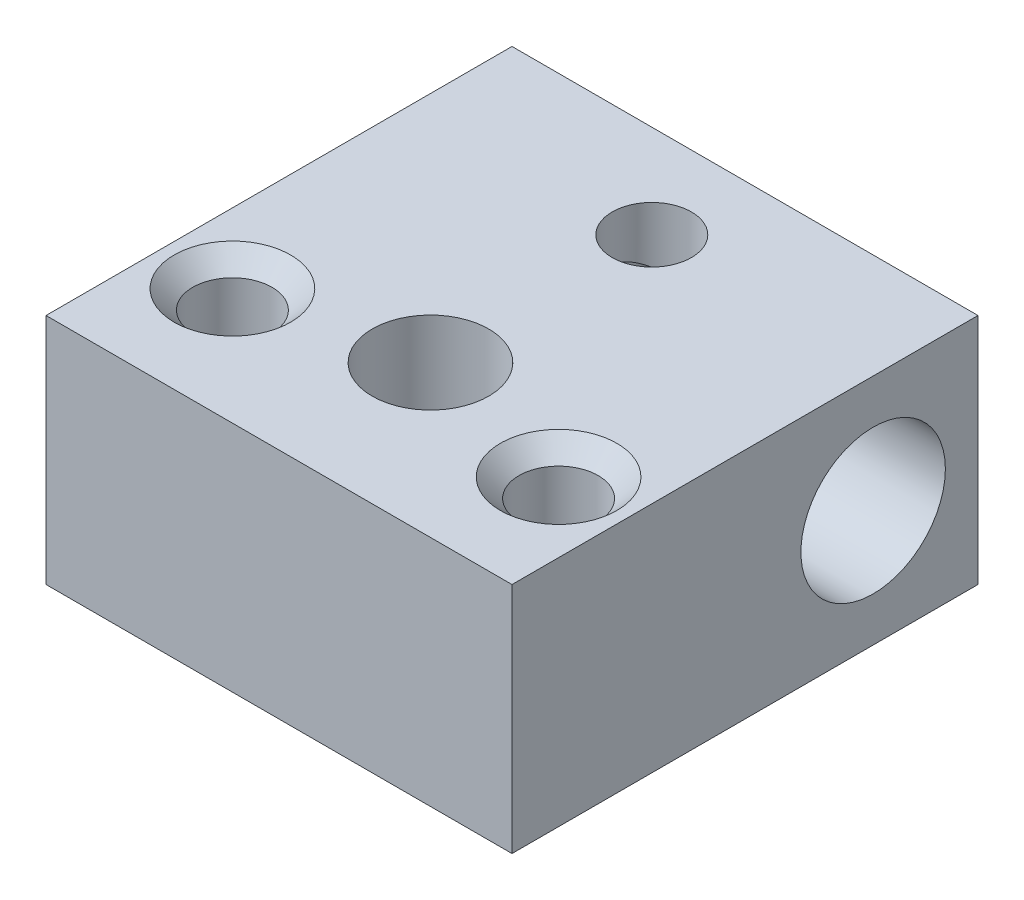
ISO-10303-21;
HEADER;
FILE_DESCRIPTION(('STEP AP214'),'2;1');
FILE_NAME('part.step','',(''),(''),'','','');
FILE_SCHEMA(('AUTOMOTIVE_DESIGN { 1 0 10303 214 1 1 1 1 }'));
ENDSEC;
DATA;
#1=APPLICATION_CONTEXT('core data for automotive mechanical design processes');
#2=APPLICATION_PROTOCOL_DEFINITION('international standard','automotive_design',2000,#1);
#3=PRODUCT_CONTEXT('',#1,'mechanical');
#4=PRODUCT('Part','Part','',(#3));
#5=PRODUCT_RELATED_PRODUCT_CATEGORY('part','',(#4));
#6=PRODUCT_DEFINITION_FORMATION('','',#4);
#7=PRODUCT_DEFINITION_CONTEXT('part definition',#1,'design');
#8=PRODUCT_DEFINITION('design','',#6,#7);
#9=PRODUCT_DEFINITION_SHAPE('','',#8);
#10=(LENGTH_UNIT() NAMED_UNIT(*) SI_UNIT(.MILLI.,.METRE.));
#11=(NAMED_UNIT(*) PLANE_ANGLE_UNIT() SI_UNIT($,.RADIAN.));
#12=(NAMED_UNIT(*) SI_UNIT($,.STERADIAN.) SOLID_ANGLE_UNIT());
#13=UNCERTAINTY_MEASURE_WITH_UNIT(LENGTH_MEASURE(1.E-05),#10,'distance_accuracy_value','');
#14=(GEOMETRIC_REPRESENTATION_CONTEXT(3) GLOBAL_UNCERTAINTY_ASSIGNED_CONTEXT((#13)) GLOBAL_UNIT_ASSIGNED_CONTEXT((#10,
#11,#12)) REPRESENTATION_CONTEXT('',''));
#15=CARTESIAN_POINT('',(0.,0.,0.));
#16=DIRECTION('',(0.,0.,1.));
#17=DIRECTION('',(1.,0.,0.));
#18=AXIS2_PLACEMENT_3D('',#15,#16,#17);
#19=CARTESIAN_POINT('',(-3.,5.,0.));
#20=DIRECTION('',(1.,0.,0.));
#21=DIRECTION('',(0.,0.,-1.));
#22=AXIS2_PLACEMENT_3D('',#19,#20,#21);
#23=PLANE('',#22);
#24=CARTESIAN_POINT('',(-3.,3.92946925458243,0.443428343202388));
#25=CARTESIAN_POINT('',(-2.99999999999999,3.91283720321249,0.420723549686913));
#26=CARTESIAN_POINT('',(-2.99999999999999,3.89705838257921,0.397395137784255));
#27=CARTESIAN_POINT('',(-3.00000000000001,3.86727811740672,0.349624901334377));
#28=CARTESIAN_POINT('',(-3.00000000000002,3.85327695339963,0.325182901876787));
#29=CARTESIAN_POINT('',(-2.99999999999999,3.82719263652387,0.275449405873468));
#30=CARTESIAN_POINT('',(-2.99999999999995,3.81510037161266,0.250162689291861));
#31=CARTESIAN_POINT('',(-3.00000000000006,3.79281495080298,0.198770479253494));
#32=CARTESIAN_POINT('',(-3.00000000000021,3.78262162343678,0.172665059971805));
#33=CARTESIAN_POINT('',(-3.00000000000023,3.76291012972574,0.116177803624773));
#34=CARTESIAN_POINT('',(-3.00000000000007,3.75367241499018,0.0856972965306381));
#35=CARTESIAN_POINT('',(-2.99999999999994,3.73780976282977,0.0240673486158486));
#36=CARTESIAN_POINT('',(-2.99999999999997,3.73118521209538,-0.00708219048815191));
#37=CARTESIAN_POINT('',(-3.00000000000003,3.72013701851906,-0.0698222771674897));
#38=CARTESIAN_POINT('',(-3.00000000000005,3.71571739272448,-0.10141352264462));
#39=CARTESIAN_POINT('',(-2.99999999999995,3.70913082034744,-0.164845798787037));
#40=CARTESIAN_POINT('',(-2.99999999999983,3.70696533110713,-0.196686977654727));
#41=CARTESIAN_POINT('',(-2.99999999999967,3.70365777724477,-0.299118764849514));
#42=CARTESIAN_POINT('',(-2.99999999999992,3.70693683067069,-0.369902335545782));
#43=CARTESIAN_POINT('',(-3.00000000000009,3.72455458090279,-0.510094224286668));
#44=CARTESIAN_POINT('',(-3.00000000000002,3.7388966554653,-0.579502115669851));
#45=CARTESIAN_POINT('',(-2.99999999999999,3.76909024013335,-0.683721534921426));
#46=CARTESIAN_POINT('',(-3.,3.7811654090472,-0.719666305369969));
#47=CARTESIAN_POINT('',(-3.00000000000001,3.80826981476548,-0.790390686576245));
#48=CARTESIAN_POINT('',(-3.,3.82329611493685,-0.825171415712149));
#49=CARTESIAN_POINT('',(-3.,3.85622151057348,-0.893397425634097));
#50=CARTESIAN_POINT('',(-3.,3.87412390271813,-0.926841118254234));
#51=CARTESIAN_POINT('',(-3.,3.90300832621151,-0.97580466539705));
#52=CARTESIAN_POINT('',(-3.,3.91297780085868,-0.991929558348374));
#53=CARTESIAN_POINT('',(-3.,3.93359397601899,-1.02374212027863));
#54=CARTESIAN_POINT('',(-3.,3.94424070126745,-1.03942977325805));
#55=CARTESIAN_POINT('',(-3.,3.96617913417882,-1.07047588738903));
#56=CARTESIAN_POINT('',(-3.,3.97747407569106,-1.08583205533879));
#57=CARTESIAN_POINT('',(-3.,4.00060917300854,-1.11612693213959));
#58=CARTESIAN_POINT('',(-3.,4.01244932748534,-1.13106564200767));
#59=CARTESIAN_POINT('',(-3.,4.04877540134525,-1.17521571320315));
#60=CARTESIAN_POINT('',(-3.,4.07407138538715,-1.20376731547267));
#61=CARTESIAN_POINT('',(-3.,4.12668953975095,-1.25896216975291));
#62=CARTESIAN_POINT('',(-3.,4.15401267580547,-1.28560450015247));
#63=CARTESIAN_POINT('',(-3.,4.21052262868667,-1.33682034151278));
#64=CARTESIAN_POINT('',(-3.,4.23970944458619,-1.36139385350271));
#65=CARTESIAN_POINT('',(-3.,4.33919030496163,-1.43911211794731));
#66=CARTESIAN_POINT('',(-3.,4.41326926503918,-1.4875368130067));
#67=CARTESIAN_POINT('',(-3.00000000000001,4.56843187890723,-1.57122815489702));
#68=CARTESIAN_POINT('',(-3.00000000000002,4.64951014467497,-1.60650481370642));
#69=CARTESIAN_POINT('',(-3.00000000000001,4.77639575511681,-1.64950506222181));
#70=CARTESIAN_POINT('',(-3.00000000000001,4.82052892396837,-1.66233761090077));
#71=CARTESIAN_POINT('',(-3.,4.90966860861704,-1.68409832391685));
#72=CARTESIAN_POINT('',(-3.,4.95467352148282,-1.69303305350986));
#73=CARTESIAN_POINT('',(-3.,5.,-1.69999999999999));
#74=B_SPLINE_CURVE_WITH_KNOTS('',3,(#24,#25,#26,#27,#28,#29,#30,#31,#32,#33,#34,#35,#36,#37,#38,
#39,#40,#41,#42,#43,#44,#45,#46,#47,#48,#49,#50,#51,#52,#53,#54,#55,#56,#57,#58,#59,#60,#61,#62,
#63,#64,#65,#66,#67,#68,#69,#70,#71,#72,#73),.UNSPECIFIED.,.F.,.F.,(4,2,2,2,2,2,2,2,2,2,2,2,2,2,
2,2,2,2,2,2,2,2,2,2,4),(0.,0.08441316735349,0.168839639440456,0.252850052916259,
0.336852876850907,0.432282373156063,0.527725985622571,0.623342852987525,0.719021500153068,
0.930658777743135,1.14236069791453,1.25600203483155,1.36953085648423,1.48319074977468,
1.54005031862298,1.59691196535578,1.65408726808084,1.71126243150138,1.82558966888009,
1.93997172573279,2.05435372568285,2.31850513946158,2.58245499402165,2.72018316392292,
2.8576784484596),.UNSPECIFIED.);
#75=CARTESIAN_POINT('',(-3.,3.92946925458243,0.443428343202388));
#76=VERTEX_POINT('',#75);
#77=CARTESIAN_POINT('',(-3.,5.,-1.7));
#78=VERTEX_POINT('',#77);
#79=EDGE_CURVE('E11',#76,#78,#74,.T.);
#80=ORIENTED_EDGE('',*,*,#79,.F.);
#81=CARTESIAN_POINT('',(-3.,5.44342834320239,1.07053074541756));
#82=CARTESIAN_POINT('',(-3.,5.41330925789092,1.08300683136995));
#83=CARTESIAN_POINT('',(-3.,5.38267651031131,1.09420508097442));
#84=CARTESIAN_POINT('',(-3.,5.32058015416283,1.11398176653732));
#85=CARTESIAN_POINT('',(-3.,5.28911663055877,1.12256046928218));
#86=CARTESIAN_POINT('',(-3.,5.19386827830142,1.14425101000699));
#87=CARTESIAN_POINT('',(-3.,5.12912668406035,1.15335815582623));
#88=CARTESIAN_POINT('',(-3.,4.99900223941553,1.16056536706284));
#89=CARTESIAN_POINT('',(-3.,4.93361909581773,1.15866014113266));
#90=CARTESIAN_POINT('',(-3.,4.83655725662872,1.14761263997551));
#91=CARTESIAN_POINT('',(-3.,4.80436841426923,1.14256412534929));
#92=CARTESIAN_POINT('',(-3.,4.74049858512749,1.12977234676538));
#93=CARTESIAN_POINT('',(-3.,4.70881811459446,1.12202650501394));
#94=CARTESIAN_POINT('',(-3.00000000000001,4.61496525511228,1.09482750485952));
#95=CARTESIAN_POINT('',(-3.,4.55389805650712,1.07140330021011));
#96=CARTESIAN_POINT('',(-3.,4.43657167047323,1.01462347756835));
#97=CARTESIAN_POINT('',(-3.,4.38031240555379,0.981268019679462));
#98=CARTESIAN_POINT('',(-3.,4.30074003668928,0.924535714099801));
#99=CARTESIAN_POINT('',(-3.,4.27499961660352,0.904489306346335));
#100=CARTESIAN_POINT('',(-3.,4.22532135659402,0.862321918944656));
#101=CARTESIAN_POINT('',(-3.,4.20138193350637,0.840202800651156));
#102=CARTESIAN_POINT('',(-3.,4.13250158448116,0.770934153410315));
#103=CARTESIAN_POINT('',(-3.,4.09044324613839,0.720833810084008));
#104=CARTESIAN_POINT('',(-3.,4.02826519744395,0.632640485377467));
#105=CARTESIAN_POINT('',(-3.,4.00556782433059,0.596320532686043));
#106=CARTESIAN_POINT('',(-3.,3.96434740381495,0.5214517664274));
#107=CARTESIAN_POINT('',(-3.,3.9458184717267,0.482906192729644));
#108=CARTESIAN_POINT('',(-3.00000000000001,3.92946925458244,0.443428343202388));
#109=B_SPLINE_CURVE_WITH_KNOTS('',3,(#81,#82,#83,#84,#85,#86,#87,#88,#89,#90,#91,#92,#93,#94,
#95,#96,#97,#98,#99,#100,#101,#102,#103,#104,#105,#106,#107,#108),.UNSPECIFIED.,.F.,.F.,(4,2,2,
2,2,2,2,2,2,2,2,2,2,4),(0.,0.0977446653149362,0.195479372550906,0.39063163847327,
0.585877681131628,0.683523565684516,0.781263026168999,0.976493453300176,1.17172073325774,
1.2694942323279,1.36718075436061,1.56235232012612,1.69060362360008,1.81867271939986),.UNSPECIFIED.);
#110=CARTESIAN_POINT('',(-3.,5.44342834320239,1.07053074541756));
#111=VERTEX_POINT('',#110);
#112=EDGE_CURVE('E46',#111,#76,#109,.T.);
#113=ORIENTED_EDGE('',*,*,#112,.F.);
#114=CARTESIAN_POINT('',(-3.,6.20208154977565,-1.2020815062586));
#115=CARTESIAN_POINT('',(-3.,6.22838384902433,-1.16622390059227));
#116=CARTESIAN_POINT('',(-3.,6.25316404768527,-1.12927340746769));
#117=CARTESIAN_POINT('',(-3.,6.2995244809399,-1.05341998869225));
#118=CARTESIAN_POINT('',(-3.,6.32110490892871,-1.01451718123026));
#119=CARTESIAN_POINT('',(-3.,6.38071653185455,-0.895425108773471));
#120=CARTESIAN_POINT('',(-3.,6.41375290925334,-0.812668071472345));
#121=CARTESIAN_POINT('',(-3.,6.46534107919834,-0.642847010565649));
#122=CARTESIAN_POINT('',(-3.,6.48390832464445,-0.555787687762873));
#123=CARTESIAN_POINT('',(-3.,6.50054077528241,-0.423832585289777));
#124=CARTESIAN_POINT('',(-3.,6.50421343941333,-0.379579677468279));
#125=CARTESIAN_POINT('',(-3.,6.50779632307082,-0.290899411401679));
#126=CARTESIAN_POINT('',(-3.,6.50770571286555,-0.246472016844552));
#127=CARTESIAN_POINT('',(-3.,6.50374326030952,-0.157938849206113));
#128=CARTESIAN_POINT('',(-3.,6.49988376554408,-0.113832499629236));
#129=CARTESIAN_POINT('',(-3.,6.48851366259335,-0.0260933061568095));
#130=CARTESIAN_POINT('',(-3.,6.48100397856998,0.0175396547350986));
#131=CARTESIAN_POINT('',(-3.,6.46176420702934,0.103803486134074));
#132=CARTESIAN_POINT('',(-3.,6.4500412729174,0.146435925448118));
#133=CARTESIAN_POINT('',(-3.,6.42252393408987,0.230349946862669));
#134=CARTESIAN_POINT('',(-3.,6.40672946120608,0.271631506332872));
#135=CARTESIAN_POINT('',(-3.,6.35640274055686,0.386048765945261));
#136=CARTESIAN_POINT('',(-3.,6.31719771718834,0.457190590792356));
#137=CARTESIAN_POINT('',(-3.,6.2265870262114,0.591422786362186));
#138=CARTESIAN_POINT('',(-3.,6.17515999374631,0.654498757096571));
#139=CARTESIAN_POINT('',(-3.,6.09195163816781,0.739617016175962));
#140=CARTESIAN_POINT('',(-3.,6.06419654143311,0.765694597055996));
#141=CARTESIAN_POINT('',(-3.,6.00655670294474,0.815403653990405));
#142=CARTESIAN_POINT('',(-3.,5.97667149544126,0.839034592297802));
#143=CARTESIAN_POINT('',(-3.,5.91512709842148,0.883672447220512));
#144=CARTESIAN_POINT('',(-3.,5.88347335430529,0.904686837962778));
#145=CARTESIAN_POINT('',(-3.,5.81823136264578,0.943445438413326));
#146=CARTESIAN_POINT('',(-3.,5.78464439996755,0.961191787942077));
#147=CARTESIAN_POINT('',(-3.,5.72601261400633,0.988543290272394));
#148=CARTESIAN_POINT('',(-3.,5.70136276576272,0.999007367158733));
#149=CARTESIAN_POINT('',(-3.,5.65138364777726,1.01817452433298));
#150=CARTESIAN_POINT('',(-3.,5.62605435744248,1.02687755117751));
#151=CARTESIAN_POINT('',(-3.,5.57474673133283,1.04250202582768));
#152=CARTESIAN_POINT('',(-3.,5.54876628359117,1.04941653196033));
#153=CARTESIAN_POINT('',(-3.,5.49638260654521,1.06138111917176));
#154=CARTESIAN_POINT('',(-3.,5.46997942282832,1.06643139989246));
#155=CARTESIAN_POINT('',(-3.,5.44342834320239,1.07053074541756));
#156=B_SPLINE_CURVE_WITH_KNOTS('',3,(#114,#115,#116,#117,#118,#119,#120,#121,#122,#123,#124,
#125,#126,#127,#128,#129,#130,#131,#132,#133,#134,#135,#136,#137,#138,#139,#140,#141,#142,#143,
#144,#145,#146,#147,#148,#149,#150,#151,#152,#153,#154,#155),.UNSPECIFIED.,.F.,.F.,(4,2,2,2,2,2,
2,2,2,2,2,2,2,2,2,2,2,2,2,2,4),(0.,0.133332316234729,0.26665657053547,0.532629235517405,
0.798317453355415,0.931399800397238,1.06451148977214,1.19718853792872,1.32983201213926,
1.46225133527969,1.59467287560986,1.83698242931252,2.07971871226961,2.19385630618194,
2.30801893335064,2.42184758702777,2.5356014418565,2.61587879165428,2.69615857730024,
2.7767454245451,2.8573236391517),.UNSPECIFIED.);
#157=CARTESIAN_POINT('',(-3.,6.20208154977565,-1.2020815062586));
#158=VERTEX_POINT('',#157);
#159=EDGE_CURVE('E117',#158,#111,#156,.T.);
#160=ORIENTED_EDGE('',*,*,#159,.F.);
#161=CARTESIAN_POINT('',(-3.,5.,0.));
#162=DIRECTION('',(-1.,0.,0.));
#163=DIRECTION('',(0.,0.,1.));
#164=AXIS2_PLACEMENT_3D('',#161,#162,#163);
#165=CIRCLE('',#164,1.7);
#166=EDGE_CURVE('E485',#158,#78,#165,.T.);
#167=ORIENTED_EDGE('',*,*,#166,.T.);
#168=EDGE_LOOP('',(#80,#113,#160,#167));
#169=FACE_BOUND('',#168,.T.);
#170=ADVANCED_FACE('F33',(#169),#23,.F.);
#171=CARTESIAN_POINT('',(0.,10.,-6.));
#172=DIRECTION('',(0.,1.,0.));
#173=DIRECTION('',(0.,0.,1.));
#174=AXIS2_PLACEMENT_3D('',#171,#172,#173);
#175=CYLINDRICAL_SURFACE('',#174,1.69999999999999);
#176=CARTESIAN_POINT('',(0.,2.1416788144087,-4.30000000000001));
#177=CARTESIAN_POINT('',(0.0920415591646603,2.14168088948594,-4.29999825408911));
#178=CARTESIAN_POINT('',(0.18407128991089,2.13849462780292,-4.30750253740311));
#179=CARTESIAN_POINT('',(0.365336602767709,2.12630854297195,-4.33718064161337));
#180=CARTESIAN_POINT('',(0.454571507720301,2.11730732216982,-4.35935798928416));
#181=CARTESIAN_POINT('',(0.627546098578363,2.09500060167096,-4.41744150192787));
#182=CARTESIAN_POINT('',(0.711301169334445,2.08170783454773,-4.45330711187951));
#183=CARTESIAN_POINT('',(0.871734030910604,2.05280212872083,-4.53770642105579));
#184=CARTESIAN_POINT('',(0.948409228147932,2.0371883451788,-4.58624473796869));
#185=CARTESIAN_POINT('',(1.09676722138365,2.00504689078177,-4.69764142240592));
#186=CARTESIAN_POINT('',(1.16799642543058,1.98851319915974,-4.76110353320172));
#187=CARTESIAN_POINT('',(1.29911192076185,1.95791981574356,-4.89937164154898));
#188=CARTESIAN_POINT('',(1.35899783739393,1.94386020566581,-4.974178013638));
#189=CARTESIAN_POINT('',(1.46590669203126,1.92065139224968,-5.13375577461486));
#190=CARTESIAN_POINT('',(1.51286589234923,1.91152631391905,-5.21857369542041));
#191=CARTESIAN_POINT('',(1.59177345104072,1.90050607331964,-5.39534745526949));
#192=CARTESIAN_POINT('',(1.62373408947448,1.89860498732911,-5.48729738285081));
#193=CARTESIAN_POINT('',(1.66939060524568,1.90330725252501,-5.6668896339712));
#194=CARTESIAN_POINT('',(1.68443459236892,1.9091844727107,-5.75420984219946));
#195=CARTESIAN_POINT('',(1.70079999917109,1.92860333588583,-5.92926723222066));
#196=CARTESIAN_POINT('',(1.70212392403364,1.94214357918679,-6.01700433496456));
#197=CARTESIAN_POINT('',(1.69178310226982,1.97578223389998,-6.18648502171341));
#198=CARTESIAN_POINT('',(1.68066870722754,1.99557703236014,-6.26832477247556));
#199=CARTESIAN_POINT('',(1.6472671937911,2.04098901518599,-6.42798165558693));
#200=CARTESIAN_POINT('',(1.62497766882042,2.06660745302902,-6.50579791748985));
#201=CARTESIAN_POINT('',(1.56819781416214,2.12470568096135,-6.66196528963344));
#202=CARTESIAN_POINT('',(1.53288132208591,2.1575680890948,-6.73987109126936));
#203=CARTESIAN_POINT('',(1.45192196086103,2.22703313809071,-6.8883025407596));
#204=CARTESIAN_POINT('',(1.40627170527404,2.26363844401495,-6.95882285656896));
#205=CARTESIAN_POINT('',(1.29788895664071,2.34465766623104,-7.10216868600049));
#206=CARTESIAN_POINT('',(1.23360222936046,2.38939845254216,-7.17363519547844));
#207=CARTESIAN_POINT('',(1.09373878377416,2.47841821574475,-7.3049700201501));
#208=CARTESIAN_POINT('',(1.01815638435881,2.52269694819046,-7.36483246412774));
#209=CARTESIAN_POINT('',(0.867697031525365,2.60101662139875,-7.46425639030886));
#210=CARTESIAN_POINT('',(0.794221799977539,2.63562094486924,-7.5054899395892));
#211=CARTESIAN_POINT('',(0.639748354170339,2.69847653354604,-7.57732203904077));
#212=CARTESIAN_POINT('',(0.558764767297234,2.72673979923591,-7.60794073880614));
#213=CARTESIAN_POINT('',(0.408350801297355,2.76817494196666,-7.65166651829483));
#214=CARTESIAN_POINT('',(0.340145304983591,2.7832805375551,-7.6671166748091));
#215=CARTESIAN_POINT('',(0.201095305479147,2.80540974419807,-7.68952727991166));
#216=CARTESIAN_POINT('',(0.130254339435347,2.81244381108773,-7.69649871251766));
#217=CARTESIAN_POINT('',(-0.0123038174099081,2.81742971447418,-7.70145474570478));
#218=CARTESIAN_POINT('',(-0.0840230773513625,2.8153526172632,-7.69941071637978));
#219=CARTESIAN_POINT('',(-0.225853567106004,2.80237347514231,-7.68643873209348));
#220=CARTESIAN_POINT('',(-0.295963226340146,2.79146315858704,-7.67550245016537));
#221=CARTESIAN_POINT('',(-0.446123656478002,2.75944622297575,-7.6425533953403));
#222=CARTESIAN_POINT('',(-0.525447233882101,2.73676626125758,-7.61879664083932));
#223=CARTESIAN_POINT('',(-0.677787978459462,2.68416944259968,-7.56117586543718));
#224=CARTESIAN_POINT('',(-0.750791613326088,2.6542375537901,-7.52729081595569));
#225=CARTESIAN_POINT('',(-0.911101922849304,2.58036553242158,-7.43896885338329));
#226=CARTESIAN_POINT('',(-0.995999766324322,2.53493450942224,-7.3814157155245));
#227=CARTESIAN_POINT('',(-1.15355305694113,2.44191701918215,-7.25286268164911));
#228=CARTESIAN_POINT('',(-1.22619736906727,2.39432864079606,-7.18185067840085));
#229=CARTESIAN_POINT('',(-1.35893229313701,2.30038518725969,-7.02656631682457));
#230=CARTESIAN_POINT('',(-1.4188819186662,2.25404849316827,-6.94216158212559));
#231=CARTESIAN_POINT('',(-1.52327712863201,2.16668180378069,-6.76186314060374));
#232=CARTESIAN_POINT('',(-1.56774832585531,2.12564311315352,-6.66598876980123));
#233=CARTESIAN_POINT('',(-1.63157586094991,2.059403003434,-6.4850033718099));
#234=CARTESIAN_POINT('',(-1.6541820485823,2.03267615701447,-6.40159637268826));
#235=CARTESIAN_POINT('',(-1.68654670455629,1.98599467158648,-6.23048860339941));
#236=CARTESIAN_POINT('',(-1.69631336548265,1.9660357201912,-6.14279060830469));
#237=CARTESIAN_POINT('',(-1.70197189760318,1.93376721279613,-5.96517863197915));
#238=CARTESIAN_POINT('',(-1.69781076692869,1.92148708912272,-5.87525748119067));
#239=CARTESIAN_POINT('',(-1.67511124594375,1.904932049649,-5.69649364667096));
#240=CARTESIAN_POINT('',(-1.65657371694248,1.90065665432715,-5.60765089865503));
#241=CARTESIAN_POINT('',(-1.60722349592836,1.89952133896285,-5.4396369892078));
#242=CARTESIAN_POINT('',(-1.57727663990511,1.90220232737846,-5.36021125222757));
#243=CARTESIAN_POINT('',(-1.50608664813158,1.91292113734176,-5.20700445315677));
#244=CARTESIAN_POINT('',(-1.46484201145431,1.9209596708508,-5.13322414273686));
#245=CARTESIAN_POINT('',(-1.37022567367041,1.94135191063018,-4.98996894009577));
#246=CARTESIAN_POINT('',(-1.31641291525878,1.95387455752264,-4.92081048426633));
#247=CARTESIAN_POINT('',(-1.19909641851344,1.98125995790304,-4.79178644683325));
#248=CARTESIAN_POINT('',(-1.13558769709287,1.99612391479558,-4.73192567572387));
#249=CARTESIAN_POINT('',(-0.994182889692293,2.02754719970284,-4.61776555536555));
#250=CARTESIAN_POINT('',(-0.915509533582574,2.04413972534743,-4.56443452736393));
#251=CARTESIAN_POINT('',(-0.750044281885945,2.07518994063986,-4.47145844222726));
#252=CARTESIAN_POINT('',(-0.663251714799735,2.08964745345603,-4.43181451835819));
#253=CARTESIAN_POINT('',(-0.48212572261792,2.11428295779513,-4.36691810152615));
#254=CARTESIAN_POINT('',(-0.387689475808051,2.12438432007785,-4.34192072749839));
#255=CARTESIAN_POINT('',(-0.195496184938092,2.13807895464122,-4.3084681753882));
#256=CARTESIAN_POINT('',(-0.0977414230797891,2.14167661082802,-4.30000185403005));
#257=CARTESIAN_POINT('',(0.,2.1416788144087,-4.30000000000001));
#258=B_SPLINE_CURVE_WITH_KNOTS('',3,(#176,#177,#178,#179,#180,#181,#182,#183,#184,#185,#186,
#187,#188,#189,#190,#191,#192,#193,#194,#195,#196,#197,#198,#199,#200,#201,#202,#203,#204,#205,
#206,#207,#208,#209,#210,#211,#212,#213,#214,#215,#216,#217,#218,#219,#220,#221,#222,#223,#224,
#225,#226,#227,#228,#229,#230,#231,#232,#233,#234,#235,#236,#237,#238,#239,#240,#241,#242,#243,
#244,#245,#246,#247,#248,#249,#250,#251,#252,#253,#254,#255,#256,#257),.UNSPECIFIED.,.T.,.F.,(4,
2,2,2,2,2,2,2,2,2,2,2,2,2,2,2,2,2,2,2,2,2,2,2,2,2,2,2,2,2,2,2,2,2,2,2,2,2,2,2,4),(0.,
0.275756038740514,0.551578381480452,0.826589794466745,1.10170155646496,1.39083429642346,
1.67997658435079,1.97051999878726,2.26082511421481,2.52585115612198,2.79082880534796,
3.04452999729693,3.29828584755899,3.57212958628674,3.84616968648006,4.16299387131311,
4.47997794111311,4.75228977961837,5.02408183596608,5.23784536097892,5.45133166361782,
5.66549641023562,5.8798619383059,6.1360261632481,6.39272598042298,6.72754994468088,
7.06267654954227,7.40134966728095,7.73945967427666,8.00968217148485,8.27973216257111,
8.55081098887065,8.82187357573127,9.07550869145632,9.32917751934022,9.59363183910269,
9.85822253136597,10.1463486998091,10.4344987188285,10.7275291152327,11.0203619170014),.UNSPECIFIED.);
#259=CARTESIAN_POINT('',(0.,2.1416788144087,-4.30000000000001));
#260=VERTEX_POINT('',#259);
#261=EDGE_CURVE('E172',#260,#260,#258,.T.);
#262=ORIENTED_EDGE('',*,*,#261,.T.);
#263=EDGE_LOOP('',(#262));
#264=FACE_BOUND('',#263,.T.);
#265=CARTESIAN_POINT('',(0.,0.,-6.));
#266=DIRECTION('',(0.,1.,0.));
#267=DIRECTION('',(0.,0.,1.));
#268=AXIS2_PLACEMENT_3D('',#265,#266,#267);
#269=CIRCLE('',#268,1.69999999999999);
#270=CARTESIAN_POINT('',(0.,0.,-4.30000000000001));
#271=VERTEX_POINT('',#270);
#272=EDGE_CURVE('E216',#271,#271,#269,.T.);
#273=ORIENTED_EDGE('',*,*,#272,.F.);
#274=EDGE_LOOP('',(#273));
#275=FACE_BOUND('',#274,.T.);
#276=ADVANCED_FACE('F199',(#264,#275),#175,.F.);
#277=CARTESIAN_POINT('',(10.,10.,10.));
#278=DIRECTION('',(-1.,0.,0.));
#279=DIRECTION('',(0.,0.,1.));
#280=AXIS2_PLACEMENT_3D('',#277,#278,#279);
#281=PLANE('',#280);
#282=CARTESIAN_POINT('',(10.,5.,-5.5));
#283=DIRECTION('',(1.,0.,0.));
#284=DIRECTION('',(0.,0.,-1.));
#285=AXIS2_PLACEMENT_3D('',#282,#283,#284);
#286=CIRCLE('',#285,3.1);
#287=CARTESIAN_POINT('',(10.,5.,-8.6));
#288=VERTEX_POINT('',#287);
#289=EDGE_CURVE('E488',#288,#288,#286,.T.);
#290=ORIENTED_EDGE('',*,*,#289,.F.);
#291=EDGE_LOOP('',(#290));
#292=FACE_BOUND('',#291,.T.);
#293=DIRECTION('',(0.,0.,-1.));
#294=VECTOR('',#293,1.);
#295=CARTESIAN_POINT('',(10.,0.,10.));
#296=LINE('',#295,#294);
#297=CARTESIAN_POINT('',(10.,0.,10.));
#298=VERTEX_POINT('',#297);
#299=CARTESIAN_POINT('',(10.,0.,-10.));
#300=VERTEX_POINT('',#299);
#301=EDGE_CURVE('E247',#298,#300,#296,.T.);
#302=ORIENTED_EDGE('',*,*,#301,.T.);
#303=DIRECTION('',(0.,-1.,0.));
#304=VECTOR('',#303,1.);
#305=CARTESIAN_POINT('',(10.,10.,-10.));
#306=LINE('',#305,#304);
#307=CARTESIAN_POINT('',(10.,10.,-10.));
#308=VERTEX_POINT('',#307);
#309=EDGE_CURVE('E171',#308,#300,#306,.T.);
#310=ORIENTED_EDGE('',*,*,#309,.F.);
#311=DIRECTION('',(0.,0.,-1.));
#312=VECTOR('',#311,1.);
#313=CARTESIAN_POINT('',(10.,10.,10.));
#314=LINE('',#313,#312);
#315=CARTESIAN_POINT('',(10.,10.,10.));
#316=VERTEX_POINT('',#315);
#317=EDGE_CURVE('E248',#316,#308,#314,.T.);
#318=ORIENTED_EDGE('',*,*,#317,.F.);
#319=DIRECTION('',(0.,-1.,0.));
#320=VECTOR('',#319,1.);
#321=CARTESIAN_POINT('',(10.,10.,10.));
#322=LINE('',#321,#320);
#323=EDGE_CURVE('E258',#316,#298,#322,.T.);
#324=ORIENTED_EDGE('',*,*,#323,.T.);
#325=EDGE_LOOP('',(#302,#310,#318,#324));
#326=FACE_BOUND('',#325,.T.);
#327=ADVANCED_FACE('F35',(#292,#326),#281,.F.);
#328=CARTESIAN_POINT('',(-10.,10.,-10.));
#329=DIRECTION('',(0.,0.,1.));
#330=DIRECTION('',(1.,0.,0.));
#331=AXIS2_PLACEMENT_3D('',#328,#329,#330);
#332=PLANE('',#331);
#333=DIRECTION('',(-1.,0.,0.));
#334=VECTOR('',#333,1.);
#335=CARTESIAN_POINT('',(-10.,0.,-10.));
#336=LINE('',#335,#334);
#337=CARTESIAN_POINT('',(-10.,0.,-10.));
#338=VERTEX_POINT('',#337);
#339=EDGE_CURVE('E261',#300,#338,#336,.T.);
#340=ORIENTED_EDGE('',*,*,#339,.T.);
#341=DIRECTION('',(0.,-1.,0.));
#342=VECTOR('',#341,1.);
#343=CARTESIAN_POINT('',(-10.,10.,-10.));
#344=LINE('',#343,#342);
#345=CARTESIAN_POINT('',(-10.,10.,-10.));
#346=VERTEX_POINT('',#345);
#347=EDGE_CURVE('E271',#346,#338,#344,.T.);
#348=ORIENTED_EDGE('',*,*,#347,.F.);
#349=DIRECTION('',(-1.,0.,0.));
#350=VECTOR('',#349,1.);
#351=CARTESIAN_POINT('',(-10.,10.,-10.));
#352=LINE('',#351,#350);
#353=EDGE_CURVE('E251',#308,#346,#352,.T.);
#354=ORIENTED_EDGE('',*,*,#353,.F.);
#355=ORIENTED_EDGE('',*,*,#309,.T.);
#356=EDGE_LOOP('',(#340,#348,#354,#355));
#357=FACE_BOUND('',#356,.T.);
#358=ADVANCED_FACE('F210',(#357),#332,.F.);
#359=CARTESIAN_POINT('',(-10.,10.,10.));
#360=DIRECTION('',(1.,0.,0.));
#361=DIRECTION('',(0.,0.,-1.));
#362=AXIS2_PLACEMENT_3D('',#359,#360,#361);
#363=PLANE('',#362);
#364=CARTESIAN_POINT('',(-10.,7.75,-1.5));
#365=DIRECTION('',(-1.,0.,0.));
#366=DIRECTION('',(0.,0.,1.));
#367=AXIS2_PLACEMENT_3D('',#364,#365,#366);
#368=CIRCLE('',#367,0.9);
#369=CARTESIAN_POINT('',(-10.,7.75,-0.6));
#370=VERTEX_POINT('',#369);
#371=EDGE_CURVE('E135',#370,#370,#368,.T.);
#372=ORIENTED_EDGE('',*,*,#371,.F.);
#373=EDGE_LOOP('',(#372));
#374=FACE_BOUND('',#373,.T.);
#375=CARTESIAN_POINT('',(-10.,5.,0.));
#376=DIRECTION('',(-1.,0.,0.));
#377=DIRECTION('',(0.,0.,1.));
#378=AXIS2_PLACEMENT_3D('',#375,#376,#377);
#379=CIRCLE('',#378,1.69999999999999);
#380=CARTESIAN_POINT('',(-10.,5.,-1.69999999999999));
#381=VERTEX_POINT('',#380);
#382=EDGE_CURVE('E487',#381,#381,#379,.T.);
#383=ORIENTED_EDGE('',*,*,#382,.F.);
#384=EDGE_LOOP('',(#383));
#385=FACE_BOUND('',#384,.T.);
#386=CARTESIAN_POINT('',(-10.,5.,-5.5));
#387=DIRECTION('',(1.,0.,0.));
#388=DIRECTION('',(0.,0.,-1.));
#389=AXIS2_PLACEMENT_3D('',#386,#387,#388);
#390=CIRCLE('',#389,3.1);
#391=CARTESIAN_POINT('',(-10.,5.,-8.6));
#392=VERTEX_POINT('',#391);
#393=EDGE_CURVE('E491',#392,#392,#390,.T.);
#394=ORIENTED_EDGE('',*,*,#393,.T.);
#395=EDGE_LOOP('',(#394));
#396=FACE_BOUND('',#395,.T.);
#397=DIRECTION('',(0.,0.,1.));
#398=VECTOR('',#397,1.);
#399=CARTESIAN_POINT('',(-10.,0.,10.));
#400=LINE('',#399,#398);
#401=CARTESIAN_POINT('',(-10.,0.,10.));
#402=VERTEX_POINT('',#401);
#403=EDGE_CURVE('E263',#338,#402,#400,.T.);
#404=ORIENTED_EDGE('',*,*,#403,.T.);
#405=DIRECTION('',(0.,-1.,0.));
#406=VECTOR('',#405,1.);
#407=CARTESIAN_POINT('',(-10.,10.,10.));
#408=LINE('',#407,#406);
#409=CARTESIAN_POINT('',(-10.,10.,10.));
#410=VERTEX_POINT('',#409);
#411=EDGE_CURVE('E268',#410,#402,#408,.T.);
#412=ORIENTED_EDGE('',*,*,#411,.F.);
#413=DIRECTION('',(0.,0.,1.));
#414=VECTOR('',#413,1.);
#415=CARTESIAN_POINT('',(-10.,10.,10.));
#416=LINE('',#415,#414);
#417=EDGE_CURVE('E254',#346,#410,#416,.T.);
#418=ORIENTED_EDGE('',*,*,#417,.F.);
#419=ORIENTED_EDGE('',*,*,#347,.T.);
#420=EDGE_LOOP('',(#404,#412,#418,#419));
#421=FACE_BOUND('',#420,.T.);
#422=ADVANCED_FACE('F287',(#374,#385,#396,#421),#363,.F.);
#423=CARTESIAN_POINT('',(-10.,10.,10.));
#424=DIRECTION('',(0.,0.,-1.));
#425=DIRECTION('',(-1.,0.,0.));
#426=AXIS2_PLACEMENT_3D('',#423,#424,#425);
#427=PLANE('',#426);
#428=DIRECTION('',(1.,0.,0.));
#429=VECTOR('',#428,1.);
#430=CARTESIAN_POINT('',(-10.,0.,10.));
#431=LINE('',#430,#429);
#432=EDGE_CURVE('E252',#402,#298,#431,.T.);
#433=ORIENTED_EDGE('',*,*,#432,.T.);
#434=ORIENTED_EDGE('',*,*,#323,.F.);
#435=DIRECTION('',(1.,0.,0.));
#436=VECTOR('',#435,1.);
#437=CARTESIAN_POINT('',(-10.,10.,10.));
#438=LINE('',#437,#436);
#439=EDGE_CURVE('E256',#410,#316,#438,.T.);
#440=ORIENTED_EDGE('',*,*,#439,.F.);
#441=ORIENTED_EDGE('',*,*,#411,.T.);
#442=EDGE_LOOP('',(#433,#434,#440,#441));
#443=FACE_BOUND('',#442,.T.);
#444=ADVANCED_FACE('F291',(#443),#427,.F.);
#445=CARTESIAN_POINT('',(0.,10.,0.));
#446=DIRECTION('',(0.,-1.,0.));
#447=DIRECTION('',(0.,0.,-1.));
#448=AXIS2_PLACEMENT_3D('',#445,#446,#447);
#449=PLANE('',#448);
#450=CARTESIAN_POINT('',(0.,10.,-6.));
#451=DIRECTION('',(0.,1.,0.));
#452=DIRECTION('',(0.,0.,1.));
#453=AXIS2_PLACEMENT_3D('',#450,#451,#452);
#454=CIRCLE('',#453,1.69999999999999);
#455=CARTESIAN_POINT('',(0.,10.,-4.30000000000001));
#456=VERTEX_POINT('',#455);
#457=EDGE_CURVE('E178',#456,#456,#454,.T.);
#458=ORIENTED_EDGE('',*,*,#457,.F.);
#459=EDGE_LOOP('',(#458));
#460=FACE_BOUND('',#459,.T.);
#461=CARTESIAN_POINT('',(-7.,10.,5.));
#462=DIRECTION('',(0.,1.,0.));
#463=DIRECTION('',(0.,0.,1.));
#464=AXIS2_PLACEMENT_3D('',#461,#462,#463);
#465=CIRCLE('',#464,2.5);
#466=CARTESIAN_POINT('',(-7.,10.,7.5));
#467=VERTEX_POINT('',#466);
#468=EDGE_CURVE('E218',#467,#467,#465,.T.);
#469=ORIENTED_EDGE('',*,*,#468,.F.);
#470=EDGE_LOOP('',(#469));
#471=FACE_BOUND('',#470,.T.);
#472=CARTESIAN_POINT('',(7.,10.,5.));
#473=DIRECTION('',(0.,1.,0.));
#474=DIRECTION('',(0.,0.,1.));
#475=AXIS2_PLACEMENT_3D('',#472,#473,#474);
#476=CIRCLE('',#475,2.5);
#477=CARTESIAN_POINT('',(7.,10.,7.5));
#478=VERTEX_POINT('',#477);
#479=EDGE_CURVE('E232',#478,#478,#476,.T.);
#480=ORIENTED_EDGE('',*,*,#479,.F.);
#481=EDGE_LOOP('',(#480));
#482=FACE_BOUND('',#481,.T.);
#483=CARTESIAN_POINT('',(0.,10.,3.5));
#484=DIRECTION('',(0.,1.,0.));
#485=DIRECTION('',(0.,0.,1.));
#486=AXIS2_PLACEMENT_3D('',#483,#484,#485);
#487=CIRCLE('',#486,2.5);
#488=CARTESIAN_POINT('',(0.,10.,6.));
#489=VERTEX_POINT('',#488);
#490=EDGE_CURVE('E241',#489,#489,#487,.T.);
#491=ORIENTED_EDGE('',*,*,#490,.F.);
#492=EDGE_LOOP('',(#491));
#493=FACE_BOUND('',#492,.T.);
#494=ORIENTED_EDGE('',*,*,#317,.T.);
#495=ORIENTED_EDGE('',*,*,#353,.T.);
#496=ORIENTED_EDGE('',*,*,#417,.T.);
#497=ORIENTED_EDGE('',*,*,#439,.T.);
#498=EDGE_LOOP('',(#494,#495,#496,#497));
#499=FACE_BOUND('',#498,.T.);
#500=ADVANCED_FACE('F293',(#460,#471,#482,#493,#499),#449,.F.);
#501=CARTESIAN_POINT('',(0.,0.,0.));
#502=DIRECTION('',(0.,-1.,0.));
#503=DIRECTION('',(0.,0.,-1.));
#504=AXIS2_PLACEMENT_3D('',#501,#502,#503);
#505=PLANE('',#504);
#506=ORIENTED_EDGE('',*,*,#272,.T.);
#507=EDGE_LOOP('',(#506));
#508=FACE_BOUND('',#507,.T.);
#509=CARTESIAN_POINT('',(-7.,0.,5.));
#510=DIRECTION('',(0.,1.,0.));
#511=DIRECTION('',(0.,0.,1.));
#512=AXIS2_PLACEMENT_3D('',#509,#510,#511);
#513=CIRCLE('',#512,1.7);
#514=CARTESIAN_POINT('',(-7.,0.,6.7));
#515=VERTEX_POINT('',#514);
#516=EDGE_CURVE('E229',#515,#515,#513,.T.);
#517=ORIENTED_EDGE('',*,*,#516,.T.);
#518=EDGE_LOOP('',(#517));
#519=FACE_BOUND('',#518,.T.);
#520=CARTESIAN_POINT('',(7.,0.,5.));
#521=DIRECTION('',(0.,1.,0.));
#522=DIRECTION('',(0.,0.,1.));
#523=AXIS2_PLACEMENT_3D('',#520,#521,#522);
#524=CIRCLE('',#523,1.7);
#525=CARTESIAN_POINT('',(7.,0.,6.7));
#526=VERTEX_POINT('',#525);
#527=EDGE_CURVE('E238',#526,#526,#524,.T.);
#528=ORIENTED_EDGE('',*,*,#527,.T.);
#529=EDGE_LOOP('',(#528));
#530=FACE_BOUND('',#529,.T.);
#531=CARTESIAN_POINT('',(0.,0.,3.5));
#532=DIRECTION('',(0.,1.,0.));
#533=DIRECTION('',(0.,0.,1.));
#534=AXIS2_PLACEMENT_3D('',#531,#532,#533);
#535=CIRCLE('',#534,2.5);
#536=CARTESIAN_POINT('',(0.,0.,6.));
#537=VERTEX_POINT('',#536);
#538=EDGE_CURVE('E244',#537,#537,#535,.T.);
#539=ORIENTED_EDGE('',*,*,#538,.T.);
#540=EDGE_LOOP('',(#539));
#541=FACE_BOUND('',#540,.T.);
#542=ORIENTED_EDGE('',*,*,#301,.F.);
#543=ORIENTED_EDGE('',*,*,#432,.F.);
#544=ORIENTED_EDGE('',*,*,#403,.F.);
#545=ORIENTED_EDGE('',*,*,#339,.F.);
#546=EDGE_LOOP('',(#542,#543,#544,#545));
#547=FACE_BOUND('',#546,.T.);
#548=ADVANCED_FACE('F283',(#508,#519,#530,#541,#547),#505,.T.);
#549=CARTESIAN_POINT('',(0.,10.,3.5));
#550=DIRECTION('',(0.,1.,0.));
#551=DIRECTION('',(0.,0.,1.));
#552=AXIS2_PLACEMENT_3D('',#549,#550,#551);
#553=CYLINDRICAL_SURFACE('',#552,2.5);
#554=ORIENTED_EDGE('',*,*,#538,.F.);
#555=EDGE_LOOP('',(#554));
#556=FACE_BOUND('',#555,.T.);
#557=ORIENTED_EDGE('',*,*,#490,.T.);
#558=EDGE_LOOP('',(#557));
#559=FACE_BOUND('',#558,.T.);
#560=ADVANCED_FACE('F301',(#556,#559),#553,.F.);
#561=CARTESIAN_POINT('',(7.,10.,5.));
#562=DIRECTION('',(0.,1.,0.));
#563=DIRECTION('',(0.,0.,1.));
#564=AXIS2_PLACEMENT_3D('',#561,#562,#563);
#565=CYLINDRICAL_SURFACE('',#564,1.7);
#566=ORIENTED_EDGE('',*,*,#527,.F.);
#567=EDGE_LOOP('',(#566));
#568=FACE_BOUND('',#567,.T.);
#569=CARTESIAN_POINT('',(7.,9.2,5.));
#570=DIRECTION('',(0.,1.,0.));
#571=DIRECTION('',(0.,0.,1.));
#572=AXIS2_PLACEMENT_3D('',#569,#570,#571);
#573=CIRCLE('',#572,1.7);
#574=CARTESIAN_POINT('',(7.,9.2,6.7));
#575=VERTEX_POINT('',#574);
#576=EDGE_CURVE('E235',#575,#575,#573,.T.);
#577=ORIENTED_EDGE('',*,*,#576,.T.);
#578=EDGE_LOOP('',(#577));
#579=FACE_BOUND('',#578,.T.);
#580=ADVANCED_FACE('F335',(#568,#579),#565,.F.);
#581=CARTESIAN_POINT('',(7.,10.,5.));
#582=DIRECTION('',(0.,1.,0.));
#583=DIRECTION('',(0.,0.,1.));
#584=AXIS2_PLACEMENT_3D('',#581,#582,#583);
#585=CONICAL_SURFACE('',#584,2.5,0.785398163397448);
#586=ORIENTED_EDGE('',*,*,#576,.F.);
#587=EDGE_LOOP('',(#586));
#588=FACE_BOUND('',#587,.T.);
#589=ORIENTED_EDGE('',*,*,#479,.T.);
#590=EDGE_LOOP('',(#589));
#591=FACE_BOUND('',#590,.T.);
#592=ADVANCED_FACE('F345',(#588,#591),#585,.F.);
#593=CARTESIAN_POINT('',(-7.,10.,5.));
#594=DIRECTION('',(0.,1.,0.));
#595=DIRECTION('',(0.,0.,1.));
#596=AXIS2_PLACEMENT_3D('',#593,#594,#595);
#597=CYLINDRICAL_SURFACE('',#596,1.7);
#598=ORIENTED_EDGE('',*,*,#516,.F.);
#599=EDGE_LOOP('',(#598));
#600=FACE_BOUND('',#599,.T.);
#601=CARTESIAN_POINT('',(-7.,9.2,5.));
#602=DIRECTION('',(0.,1.,0.));
#603=DIRECTION('',(0.,0.,1.));
#604=AXIS2_PLACEMENT_3D('',#601,#602,#603);
#605=CIRCLE('',#604,1.7);
#606=CARTESIAN_POINT('',(-7.,9.2,6.7));
#607=VERTEX_POINT('',#606);
#608=EDGE_CURVE('E221',#607,#607,#605,.T.);
#609=ORIENTED_EDGE('',*,*,#608,.T.);
#610=EDGE_LOOP('',(#609));
#611=FACE_BOUND('',#610,.T.);
#612=ADVANCED_FACE('F354',(#600,#611),#597,.F.);
#613=CARTESIAN_POINT('',(-7.,10.,5.));
#614=DIRECTION('',(0.,1.,0.));
#615=DIRECTION('',(0.,0.,1.));
#616=AXIS2_PLACEMENT_3D('',#613,#614,#615);
#617=CONICAL_SURFACE('',#616,2.5,0.785398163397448);
#618=ORIENTED_EDGE('',*,*,#608,.F.);
#619=EDGE_LOOP('',(#618));
#620=FACE_BOUND('',#619,.T.);
#621=ORIENTED_EDGE('',*,*,#468,.T.);
#622=EDGE_LOOP('',(#621));
#623=FACE_BOUND('',#622,.T.);
#624=ADVANCED_FACE('F197',(#620,#623),#617,.F.);
#625=CARTESIAN_POINT('',(0.,7.8583211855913,-4.30000000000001));
#626=CARTESIAN_POINT('',(-0.0920415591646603,7.85831911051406,-4.29999825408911));
#627=CARTESIAN_POINT('',(-0.184071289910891,7.86150537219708,-4.30750253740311));
#628=CARTESIAN_POINT('',(-0.365336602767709,7.87369145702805,-4.33718064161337));
#629=CARTESIAN_POINT('',(-0.454571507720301,7.88269267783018,-4.35935798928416));
#630=CARTESIAN_POINT('',(-0.627546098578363,7.90499939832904,-4.41744150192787));
#631=CARTESIAN_POINT('',(-0.711301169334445,7.91829216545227,-4.45330711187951));
#632=CARTESIAN_POINT('',(-0.871734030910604,7.94719787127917,-4.53770642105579));
#633=CARTESIAN_POINT('',(-0.948409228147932,7.9628116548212,-4.58624473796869));
#634=CARTESIAN_POINT('',(-1.09676722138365,7.99495310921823,-4.69764142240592));
#635=CARTESIAN_POINT('',(-1.16799642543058,8.01148680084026,-4.76110353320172));
#636=CARTESIAN_POINT('',(-1.29911192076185,8.04208018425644,-4.89937164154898));
#637=CARTESIAN_POINT('',(-1.35899783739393,8.05613979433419,-4.974178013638));
#638=CARTESIAN_POINT('',(-1.46590669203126,8.07934860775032,-5.13375577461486));
#639=CARTESIAN_POINT('',(-1.51286589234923,8.08847368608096,-5.21857369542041));
#640=CARTESIAN_POINT('',(-1.59177345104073,8.09949392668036,-5.39534745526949));
#641=CARTESIAN_POINT('',(-1.62373408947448,8.10139501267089,-5.48729738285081));
#642=CARTESIAN_POINT('',(-1.66939060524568,8.09669274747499,-5.66688963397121));
#643=CARTESIAN_POINT('',(-1.68443459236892,8.0908155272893,-5.75420984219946));
#644=CARTESIAN_POINT('',(-1.70079999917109,8.07139666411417,-5.92926723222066));
#645=CARTESIAN_POINT('',(-1.70212392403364,8.05785642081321,-6.01700433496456));
#646=CARTESIAN_POINT('',(-1.69178310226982,8.02421776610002,-6.18648502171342));
#647=CARTESIAN_POINT('',(-1.68066870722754,8.00442296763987,-6.26832477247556));
#648=CARTESIAN_POINT('',(-1.6472671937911,7.95901098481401,-6.42798165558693));
#649=CARTESIAN_POINT('',(-1.62497766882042,7.93339254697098,-6.50579791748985));
#650=CARTESIAN_POINT('',(-1.56819781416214,7.87529431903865,-6.66196528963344));
#651=CARTESIAN_POINT('',(-1.53288132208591,7.8424319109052,-6.73987109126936));
#652=CARTESIAN_POINT('',(-1.45192196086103,7.77296686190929,-6.8883025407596));
#653=CARTESIAN_POINT('',(-1.40627170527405,7.73636155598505,-6.95882285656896));
#654=CARTESIAN_POINT('',(-1.29788895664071,7.65534233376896,-7.10216868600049));
#655=CARTESIAN_POINT('',(-1.23360222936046,7.61060154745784,-7.17363519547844));
#656=CARTESIAN_POINT('',(-1.09373878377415,7.52158178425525,-7.3049700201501));
#657=CARTESIAN_POINT('',(-1.01815638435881,7.47730305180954,-7.36483246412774));
#658=CARTESIAN_POINT('',(-0.867697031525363,7.39898337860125,-7.46425639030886));
#659=CARTESIAN_POINT('',(-0.794221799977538,7.36437905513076,-7.5054899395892));
#660=CARTESIAN_POINT('',(-0.639748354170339,7.30152346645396,-7.57732203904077));
#661=CARTESIAN_POINT('',(-0.558764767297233,7.27326020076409,-7.60794073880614));
#662=CARTESIAN_POINT('',(-0.408350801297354,7.23182505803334,-7.65166651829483));
#663=CARTESIAN_POINT('',(-0.34014530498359,7.2167194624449,-7.6671166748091));
#664=CARTESIAN_POINT('',(-0.201095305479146,7.19459025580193,-7.68952727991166));
#665=CARTESIAN_POINT('',(-0.130254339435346,7.18755618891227,-7.69649871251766));
#666=CARTESIAN_POINT('',(0.0123038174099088,7.18257028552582,-7.70145474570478));
#667=CARTESIAN_POINT('',(0.0840230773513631,7.1846473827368,-7.69941071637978));
#668=CARTESIAN_POINT('',(0.225853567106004,7.19762652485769,-7.68643873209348));
#669=CARTESIAN_POINT('',(0.295963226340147,7.20853684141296,-7.67550245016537));
#670=CARTESIAN_POINT('',(0.446123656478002,7.24055377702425,-7.6425533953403));
#671=CARTESIAN_POINT('',(0.525447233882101,7.26323373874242,-7.61879664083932));
#672=CARTESIAN_POINT('',(0.677787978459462,7.31583055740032,-7.56117586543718));
#673=CARTESIAN_POINT('',(0.750791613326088,7.3457624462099,-7.52729081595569));
#674=CARTESIAN_POINT('',(0.911101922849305,7.41963446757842,-7.43896885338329));
#675=CARTESIAN_POINT('',(0.995999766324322,7.46506549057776,-7.3814157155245));
#676=CARTESIAN_POINT('',(1.15355305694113,7.55808298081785,-7.25286268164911));
#677=CARTESIAN_POINT('',(1.22619736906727,7.60567135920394,-7.18185067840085));
#678=CARTESIAN_POINT('',(1.35893229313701,7.69961481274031,-7.02656631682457));
#679=CARTESIAN_POINT('',(1.4188819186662,7.74595150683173,-6.94216158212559));
#680=CARTESIAN_POINT('',(1.52327712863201,7.83331819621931,-6.76186314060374));
#681=CARTESIAN_POINT('',(1.56774832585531,7.87435688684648,-6.66598876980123));
#682=CARTESIAN_POINT('',(1.63157586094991,7.940596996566,-6.4850033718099));
#683=CARTESIAN_POINT('',(1.6541820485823,7.96732384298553,-6.40159637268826));
#684=CARTESIAN_POINT('',(1.68654670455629,8.01400532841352,-6.23048860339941));
#685=CARTESIAN_POINT('',(1.69631336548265,8.0339642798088,-6.14279060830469));
#686=CARTESIAN_POINT('',(1.70197189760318,8.06623278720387,-5.96517863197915));
#687=CARTESIAN_POINT('',(1.69781076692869,8.07851291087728,-5.87525748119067));
#688=CARTESIAN_POINT('',(1.67511124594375,8.095067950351,-5.69649364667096));
#689=CARTESIAN_POINT('',(1.65657371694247,8.09934334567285,-5.60765089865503));
#690=CARTESIAN_POINT('',(1.60722349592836,8.10047866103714,-5.4396369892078));
#691=CARTESIAN_POINT('',(1.57727663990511,8.09779767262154,-5.36021125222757));
#692=CARTESIAN_POINT('',(1.50608664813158,8.08707886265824,-5.20700445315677));
#693=CARTESIAN_POINT('',(1.46484201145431,8.0790403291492,-5.13322414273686));
#694=CARTESIAN_POINT('',(1.37022567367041,8.05864808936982,-4.98996894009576));
#695=CARTESIAN_POINT('',(1.31641291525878,8.04612544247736,-4.92081048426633));
#696=CARTESIAN_POINT('',(1.19909641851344,8.01874004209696,-4.79178644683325));
#697=CARTESIAN_POINT('',(1.13558769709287,8.00387608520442,-4.73192567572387));
#698=CARTESIAN_POINT('',(0.994182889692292,7.97245280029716,-4.61776555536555));
#699=CARTESIAN_POINT('',(0.915509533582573,7.95586027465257,-4.56443452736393));
#700=CARTESIAN_POINT('',(0.750044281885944,7.92481005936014,-4.47145844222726));
#701=CARTESIAN_POINT('',(0.663251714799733,7.91035254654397,-4.43181451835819));
#702=CARTESIAN_POINT('',(0.482125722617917,7.88571704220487,-4.36691810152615));
#703=CARTESIAN_POINT('',(0.387689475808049,7.87561567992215,-4.34192072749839));
#704=CARTESIAN_POINT('',(0.19549618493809,7.86192104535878,-4.3084681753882));
#705=CARTESIAN_POINT('',(0.0977414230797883,7.85832338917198,-4.30000185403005));
#706=CARTESIAN_POINT('',(0.,7.8583211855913,-4.30000000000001));
#707=B_SPLINE_CURVE_WITH_KNOTS('',3,(#625,#626,#627,#628,#629,#630,#631,#632,#633,#634,#635,
#636,#637,#638,#639,#640,#641,#642,#643,#644,#645,#646,#647,#648,#649,#650,#651,#652,#653,#654,
#655,#656,#657,#658,#659,#660,#661,#662,#663,#664,#665,#666,#667,#668,#669,#670,#671,#672,#673,
#674,#675,#676,#677,#678,#679,#680,#681,#682,#683,#684,#685,#686,#687,#688,#689,#690,#691,#692,
#693,#694,#695,#696,#697,#698,#699,#700,#701,#702,#703,#704,#705,#706),.UNSPECIFIED.,.T.,.F.,(4,
2,2,2,2,2,2,2,2,2,2,2,2,2,2,2,2,2,2,2,2,2,2,2,2,2,2,2,2,2,2,2,2,2,2,2,2,2,2,2,4),(0.,
0.275756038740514,0.551578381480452,0.826589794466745,1.10170155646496,1.39083429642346,
1.67997658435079,1.97051999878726,2.26082511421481,2.52585115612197,2.79082880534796,
3.04452999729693,3.29828584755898,3.57212958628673,3.84616968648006,4.16299387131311,
4.47997794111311,4.75228977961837,5.02408183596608,5.23784536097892,5.45133166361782,
5.66549641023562,5.8798619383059,6.1360261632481,6.39272598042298,6.72754994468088,
7.06267654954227,7.40134966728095,7.73945967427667,8.00968217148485,8.27973216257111,
8.55081098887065,8.82187357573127,9.07550869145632,9.32917751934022,9.5936318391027,
9.85822253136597,10.1463486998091,10.4344987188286,10.7275291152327,11.0203619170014),.UNSPECIFIED.);
#708=CARTESIAN_POINT('',(0.,7.8583211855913,-4.30000000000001));
#709=VERTEX_POINT('',#708);
#710=EDGE_CURVE('E179',#709,#709,#707,.T.);
#711=ORIENTED_EDGE('',*,*,#710,.T.);
#712=EDGE_LOOP('',(#711));
#713=FACE_BOUND('',#712,.T.);
#714=ORIENTED_EDGE('',*,*,#457,.T.);
#715=EDGE_LOOP('',(#714));
#716=FACE_BOUND('',#715,.T.);
#717=ADVANCED_FACE('F183',(#713,#716),#175,.F.);
#718=CARTESIAN_POINT('',(-10.,5.,-5.5));
#719=DIRECTION('',(1.,0.,0.));
#720=DIRECTION('',(0.,0.,-1.));
#721=AXIS2_PLACEMENT_3D('',#718,#719,#720);
#722=CYLINDRICAL_SURFACE('',#721,3.1);
#723=ORIENTED_EDGE('',*,*,#710,.F.);
#724=EDGE_LOOP('',(#723));
#725=FACE_BOUND('',#724,.T.);
#726=ORIENTED_EDGE('',*,*,#393,.F.);
#727=EDGE_LOOP('',(#726));
#728=FACE_BOUND('',#727,.T.);
#729=ORIENTED_EDGE('',*,*,#289,.T.);
#730=EDGE_LOOP('',(#729));
#731=FACE_BOUND('',#730,.T.);
#732=ORIENTED_EDGE('',*,*,#261,.F.);
#733=EDGE_LOOP('',(#732));
#734=FACE_BOUND('',#733,.T.);
#735=ADVANCED_FACE('F186',(#725,#728,#731,#734),#722,.F.);
#736=CARTESIAN_POINT('',(-10.,5.,0.));
#737=DIRECTION('',(-1.,0.,0.));
#738=DIRECTION('',(0.,0.,1.));
#739=AXIS2_PLACEMENT_3D('',#736,#737,#738);
#740=CYLINDRICAL_SURFACE('',#739,1.69999999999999);
#741=ORIENTED_EDGE('',*,*,#382,.T.);
#742=CARTESIAN_POINT('',(-10.,5.,-1.69999999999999));
#743=CARTESIAN_POINT('',(-9.9375,5.70416305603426,-1.69999999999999));
#744=CARTESIAN_POINT('',(-9.875,6.20208152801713,-1.20208152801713));
#745=CARTESIAN_POINT('',(-9.8125,6.69999999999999,-0.704163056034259));
#746=CARTESIAN_POINT('',(-9.75,6.69999999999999,0.));
#747=CARTESIAN_POINT('',(-9.6875,6.69999999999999,0.704163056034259));
#748=CARTESIAN_POINT('',(-9.625,6.20208152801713,1.20208152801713));
#749=CARTESIAN_POINT('',(-9.5625,5.70416305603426,1.69999999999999));
#750=CARTESIAN_POINT('',(-9.5,5.,1.69999999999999));
#751=CARTESIAN_POINT('',(-9.4375,4.29583694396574,1.69999999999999));
#752=CARTESIAN_POINT('',(-9.375,3.79791847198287,1.20208152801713));
#753=CARTESIAN_POINT('',(-9.3125,3.30000000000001,0.70416305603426));
#754=CARTESIAN_POINT('',(-9.25,3.30000000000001,0.));
#755=CARTESIAN_POINT('',(-9.1875,3.30000000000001,-0.704163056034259));
#756=CARTESIAN_POINT('',(-9.125,3.79791847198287,-1.20208152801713));
#757=CARTESIAN_POINT('',(-9.0625,4.29583694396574,-1.69999999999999));
#758=CARTESIAN_POINT('',(-9.,5.,-1.69999999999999));
#759=CARTESIAN_POINT('',(-8.9375,5.70416305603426,-1.69999999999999));
#760=CARTESIAN_POINT('',(-8.875,6.20208152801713,-1.20208152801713));
#761=CARTESIAN_POINT('',(-8.8125,6.69999999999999,-0.704163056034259));
#762=CARTESIAN_POINT('',(-8.75,6.69999999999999,0.));
#763=CARTESIAN_POINT('',(-8.6875,6.69999999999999,0.704163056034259));
#764=CARTESIAN_POINT('',(-8.625,6.20208152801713,1.20208152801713));
#765=CARTESIAN_POINT('',(-8.5625,5.70416305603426,1.69999999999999));
#766=CARTESIAN_POINT('',(-8.5,5.,1.69999999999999));
#767=CARTESIAN_POINT('',(-8.4375,4.29583694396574,1.69999999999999));
#768=CARTESIAN_POINT('',(-8.375,3.79791847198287,1.20208152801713));
#769=CARTESIAN_POINT('',(-8.3125,3.30000000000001,0.70416305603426));
#770=CARTESIAN_POINT('',(-8.25,3.30000000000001,0.));
#771=CARTESIAN_POINT('',(-8.1875,3.30000000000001,-0.704163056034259));
#772=CARTESIAN_POINT('',(-8.125,3.79791847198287,-1.20208152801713));
#773=CARTESIAN_POINT('',(-8.0625,4.29583694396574,-1.69999999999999));
#774=CARTESIAN_POINT('',(-8.,5.,-1.69999999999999));
#775=CARTESIAN_POINT('',(-7.9375,5.70416305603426,-1.69999999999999));
#776=CARTESIAN_POINT('',(-7.875,6.20208152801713,-1.20208152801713));
#777=CARTESIAN_POINT('',(-7.8125,6.69999999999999,-0.704163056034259));
#778=CARTESIAN_POINT('',(-7.75,6.69999999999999,0.));
#779=CARTESIAN_POINT('',(-7.6875,6.69999999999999,0.704163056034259));
#780=CARTESIAN_POINT('',(-7.625,6.20208152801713,1.20208152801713));
#781=CARTESIAN_POINT('',(-7.5625,5.70416305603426,1.69999999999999));
#782=CARTESIAN_POINT('',(-7.5,5.,1.69999999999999));
#783=CARTESIAN_POINT('',(-7.4375,4.29583694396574,1.69999999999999));
#784=CARTESIAN_POINT('',(-7.375,3.79791847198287,1.20208152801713));
#785=CARTESIAN_POINT('',(-7.3125,3.30000000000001,0.70416305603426));
#786=CARTESIAN_POINT('',(-7.25,3.30000000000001,0.));
#787=CARTESIAN_POINT('',(-7.1875,3.30000000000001,-0.704163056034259));
#788=CARTESIAN_POINT('',(-7.125,3.79791847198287,-1.20208152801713));
#789=CARTESIAN_POINT('',(-7.0625,4.29583694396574,-1.69999999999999));
#790=CARTESIAN_POINT('',(-7.,5.,-1.69999999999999));
#791=CARTESIAN_POINT('',(-6.9375,5.70416305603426,-1.69999999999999));
#792=CARTESIAN_POINT('',(-6.875,6.20208152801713,-1.20208152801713));
#793=CARTESIAN_POINT('',(-6.8125,6.69999999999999,-0.704163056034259));
#794=CARTESIAN_POINT('',(-6.75,6.69999999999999,0.));
#795=CARTESIAN_POINT('',(-6.6875,6.69999999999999,0.704163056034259));
#796=CARTESIAN_POINT('',(-6.625,6.20208152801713,1.20208152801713));
#797=CARTESIAN_POINT('',(-6.5625,5.70416305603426,1.69999999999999));
#798=CARTESIAN_POINT('',(-6.5,5.,1.69999999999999));
#799=CARTESIAN_POINT('',(-6.4375,4.29583694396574,1.69999999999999));
#800=CARTESIAN_POINT('',(-6.375,3.79791847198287,1.20208152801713));
#801=CARTESIAN_POINT('',(-6.3125,3.30000000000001,0.70416305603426));
#802=CARTESIAN_POINT('',(-6.25,3.30000000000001,0.));
#803=CARTESIAN_POINT('',(-6.1875,3.30000000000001,-0.704163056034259));
#804=CARTESIAN_POINT('',(-6.125,3.79791847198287,-1.20208152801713));
#805=CARTESIAN_POINT('',(-6.0625,4.29583694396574,-1.69999999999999));
#806=CARTESIAN_POINT('',(-6.,5.,-1.69999999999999));
#807=CARTESIAN_POINT('',(-5.9375,5.70416305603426,-1.69999999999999));
#808=CARTESIAN_POINT('',(-5.875,6.20208152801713,-1.20208152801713));
#809=CARTESIAN_POINT('',(-5.8125,6.69999999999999,-0.704163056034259));
#810=CARTESIAN_POINT('',(-5.75,6.69999999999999,0.));
#811=CARTESIAN_POINT('',(-5.6875,6.69999999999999,0.704163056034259));
#812=CARTESIAN_POINT('',(-5.625,6.20208152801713,1.20208152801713));
#813=CARTESIAN_POINT('',(-5.5625,5.70416305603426,1.69999999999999));
#814=CARTESIAN_POINT('',(-5.5,5.,1.69999999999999));
#815=CARTESIAN_POINT('',(-5.4375,4.29583694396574,1.69999999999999));
#816=CARTESIAN_POINT('',(-5.375,3.79791847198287,1.20208152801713));
#817=CARTESIAN_POINT('',(-5.3125,3.30000000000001,0.70416305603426));
#818=CARTESIAN_POINT('',(-5.25,3.30000000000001,0.));
#819=CARTESIAN_POINT('',(-5.1875,3.30000000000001,-0.704163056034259));
#820=CARTESIAN_POINT('',(-5.125,3.79791847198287,-1.20208152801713));
#821=CARTESIAN_POINT('',(-5.0625,4.29583694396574,-1.69999999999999));
#822=CARTESIAN_POINT('',(-5.,5.,-1.69999999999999));
#823=CARTESIAN_POINT('',(-4.9375,5.70416305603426,-1.69999999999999));
#824=CARTESIAN_POINT('',(-4.875,6.20208152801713,-1.20208152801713));
#825=CARTESIAN_POINT('',(-4.8125,6.69999999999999,-0.704163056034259));
#826=CARTESIAN_POINT('',(-4.75,6.69999999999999,0.));
#827=CARTESIAN_POINT('',(-4.6875,6.69999999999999,0.704163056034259));
#828=CARTESIAN_POINT('',(-4.625,6.20208152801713,1.20208152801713));
#829=CARTESIAN_POINT('',(-4.5625,5.70416305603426,1.69999999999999));
#830=CARTESIAN_POINT('',(-4.5,5.,1.69999999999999));
#831=CARTESIAN_POINT('',(-4.4375,4.29583694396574,1.69999999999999));
#832=CARTESIAN_POINT('',(-4.375,3.79791847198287,1.20208152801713));
#833=CARTESIAN_POINT('',(-4.3125,3.30000000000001,0.70416305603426));
#834=CARTESIAN_POINT('',(-4.25,3.30000000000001,0.));
#835=CARTESIAN_POINT('',(-4.1875,3.30000000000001,-0.704163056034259));
#836=CARTESIAN_POINT('',(-4.125,3.79791847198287,-1.20208152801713));
#837=CARTESIAN_POINT('',(-4.0625,4.29583694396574,-1.69999999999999));
#838=CARTESIAN_POINT('',(-4.,5.,-1.69999999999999));
#839=CARTESIAN_POINT('',(-3.9375,5.70416305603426,-1.69999999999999));
#840=CARTESIAN_POINT('',(-3.875,6.20208152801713,-1.20208152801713));
#841=CARTESIAN_POINT('',(-3.8125,6.69999999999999,-0.704163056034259));
#842=CARTESIAN_POINT('',(-3.75,6.69999999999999,0.));
#843=CARTESIAN_POINT('',(-3.6875,6.69999999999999,0.704163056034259));
#844=CARTESIAN_POINT('',(-3.625,6.20208152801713,1.20208152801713));
#845=CARTESIAN_POINT('',(-3.5625,5.70416305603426,1.69999999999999));
#846=CARTESIAN_POINT('',(-3.5,5.,1.69999999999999));
#847=CARTESIAN_POINT('',(-3.4375,4.29583694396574,1.69999999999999));
#848=CARTESIAN_POINT('',(-3.375,3.79791847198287,1.20208152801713));
#849=CARTESIAN_POINT('',(-3.3125,3.30000000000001,0.70416305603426));
#850=CARTESIAN_POINT('',(-3.25,3.30000000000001,0.));
#851=CARTESIAN_POINT('',(-3.1875,3.30000000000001,-0.704163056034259));
#852=CARTESIAN_POINT('',(-3.125,3.79791847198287,-1.20208152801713));
#853=CARTESIAN_POINT('',(-3.0625,4.29583694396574,-1.69999999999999));
#854=CARTESIAN_POINT('',(-3.,5.,-1.69999999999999));
#855=(BOUNDED_CURVE() B_SPLINE_CURVE(2,(#742,#743,#744,#745,#746,#747,#748,#749,#750,#751,#752,
#753,#754,#755,#756,#757,#758,#759,#760,#761,#762,#763,#764,#765,#766,#767,#768,#769,#770,#771,
#772,#773,#774,#775,#776,#777,#778,#779,#780,#781,#782,#783,#784,#785,#786,#787,#788,#789,#790,
#791,#792,#793,#794,#795,#796,#797,#798,#799,#800,#801,#802,#803,#804,#805,#806,#807,#808,#809,
#810,#811,#812,#813,#814,#815,#816,#817,#818,#819,#820,#821,#822,#823,#824,#825,#826,#827,#828,
#829,#830,#831,#832,#833,#834,#835,#836,#837,#838,#839,#840,#841,#842,#843,#844,#845,#846,#847,
#848,#849,#850,#851,#852,#853,#854),.UNSPECIFIED.,.F.,.F.) B_SPLINE_CURVE_WITH_KNOTS((3,2,2,2,2,
2,2,2,2,2,2,2,2,2,2,2,2,2,2,2,2,2,2,2,2,2,2,2,2,2,2,2,2,2,2,2,2,2,2,2,2,2,2,2,2,2,2,2,2,2,2,2,2,
2,2,2,3),(0.,0.0178571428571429,0.0357142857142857,0.0535714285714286,0.0714285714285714,
0.0892857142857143,0.107142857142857,0.125,0.142857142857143,0.160714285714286,
0.178571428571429,0.196428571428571,0.214285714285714,0.232142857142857,0.25,0.267857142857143,
0.285714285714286,0.303571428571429,0.321428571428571,0.339285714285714,0.357142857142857,0.375,
0.392857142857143,0.410714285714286,0.428571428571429,0.446428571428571,0.464285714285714,
0.482142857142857,0.5,0.517857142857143,0.535714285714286,0.553571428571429,0.571428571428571,
0.589285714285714,0.607142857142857,0.625,0.642857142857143,0.660714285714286,0.678571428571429,
0.696428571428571,0.714285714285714,0.732142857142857,0.75,0.767857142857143,0.785714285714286,
0.803571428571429,0.821428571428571,0.839285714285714,0.857142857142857,0.875,0.892857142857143,
0.910714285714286,0.928571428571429,0.946428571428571,0.964285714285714,0.982142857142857,1.),
.UNSPECIFIED.) CURVE() GEOMETRIC_REPRESENTATION_ITEM() RATIONAL_B_SPLINE_CURVE((1.,
0.923879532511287,1.,0.923879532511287,1.,0.923879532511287,1.,0.923879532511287,1.,
0.923879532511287,1.,0.923879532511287,1.,0.923879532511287,1.,0.923879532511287,1.,
0.923879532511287,1.,0.923879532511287,1.,0.923879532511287,1.,0.923879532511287,1.,
0.923879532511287,1.,0.923879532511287,1.,0.923879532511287,1.,0.923879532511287,1.,
0.923879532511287,1.,0.923879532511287,1.,0.923879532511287,1.,0.923879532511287,1.,
0.923879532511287,1.,0.923879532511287,1.,0.923879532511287,1.,0.923879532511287,1.,
0.923879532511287,1.,0.923879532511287,1.,0.923879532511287,1.,0.923879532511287,1.,
0.923879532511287,1.,0.923879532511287,1.,0.923879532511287,1.,0.923879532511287,1.,
0.923879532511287,1.,0.923879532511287,1.,0.923879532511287,1.,0.923879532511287,1.,
0.923879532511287,1.,0.923879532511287,1.,0.923879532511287,1.,0.923879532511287,1.,
0.923879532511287,1.,0.923879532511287,1.,0.923879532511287,1.,0.923879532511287,1.,
0.923879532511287,1.,0.923879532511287,1.,0.923879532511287,1.,0.923879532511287,1.,
0.923879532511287,1.,0.923879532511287,1.,0.923879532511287,1.,0.923879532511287,1.,
0.923879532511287,1.,0.923879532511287,1.,0.923879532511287,1.,0.923879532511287,1.)) REPRESENTATION_ITEM(''));
#856=EDGE_CURVE('E112',#381,#78,#855,.T.);
#857=ORIENTED_EDGE('',*,*,#856,.T.);
#858=ORIENTED_EDGE('',*,*,#166,.F.);
#859=CARTESIAN_POINT('',(-9.12500000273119,5.,-1.69999999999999));
#860=CARTESIAN_POINT('',(-9.06250000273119,5.70416305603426,-1.69999999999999));
#861=CARTESIAN_POINT('',(-9.00000000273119,6.20208152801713,-1.20208152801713));
#862=CARTESIAN_POINT('',(-8.93750000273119,6.69999999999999,-0.704163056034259));
#863=CARTESIAN_POINT('',(-8.87500000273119,6.69999999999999,0.));
#864=CARTESIAN_POINT('',(-8.81250000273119,6.69999999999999,0.704163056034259));
#865=CARTESIAN_POINT('',(-8.75000000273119,6.20208152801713,1.20208152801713));
#866=CARTESIAN_POINT('',(-8.68750000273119,5.70416305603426,1.69999999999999));
#867=CARTESIAN_POINT('',(-8.62500000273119,5.,1.69999999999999));
#868=CARTESIAN_POINT('',(-8.56250000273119,4.29583694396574,1.69999999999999));
#869=CARTESIAN_POINT('',(-8.50000000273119,3.79791847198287,1.20208152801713));
#870=CARTESIAN_POINT('',(-8.43750000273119,3.30000000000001,0.70416305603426));
#871=CARTESIAN_POINT('',(-8.37500000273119,3.30000000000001,0.));
#872=CARTESIAN_POINT('',(-8.31250000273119,3.30000000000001,-0.704163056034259));
#873=CARTESIAN_POINT('',(-8.25000000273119,3.79791847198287,-1.20208152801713));
#874=CARTESIAN_POINT('',(-8.18750000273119,4.29583694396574,-1.69999999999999));
#875=CARTESIAN_POINT('',(-8.12500000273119,5.,-1.69999999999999));
#876=CARTESIAN_POINT('',(-8.06250000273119,5.70416305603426,-1.69999999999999));
#877=CARTESIAN_POINT('',(-8.00000000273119,6.20208152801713,-1.20208152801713));
#878=CARTESIAN_POINT('',(-7.93750000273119,6.69999999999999,-0.704163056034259));
#879=CARTESIAN_POINT('',(-7.87500000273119,6.69999999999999,0.));
#880=CARTESIAN_POINT('',(-7.81250000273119,6.69999999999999,0.704163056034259));
#881=CARTESIAN_POINT('',(-7.75000000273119,6.20208152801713,1.20208152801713));
#882=CARTESIAN_POINT('',(-7.68750000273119,5.70416305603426,1.69999999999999));
#883=CARTESIAN_POINT('',(-7.62500000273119,5.,1.69999999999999));
#884=CARTESIAN_POINT('',(-7.56250000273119,4.29583694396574,1.69999999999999));
#885=CARTESIAN_POINT('',(-7.50000000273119,3.79791847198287,1.20208152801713));
#886=CARTESIAN_POINT('',(-7.43750000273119,3.30000000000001,0.70416305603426));
#887=CARTESIAN_POINT('',(-7.37500000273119,3.30000000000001,0.));
#888=CARTESIAN_POINT('',(-7.31250000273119,3.30000000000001,-0.704163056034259));
#889=CARTESIAN_POINT('',(-7.25000000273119,3.79791847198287,-1.20208152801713));
#890=CARTESIAN_POINT('',(-7.18750000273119,4.29583694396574,-1.69999999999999));
#891=CARTESIAN_POINT('',(-7.12500000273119,5.,-1.69999999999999));
#892=CARTESIAN_POINT('',(-7.06250000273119,5.70416305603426,-1.69999999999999));
#893=CARTESIAN_POINT('',(-7.00000000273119,6.20208152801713,-1.20208152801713));
#894=CARTESIAN_POINT('',(-6.93750000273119,6.69999999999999,-0.704163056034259));
#895=CARTESIAN_POINT('',(-6.87500000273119,6.69999999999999,0.));
#896=CARTESIAN_POINT('',(-6.81250000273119,6.69999999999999,0.704163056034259));
#897=CARTESIAN_POINT('',(-6.75000000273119,6.20208152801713,1.20208152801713));
#898=CARTESIAN_POINT('',(-6.68750000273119,5.70416305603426,1.69999999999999));
#899=CARTESIAN_POINT('',(-6.62500000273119,5.,1.69999999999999));
#900=CARTESIAN_POINT('',(-6.56250000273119,4.29583694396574,1.69999999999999));
#901=CARTESIAN_POINT('',(-6.50000000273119,3.79791847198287,1.20208152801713));
#902=CARTESIAN_POINT('',(-6.43750000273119,3.30000000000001,0.70416305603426));
#903=CARTESIAN_POINT('',(-6.37500000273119,3.30000000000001,0.));
#904=CARTESIAN_POINT('',(-6.31250000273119,3.30000000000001,-0.704163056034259));
#905=CARTESIAN_POINT('',(-6.25000000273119,3.79791847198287,-1.20208152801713));
#906=CARTESIAN_POINT('',(-6.18750000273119,4.29583694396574,-1.69999999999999));
#907=CARTESIAN_POINT('',(-6.12500000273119,5.,-1.69999999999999));
#908=CARTESIAN_POINT('',(-6.06250000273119,5.70416305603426,-1.69999999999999));
#909=CARTESIAN_POINT('',(-6.00000000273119,6.20208152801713,-1.20208152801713));
#910=CARTESIAN_POINT('',(-5.93750000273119,6.69999999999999,-0.704163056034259));
#911=CARTESIAN_POINT('',(-5.87500000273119,6.69999999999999,0.));
#912=CARTESIAN_POINT('',(-5.81250000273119,6.69999999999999,0.704163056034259));
#913=CARTESIAN_POINT('',(-5.75000000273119,6.20208152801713,1.20208152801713));
#914=CARTESIAN_POINT('',(-5.68750000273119,5.70416305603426,1.69999999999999));
#915=CARTESIAN_POINT('',(-5.62500000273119,5.,1.69999999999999));
#916=CARTESIAN_POINT('',(-5.56250000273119,4.29583694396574,1.69999999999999));
#917=CARTESIAN_POINT('',(-5.50000000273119,3.79791847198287,1.20208152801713));
#918=CARTESIAN_POINT('',(-5.43750000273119,3.30000000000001,0.70416305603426));
#919=CARTESIAN_POINT('',(-5.37500000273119,3.30000000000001,0.));
#920=CARTESIAN_POINT('',(-5.31250000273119,3.30000000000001,-0.704163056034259));
#921=CARTESIAN_POINT('',(-5.25000000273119,3.79791847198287,-1.20208152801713));
#922=CARTESIAN_POINT('',(-5.18750000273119,4.29583694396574,-1.69999999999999));
#923=CARTESIAN_POINT('',(-5.12500000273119,5.,-1.69999999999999));
#924=CARTESIAN_POINT('',(-5.06250000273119,5.70416305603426,-1.69999999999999));
#925=CARTESIAN_POINT('',(-5.00000000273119,6.20208152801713,-1.20208152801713));
#926=CARTESIAN_POINT('',(-4.93750000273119,6.69999999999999,-0.704163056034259));
#927=CARTESIAN_POINT('',(-4.87500000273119,6.69999999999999,0.));
#928=CARTESIAN_POINT('',(-4.81250000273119,6.69999999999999,0.704163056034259));
#929=CARTESIAN_POINT('',(-4.75000000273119,6.20208152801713,1.20208152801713));
#930=CARTESIAN_POINT('',(-4.68750000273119,5.70416305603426,1.69999999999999));
#931=CARTESIAN_POINT('',(-4.62500000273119,5.,1.69999999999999));
#932=CARTESIAN_POINT('',(-4.56250000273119,4.29583694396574,1.69999999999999));
#933=CARTESIAN_POINT('',(-4.50000000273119,3.79791847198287,1.20208152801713));
#934=CARTESIAN_POINT('',(-4.43750000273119,3.30000000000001,0.70416305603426));
#935=CARTESIAN_POINT('',(-4.37500000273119,3.30000000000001,0.));
#936=CARTESIAN_POINT('',(-4.31250000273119,3.30000000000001,-0.704163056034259));
#937=CARTESIAN_POINT('',(-4.25000000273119,3.79791847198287,-1.20208152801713));
#938=CARTESIAN_POINT('',(-4.18750000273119,4.29583694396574,-1.69999999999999));
#939=CARTESIAN_POINT('',(-4.12500000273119,5.,-1.69999999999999));
#940=CARTESIAN_POINT('',(-4.06250000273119,5.70416305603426,-1.69999999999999));
#941=CARTESIAN_POINT('',(-4.00000000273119,6.20208152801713,-1.20208152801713));
#942=CARTESIAN_POINT('',(-3.93750000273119,6.69999999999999,-0.704163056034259));
#943=CARTESIAN_POINT('',(-3.87500000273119,6.69999999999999,0.));
#944=CARTESIAN_POINT('',(-3.81250000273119,6.69999999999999,0.704163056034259));
#945=CARTESIAN_POINT('',(-3.75000000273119,6.20208152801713,1.20208152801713));
#946=CARTESIAN_POINT('',(-3.68750000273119,5.70416305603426,1.69999999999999));
#947=CARTESIAN_POINT('',(-3.62500000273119,5.,1.69999999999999));
#948=CARTESIAN_POINT('',(-3.56250000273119,4.29583694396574,1.69999999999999));
#949=CARTESIAN_POINT('',(-3.50000000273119,3.79791847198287,1.20208152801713));
#950=CARTESIAN_POINT('',(-3.43750000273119,3.30000000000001,0.70416305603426));
#951=CARTESIAN_POINT('',(-3.37500000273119,3.30000000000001,0.));
#952=CARTESIAN_POINT('',(-3.31250000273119,3.30000000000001,-0.704163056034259));
#953=CARTESIAN_POINT('',(-3.25000000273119,3.79791847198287,-1.20208152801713));
#954=CARTESIAN_POINT('',(-3.18750000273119,4.29583694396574,-1.69999999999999));
#955=CARTESIAN_POINT('',(-3.12500000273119,5.,-1.69999999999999));
#956=CARTESIAN_POINT('',(-3.06250000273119,5.70416305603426,-1.69999999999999));
#957=CARTESIAN_POINT('',(-3.00000000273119,6.20208152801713,-1.20208152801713));
#958=CARTESIAN_POINT('',(-2.93750000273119,6.69999999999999,-0.704163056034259));
#959=CARTESIAN_POINT('',(-2.87500000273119,6.69999999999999,0.));
#960=CARTESIAN_POINT('',(-2.81250000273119,6.69999999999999,0.704163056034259));
#961=CARTESIAN_POINT('',(-2.75000000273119,6.20208152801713,1.20208152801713));
#962=CARTESIAN_POINT('',(-2.68750000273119,5.70416305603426,1.69999999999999));
#963=CARTESIAN_POINT('',(-2.62500000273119,5.,1.69999999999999));
#964=CARTESIAN_POINT('',(-2.56250000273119,4.29583694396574,1.69999999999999));
#965=CARTESIAN_POINT('',(-2.50000000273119,3.79791847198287,1.20208152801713));
#966=CARTESIAN_POINT('',(-2.43750000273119,3.30000000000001,0.70416305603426));
#967=CARTESIAN_POINT('',(-2.37500000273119,3.30000000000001,0.));
#968=CARTESIAN_POINT('',(-2.31250000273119,3.30000000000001,-0.704163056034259));
#969=CARTESIAN_POINT('',(-2.25000000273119,3.79791847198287,-1.20208152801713));
#970=CARTESIAN_POINT('',(-2.18750000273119,4.29583694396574,-1.69999999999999));
#971=CARTESIAN_POINT('',(-2.12500000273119,5.,-1.69999999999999));
#972=(BOUNDED_CURVE() B_SPLINE_CURVE(2,(#859,#860,#861,#862,#863,#864,#865,#866,#867,#868,#869,
#870,#871,#872,#873,#874,#875,#876,#877,#878,#879,#880,#881,#882,#883,#884,#885,#886,#887,#888,
#889,#890,#891,#892,#893,#894,#895,#896,#897,#898,#899,#900,#901,#902,#903,#904,#905,#906,#907,
#908,#909,#910,#911,#912,#913,#914,#915,#916,#917,#918,#919,#920,#921,#922,#923,#924,#925,#926,
#927,#928,#929,#930,#931,#932,#933,#934,#935,#936,#937,#938,#939,#940,#941,#942,#943,#944,#945,
#946,#947,#948,#949,#950,#951,#952,#953,#954,#955,#956,#957,#958,#959,#960,#961,#962,#963,#964,
#965,#966,#967,#968,#969,#970,#971),.UNSPECIFIED.,.F.,.F.) B_SPLINE_CURVE_WITH_KNOTS((3,2,2,2,2,
2,2,2,2,2,2,2,2,2,2,2,2,2,2,2,2,2,2,2,2,2,2,2,2,2,2,2,2,2,2,2,2,2,2,2,2,2,2,2,2,2,2,2,2,2,2,2,2,
2,2,2,3),(0.,0.0178571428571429,0.0357142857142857,0.0535714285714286,0.0714285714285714,
0.0892857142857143,0.107142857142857,0.125,0.142857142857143,0.160714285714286,
0.178571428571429,0.196428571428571,0.214285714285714,0.232142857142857,0.25,0.267857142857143,
0.285714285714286,0.303571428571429,0.321428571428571,0.339285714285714,0.357142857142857,0.375,
0.392857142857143,0.410714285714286,0.428571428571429,0.446428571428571,0.464285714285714,
0.482142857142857,0.5,0.517857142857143,0.535714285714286,0.553571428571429,0.571428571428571,
0.589285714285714,0.607142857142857,0.625,0.642857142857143,0.660714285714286,0.678571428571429,
0.696428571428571,0.714285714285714,0.732142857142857,0.75,0.767857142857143,0.785714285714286,
0.803571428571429,0.821428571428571,0.839285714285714,0.857142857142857,0.875,0.892857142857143,
0.910714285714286,0.928571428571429,0.946428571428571,0.964285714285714,0.982142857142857,1.),
.UNSPECIFIED.) CURVE() GEOMETRIC_REPRESENTATION_ITEM() RATIONAL_B_SPLINE_CURVE((1.,
0.923879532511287,1.,0.923879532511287,1.,0.923879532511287,1.,0.923879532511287,1.,
0.923879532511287,1.,0.923879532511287,1.,0.923879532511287,1.,0.923879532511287,1.,
0.923879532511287,1.,0.923879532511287,1.,0.923879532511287,1.,0.923879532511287,1.,
0.923879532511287,1.,0.923879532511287,1.,0.923879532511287,1.,0.923879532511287,1.,
0.923879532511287,1.,0.923879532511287,1.,0.923879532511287,1.,0.923879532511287,1.,
0.923879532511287,1.,0.923879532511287,1.,0.923879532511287,1.,0.923879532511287,1.,
0.923879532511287,1.,0.923879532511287,1.,0.923879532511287,1.,0.923879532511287,1.,
0.923879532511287,1.,0.923879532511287,1.,0.923879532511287,1.,0.923879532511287,1.,
0.923879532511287,1.,0.923879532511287,1.,0.923879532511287,1.,0.923879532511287,1.,
0.923879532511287,1.,0.923879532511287,1.,0.923879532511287,1.,0.923879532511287,1.,
0.923879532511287,1.,0.923879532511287,1.,0.923879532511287,1.,0.923879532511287,1.,
0.923879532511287,1.,0.923879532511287,1.,0.923879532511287,1.,0.923879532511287,1.,
0.923879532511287,1.,0.923879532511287,1.,0.923879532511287,1.,0.923879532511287,1.,
0.923879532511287,1.,0.923879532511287,1.,0.923879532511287,1.,0.923879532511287,1.)) REPRESENTATION_ITEM(''));
#973=CARTESIAN_POINT('',(-9.12500000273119,5.,-1.69999999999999));
#974=VERTEX_POINT('',#973);
#975=EDGE_CURVE('E59',#974,#158,#972,.T.);
#976=ORIENTED_EDGE('',*,*,#975,.F.);
#977=DIRECTION('',(1.,0.,0.));
#978=VECTOR('',#977,1.);
#979=CARTESIAN_POINT('',(-9.5625000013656,5.,-1.69999999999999));
#980=LINE('',#979,#978);
#981=EDGE_CURVE('E109',#381,#974,#980,.T.);
#982=ORIENTED_EDGE('',*,*,#981,.F.);
#983=EDGE_LOOP('',(#741,#857,#858,#976,#982));
#984=FACE_BOUND('',#983,.T.);
#985=ADVANCED_FACE('F189',(#984),#740,.F.);
#986=CARTESIAN_POINT('',(-7.25,7.75,-1.5));
#987=DIRECTION('',(-1.,0.,0.));
#988=DIRECTION('',(0.,0.,1.));
#989=AXIS2_PLACEMENT_3D('',#986,#987,#988);
#990=CYLINDRICAL_SURFACE('',#989,0.9);
#991=CARTESIAN_POINT('',(-7.25,7.75,-1.5));
#992=DIRECTION('',(-1.,0.,0.));
#993=DIRECTION('',(0.,0.,1.));
#994=AXIS2_PLACEMENT_3D('',#991,#992,#993);
#995=CIRCLE('',#994,0.9);
#996=CARTESIAN_POINT('',(-7.25,7.75,-0.6));
#997=VERTEX_POINT('',#996);
#998=EDGE_CURVE('E136',#997,#997,#995,.T.);
#999=ORIENTED_EDGE('',*,*,#998,.F.);
#1000=EDGE_LOOP('',(#999));
#1001=FACE_BOUND('',#1000,.T.);
#1002=ORIENTED_EDGE('',*,*,#371,.T.);
#1003=EDGE_LOOP('',(#1002));
#1004=FACE_BOUND('',#1003,.T.);
#1005=ADVANCED_FACE('F196',(#1001,#1004),#990,.F.);
#1006=CARTESIAN_POINT('',(-7.25,7.75,-1.5));
#1007=DIRECTION('',(-1.,0.,0.));
#1008=DIRECTION('',(0.,0.,1.));
#1009=AXIS2_PLACEMENT_3D('',#1006,#1007,#1008);
#1010=PLANE('',#1009);
#1011=ORIENTED_EDGE('',*,*,#998,.T.);
#1012=EDGE_LOOP('',(#1011));
#1013=FACE_BOUND('',#1012,.T.);
#1014=ADVANCED_FACE('F408',(#1013),#1010,.T.);
#1015=CARTESIAN_POINT('',(-9.6875000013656,5.,-1.15873412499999));
#1016=CARTESIAN_POINT('',(-9.6250000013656,5.47996338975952,-1.15873412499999));
#1017=CARTESIAN_POINT('',(-9.5625000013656,5.81934875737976,-0.819348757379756));
#1018=CARTESIAN_POINT('',(-9.5000000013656,6.15873412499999,-0.479963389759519));
#1019=CARTESIAN_POINT('',(-9.4375000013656,6.15873412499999,0.));
#1020=CARTESIAN_POINT('',(-9.3750000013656,6.15873412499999,0.479963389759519));
#1021=CARTESIAN_POINT('',(-9.31250000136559,5.81934875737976,0.819348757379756));
#1022=CARTESIAN_POINT('',(-9.25000000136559,5.47996338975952,1.15873412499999));
#1023=CARTESIAN_POINT('',(-9.18750000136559,5.,1.15873412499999));
#1024=CARTESIAN_POINT('',(-9.12500000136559,4.52003661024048,1.15873412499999));
#1025=CARTESIAN_POINT('',(-9.06250000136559,4.18065124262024,0.819348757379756));
#1026=CARTESIAN_POINT('',(-9.00000000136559,3.84126587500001,0.479963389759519));
#1027=CARTESIAN_POINT('',(-8.93750000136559,3.84126587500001,0.));
#1028=CARTESIAN_POINT('',(-8.87500000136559,3.84126587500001,-0.479963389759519));
#1029=CARTESIAN_POINT('',(-8.81250000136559,4.18065124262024,-0.819348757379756));
#1030=CARTESIAN_POINT('',(-8.7500000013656,4.52003661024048,-1.15873412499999));
#1031=CARTESIAN_POINT('',(-8.6875000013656,5.,-1.15873412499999));
#1032=CARTESIAN_POINT('',(-8.6250000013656,5.47996338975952,-1.15873412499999));
#1033=CARTESIAN_POINT('',(-8.5625000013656,5.81934875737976,-0.819348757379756));
#1034=CARTESIAN_POINT('',(-8.5000000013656,6.15873412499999,-0.479963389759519));
#1035=CARTESIAN_POINT('',(-8.4375000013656,6.15873412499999,0.));
#1036=CARTESIAN_POINT('',(-8.3750000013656,6.15873412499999,0.479963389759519));
#1037=CARTESIAN_POINT('',(-8.3125000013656,5.81934875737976,0.819348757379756));
#1038=CARTESIAN_POINT('',(-8.2500000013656,5.47996338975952,1.15873412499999));
#1039=CARTESIAN_POINT('',(-8.1875000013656,5.,1.15873412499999));
#1040=CARTESIAN_POINT('',(-8.1250000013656,4.52003661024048,1.15873412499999));
#1041=CARTESIAN_POINT('',(-8.0625000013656,4.18065124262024,0.819348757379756));
#1042=CARTESIAN_POINT('',(-8.0000000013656,3.84126587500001,0.479963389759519));
#1043=CARTESIAN_POINT('',(-7.9375000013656,3.84126587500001,0.));
#1044=CARTESIAN_POINT('',(-7.8750000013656,3.84126587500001,-0.479963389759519));
#1045=CARTESIAN_POINT('',(-7.81250000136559,4.18065124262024,-0.819348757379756));
#1046=CARTESIAN_POINT('',(-7.75000000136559,4.52003661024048,-1.15873412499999));
#1047=CARTESIAN_POINT('',(-7.68750000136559,5.,-1.15873412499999));
#1048=CARTESIAN_POINT('',(-7.62500000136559,5.47996338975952,-1.15873412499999));
#1049=CARTESIAN_POINT('',(-7.56250000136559,5.81934875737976,-0.819348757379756));
#1050=CARTESIAN_POINT('',(-7.50000000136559,6.15873412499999,-0.479963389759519));
#1051=CARTESIAN_POINT('',(-7.43750000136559,6.15873412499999,0.));
#1052=CARTESIAN_POINT('',(-7.37500000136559,6.15873412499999,0.479963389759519));
#1053=CARTESIAN_POINT('',(-7.31250000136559,5.81934875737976,0.819348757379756));
#1054=CARTESIAN_POINT('',(-7.25000000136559,5.47996338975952,1.15873412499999));
#1055=CARTESIAN_POINT('',(-7.18750000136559,5.,1.15873412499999));
#1056=CARTESIAN_POINT('',(-7.12500000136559,4.52003661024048,1.15873412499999));
#1057=CARTESIAN_POINT('',(-7.06250000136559,4.18065124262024,0.819348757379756));
#1058=CARTESIAN_POINT('',(-7.00000000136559,3.84126587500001,0.479963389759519));
#1059=CARTESIAN_POINT('',(-6.9375000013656,3.84126587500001,0.));
#1060=CARTESIAN_POINT('',(-6.87500000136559,3.84126587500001,-0.479963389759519));
#1061=CARTESIAN_POINT('',(-6.81250000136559,4.18065124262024,-0.819348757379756));
#1062=CARTESIAN_POINT('',(-6.75000000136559,4.52003661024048,-1.15873412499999));
#1063=CARTESIAN_POINT('',(-6.68750000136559,5.,-1.15873412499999));
#1064=CARTESIAN_POINT('',(-6.62500000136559,5.47996338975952,-1.15873412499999));
#1065=CARTESIAN_POINT('',(-6.56250000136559,5.81934875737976,-0.819348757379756));
#1066=CARTESIAN_POINT('',(-6.50000000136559,6.15873412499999,-0.479963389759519));
#1067=CARTESIAN_POINT('',(-6.43750000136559,6.15873412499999,0.));
#1068=CARTESIAN_POINT('',(-6.3750000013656,6.15873412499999,0.479963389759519));
#1069=CARTESIAN_POINT('',(-6.3125000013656,5.81934875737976,0.819348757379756));
#1070=CARTESIAN_POINT('',(-6.2500000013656,5.47996338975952,1.15873412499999));
#1071=CARTESIAN_POINT('',(-6.1875000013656,5.,1.15873412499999));
#1072=CARTESIAN_POINT('',(-6.1250000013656,4.52003661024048,1.15873412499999));
#1073=CARTESIAN_POINT('',(-6.0625000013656,4.18065124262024,0.819348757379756));
#1074=CARTESIAN_POINT('',(-6.0000000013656,3.84126587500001,0.479963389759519));
#1075=CARTESIAN_POINT('',(-5.9375000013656,3.84126587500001,0.));
#1076=CARTESIAN_POINT('',(-5.87500000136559,3.84126587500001,-0.479963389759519));
#1077=CARTESIAN_POINT('',(-5.81250000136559,4.18065124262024,-0.819348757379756));
#1078=CARTESIAN_POINT('',(-5.75000000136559,4.52003661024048,-1.15873412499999));
#1079=CARTESIAN_POINT('',(-5.68750000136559,5.,-1.15873412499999));
#1080=CARTESIAN_POINT('',(-5.62500000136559,5.47996338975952,-1.15873412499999));
#1081=CARTESIAN_POINT('',(-5.56250000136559,5.81934875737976,-0.819348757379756));
#1082=CARTESIAN_POINT('',(-5.50000000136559,6.15873412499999,-0.479963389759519));
#1083=CARTESIAN_POINT('',(-5.43750000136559,6.15873412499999,0.));
#1084=CARTESIAN_POINT('',(-5.37500000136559,6.15873412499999,0.479963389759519));
#1085=CARTESIAN_POINT('',(-5.31250000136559,5.81934875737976,0.819348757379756));
#1086=CARTESIAN_POINT('',(-5.25000000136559,5.47996338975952,1.15873412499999));
#1087=CARTESIAN_POINT('',(-5.18750000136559,5.,1.15873412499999));
#1088=CARTESIAN_POINT('',(-5.1250000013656,4.52003661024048,1.15873412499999));
#1089=CARTESIAN_POINT('',(-5.0625000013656,4.18065124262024,0.819348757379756));
#1090=CARTESIAN_POINT('',(-5.0000000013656,3.84126587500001,0.479963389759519));
#1091=CARTESIAN_POINT('',(-4.93750000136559,3.84126587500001,0.));
#1092=CARTESIAN_POINT('',(-4.87500000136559,3.84126587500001,-0.479963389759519));
#1093=CARTESIAN_POINT('',(-4.81250000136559,4.18065124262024,-0.819348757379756));
#1094=CARTESIAN_POINT('',(-4.75000000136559,4.52003661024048,-1.15873412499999));
#1095=CARTESIAN_POINT('',(-4.68750000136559,5.,-1.15873412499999));
#1096=CARTESIAN_POINT('',(-4.62500000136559,5.47996338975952,-1.15873412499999));
#1097=CARTESIAN_POINT('',(-4.56250000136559,5.81934875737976,-0.819348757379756));
#1098=CARTESIAN_POINT('',(-4.50000000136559,6.15873412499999,-0.479963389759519));
#1099=CARTESIAN_POINT('',(-4.43750000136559,6.15873412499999,0.));
#1100=CARTESIAN_POINT('',(-4.37500000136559,6.15873412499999,0.479963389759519));
#1101=CARTESIAN_POINT('',(-4.31250000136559,5.81934875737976,0.819348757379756));
#1102=CARTESIAN_POINT('',(-4.25000000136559,5.47996338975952,1.15873412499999));
#1103=CARTESIAN_POINT('',(-4.1875000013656,5.,1.15873412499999));
#1104=CARTESIAN_POINT('',(-4.1250000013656,4.52003661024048,1.15873412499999));
#1105=CARTESIAN_POINT('',(-4.0625000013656,4.18065124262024,0.819348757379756));
#1106=CARTESIAN_POINT('',(-4.0000000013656,3.84126587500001,0.479963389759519));
#1107=CARTESIAN_POINT('',(-3.9375000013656,3.84126587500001,0.));
#1108=CARTESIAN_POINT('',(-3.8750000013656,3.84126587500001,-0.479963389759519));
#1109=CARTESIAN_POINT('',(-3.8125000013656,4.18065124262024,-0.819348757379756));
#1110=CARTESIAN_POINT('',(-3.7500000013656,4.52003661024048,-1.15873412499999));
#1111=CARTESIAN_POINT('',(-3.68750000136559,5.,-1.15873412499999));
#1112=CARTESIAN_POINT('',(-3.62500000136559,5.47996338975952,-1.15873412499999));
#1113=CARTESIAN_POINT('',(-3.56250000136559,5.81934875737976,-0.819348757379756));
#1114=CARTESIAN_POINT('',(-3.50000000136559,6.15873412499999,-0.479963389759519));
#1115=CARTESIAN_POINT('',(-3.43750000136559,6.15873412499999,0.));
#1116=CARTESIAN_POINT('',(-3.37500000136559,6.15873412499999,0.479963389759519));
#1117=CARTESIAN_POINT('',(-3.31250000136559,5.81934875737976,0.819348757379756));
#1118=CARTESIAN_POINT('',(-3.25000000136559,5.47996338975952,1.15873412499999));
#1119=CARTESIAN_POINT('',(-3.18750000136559,5.,1.15873412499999));
#1120=CARTESIAN_POINT('',(-3.1250000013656,4.52003661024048,1.15873412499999));
#1121=CARTESIAN_POINT('',(-3.0625000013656,4.18065124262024,0.819348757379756));
#1122=CARTESIAN_POINT('',(-3.0000000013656,3.84126587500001,0.479963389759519));
#1123=CARTESIAN_POINT('',(-2.9375000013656,3.84126587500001,0.));
#1124=CARTESIAN_POINT('',(-2.8750000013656,3.84126587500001,-0.479963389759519));
#1125=CARTESIAN_POINT('',(-2.8125000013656,4.18065124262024,-0.819348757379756));
#1126=CARTESIAN_POINT('',(-2.7500000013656,4.52003661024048,-1.15873412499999));
#1127=CARTESIAN_POINT('',(-2.68750000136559,5.,-1.15873412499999));
#1128=CARTESIAN_POINT('',(-10.,5.,-1.69999999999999));
#1129=CARTESIAN_POINT('',(-9.9375,5.70416305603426,-1.69999999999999));
#1130=CARTESIAN_POINT('',(-9.875,6.20208152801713,-1.20208152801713));
#1131=CARTESIAN_POINT('',(-9.8125,6.69999999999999,-0.704163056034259));
#1132=CARTESIAN_POINT('',(-9.75,6.69999999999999,0.));
#1133=CARTESIAN_POINT('',(-9.6875,6.69999999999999,0.704163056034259));
#1134=CARTESIAN_POINT('',(-9.625,6.20208152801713,1.20208152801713));
#1135=CARTESIAN_POINT('',(-9.5625,5.70416305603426,1.69999999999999));
#1136=CARTESIAN_POINT('',(-9.5,5.,1.69999999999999));
#1137=CARTESIAN_POINT('',(-9.4375,4.29583694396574,1.69999999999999));
#1138=CARTESIAN_POINT('',(-9.375,3.79791847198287,1.20208152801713));
#1139=CARTESIAN_POINT('',(-9.3125,3.30000000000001,0.70416305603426));
#1140=CARTESIAN_POINT('',(-9.25,3.30000000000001,0.));
#1141=CARTESIAN_POINT('',(-9.1875,3.30000000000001,-0.704163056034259));
#1142=CARTESIAN_POINT('',(-9.125,3.79791847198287,-1.20208152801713));
#1143=CARTESIAN_POINT('',(-9.0625,4.29583694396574,-1.69999999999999));
#1144=CARTESIAN_POINT('',(-9.,5.,-1.69999999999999));
#1145=CARTESIAN_POINT('',(-8.9375,5.70416305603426,-1.69999999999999));
#1146=CARTESIAN_POINT('',(-8.875,6.20208152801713,-1.20208152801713));
#1147=CARTESIAN_POINT('',(-8.8125,6.69999999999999,-0.704163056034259));
#1148=CARTESIAN_POINT('',(-8.75,6.69999999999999,0.));
#1149=CARTESIAN_POINT('',(-8.6875,6.69999999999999,0.704163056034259));
#1150=CARTESIAN_POINT('',(-8.625,6.20208152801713,1.20208152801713));
#1151=CARTESIAN_POINT('',(-8.5625,5.70416305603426,1.69999999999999));
#1152=CARTESIAN_POINT('',(-8.5,5.,1.69999999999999));
#1153=CARTESIAN_POINT('',(-8.4375,4.29583694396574,1.69999999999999));
#1154=CARTESIAN_POINT('',(-8.375,3.79791847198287,1.20208152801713));
#1155=CARTESIAN_POINT('',(-8.3125,3.30000000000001,0.70416305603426));
#1156=CARTESIAN_POINT('',(-8.25,3.30000000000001,0.));
#1157=CARTESIAN_POINT('',(-8.1875,3.30000000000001,-0.704163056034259));
#1158=CARTESIAN_POINT('',(-8.125,3.79791847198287,-1.20208152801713));
#1159=CARTESIAN_POINT('',(-8.0625,4.29583694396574,-1.69999999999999));
#1160=CARTESIAN_POINT('',(-8.,5.,-1.69999999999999));
#1161=CARTESIAN_POINT('',(-7.9375,5.70416305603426,-1.69999999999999));
#1162=CARTESIAN_POINT('',(-7.875,6.20208152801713,-1.20208152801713));
#1163=CARTESIAN_POINT('',(-7.8125,6.69999999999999,-0.704163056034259));
#1164=CARTESIAN_POINT('',(-7.75,6.69999999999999,0.));
#1165=CARTESIAN_POINT('',(-7.6875,6.69999999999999,0.704163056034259));
#1166=CARTESIAN_POINT('',(-7.625,6.20208152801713,1.20208152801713));
#1167=CARTESIAN_POINT('',(-7.5625,5.70416305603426,1.69999999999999));
#1168=CARTESIAN_POINT('',(-7.5,5.,1.69999999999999));
#1169=CARTESIAN_POINT('',(-7.4375,4.29583694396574,1.69999999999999));
#1170=CARTESIAN_POINT('',(-7.375,3.79791847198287,1.20208152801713));
#1171=CARTESIAN_POINT('',(-7.3125,3.30000000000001,0.70416305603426));
#1172=CARTESIAN_POINT('',(-7.25,3.30000000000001,0.));
#1173=CARTESIAN_POINT('',(-7.1875,3.30000000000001,-0.704163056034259));
#1174=CARTESIAN_POINT('',(-7.125,3.79791847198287,-1.20208152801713));
#1175=CARTESIAN_POINT('',(-7.0625,4.29583694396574,-1.69999999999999));
#1176=CARTESIAN_POINT('',(-7.,5.,-1.69999999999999));
#1177=CARTESIAN_POINT('',(-6.9375,5.70416305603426,-1.69999999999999));
#1178=CARTESIAN_POINT('',(-6.875,6.20208152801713,-1.20208152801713));
#1179=CARTESIAN_POINT('',(-6.8125,6.69999999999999,-0.704163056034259));
#1180=CARTESIAN_POINT('',(-6.75,6.69999999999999,0.));
#1181=CARTESIAN_POINT('',(-6.6875,6.69999999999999,0.704163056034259));
#1182=CARTESIAN_POINT('',(-6.625,6.20208152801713,1.20208152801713));
#1183=CARTESIAN_POINT('',(-6.5625,5.70416305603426,1.69999999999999));
#1184=CARTESIAN_POINT('',(-6.5,5.,1.69999999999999));
#1185=CARTESIAN_POINT('',(-6.4375,4.29583694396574,1.69999999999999));
#1186=CARTESIAN_POINT('',(-6.375,3.79791847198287,1.20208152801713));
#1187=CARTESIAN_POINT('',(-6.3125,3.30000000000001,0.70416305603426));
#1188=CARTESIAN_POINT('',(-6.25,3.30000000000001,0.));
#1189=CARTESIAN_POINT('',(-6.1875,3.30000000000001,-0.704163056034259));
#1190=CARTESIAN_POINT('',(-6.125,3.79791847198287,-1.20208152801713));
#1191=CARTESIAN_POINT('',(-6.0625,4.29583694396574,-1.69999999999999));
#1192=CARTESIAN_POINT('',(-6.,5.,-1.69999999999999));
#1193=CARTESIAN_POINT('',(-5.9375,5.70416305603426,-1.69999999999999));
#1194=CARTESIAN_POINT('',(-5.875,6.20208152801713,-1.20208152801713));
#1195=CARTESIAN_POINT('',(-5.8125,6.69999999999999,-0.704163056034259));
#1196=CARTESIAN_POINT('',(-5.75,6.69999999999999,0.));
#1197=CARTESIAN_POINT('',(-5.6875,6.69999999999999,0.704163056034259));
#1198=CARTESIAN_POINT('',(-5.625,6.20208152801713,1.20208152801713));
#1199=CARTESIAN_POINT('',(-5.5625,5.70416305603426,1.69999999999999));
#1200=CARTESIAN_POINT('',(-5.5,5.,1.69999999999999));
#1201=CARTESIAN_POINT('',(-5.4375,4.29583694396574,1.69999999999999));
#1202=CARTESIAN_POINT('',(-5.375,3.79791847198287,1.20208152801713));
#1203=CARTESIAN_POINT('',(-5.3125,3.30000000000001,0.70416305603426));
#1204=CARTESIAN_POINT('',(-5.25,3.30000000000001,0.));
#1205=CARTESIAN_POINT('',(-5.1875,3.30000000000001,-0.704163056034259));
#1206=CARTESIAN_POINT('',(-5.125,3.79791847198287,-1.20208152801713));
#1207=CARTESIAN_POINT('',(-5.0625,4.29583694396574,-1.69999999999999));
#1208=CARTESIAN_POINT('',(-5.,5.,-1.69999999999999));
#1209=CARTESIAN_POINT('',(-4.9375,5.70416305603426,-1.69999999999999));
#1210=CARTESIAN_POINT('',(-4.875,6.20208152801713,-1.20208152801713));
#1211=CARTESIAN_POINT('',(-4.8125,6.69999999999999,-0.704163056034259));
#1212=CARTESIAN_POINT('',(-4.75,6.69999999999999,0.));
#1213=CARTESIAN_POINT('',(-4.6875,6.69999999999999,0.704163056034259));
#1214=CARTESIAN_POINT('',(-4.625,6.20208152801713,1.20208152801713));
#1215=CARTESIAN_POINT('',(-4.5625,5.70416305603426,1.69999999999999));
#1216=CARTESIAN_POINT('',(-4.5,5.,1.69999999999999));
#1217=CARTESIAN_POINT('',(-4.4375,4.29583694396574,1.69999999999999));
#1218=CARTESIAN_POINT('',(-4.375,3.79791847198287,1.20208152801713));
#1219=CARTESIAN_POINT('',(-4.3125,3.30000000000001,0.70416305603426));
#1220=CARTESIAN_POINT('',(-4.25,3.30000000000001,0.));
#1221=CARTESIAN_POINT('',(-4.1875,3.30000000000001,-0.704163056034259));
#1222=CARTESIAN_POINT('',(-4.125,3.79791847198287,-1.20208152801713));
#1223=CARTESIAN_POINT('',(-4.0625,4.29583694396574,-1.69999999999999));
#1224=CARTESIAN_POINT('',(-4.,5.,-1.69999999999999));
#1225=CARTESIAN_POINT('',(-3.9375,5.70416305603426,-1.69999999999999));
#1226=CARTESIAN_POINT('',(-3.875,6.20208152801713,-1.20208152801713));
#1227=CARTESIAN_POINT('',(-3.8125,6.69999999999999,-0.704163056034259));
#1228=CARTESIAN_POINT('',(-3.75,6.69999999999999,0.));
#1229=CARTESIAN_POINT('',(-3.6875,6.69999999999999,0.704163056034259));
#1230=CARTESIAN_POINT('',(-3.625,6.20208152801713,1.20208152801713));
#1231=CARTESIAN_POINT('',(-3.5625,5.70416305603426,1.69999999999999));
#1232=CARTESIAN_POINT('',(-3.5,5.,1.69999999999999));
#1233=CARTESIAN_POINT('',(-3.4375,4.29583694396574,1.69999999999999));
#1234=CARTESIAN_POINT('',(-3.375,3.79791847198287,1.20208152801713));
#1235=CARTESIAN_POINT('',(-3.3125,3.30000000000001,0.70416305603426));
#1236=CARTESIAN_POINT('',(-3.25,3.30000000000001,0.));
#1237=CARTESIAN_POINT('',(-3.1875,3.30000000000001,-0.704163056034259));
#1238=CARTESIAN_POINT('',(-3.125,3.79791847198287,-1.20208152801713));
#1239=CARTESIAN_POINT('',(-3.0625,4.29583694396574,-1.69999999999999));
#1240=CARTESIAN_POINT('',(-3.,5.,-1.69999999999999));
#1241=(BOUNDED_SURFACE() B_SPLINE_SURFACE(1,2,((#1015,#1016,#1017,#1018,#1019,#1020,#1021,#1022,
#1023,#1024,#1025,#1026,#1027,#1028,#1029,#1030,#1031,#1032,#1033,#1034,#1035,#1036,#1037,#1038,
#1039,#1040,#1041,#1042,#1043,#1044,#1045,#1046,#1047,#1048,#1049,#1050,#1051,#1052,#1053,#1054,
#1055,#1056,#1057,#1058,#1059,#1060,#1061,#1062,#1063,#1064,#1065,#1066,#1067,#1068,#1069,#1070,
#1071,#1072,#1073,#1074,#1075,#1076,#1077,#1078,#1079,#1080,#1081,#1082,#1083,#1084,#1085,#1086,
#1087,#1088,#1089,#1090,#1091,#1092,#1093,#1094,#1095,#1096,#1097,#1098,#1099,#1100,#1101,#1102,
#1103,#1104,#1105,#1106,#1107,#1108,#1109,#1110,#1111,#1112,#1113,#1114,#1115,#1116,#1117,#1118,
#1119,#1120,#1121,#1122,#1123,#1124,#1125,#1126,#1127),(#1128,#1129,#1130,#1131,#1132,#1133,
#1134,#1135,#1136,#1137,#1138,#1139,#1140,#1141,#1142,#1143,#1144,#1145,#1146,#1147,#1148,#1149,
#1150,#1151,#1152,#1153,#1154,#1155,#1156,#1157,#1158,#1159,#1160,#1161,#1162,#1163,#1164,#1165,
#1166,#1167,#1168,#1169,#1170,#1171,#1172,#1173,#1174,#1175,#1176,#1177,#1178,#1179,#1180,#1181,
#1182,#1183,#1184,#1185,#1186,#1187,#1188,#1189,#1190,#1191,#1192,#1193,#1194,#1195,#1196,#1197,
#1198,#1199,#1200,#1201,#1202,#1203,#1204,#1205,#1206,#1207,#1208,#1209,#1210,#1211,#1212,#1213,
#1214,#1215,#1216,#1217,#1218,#1219,#1220,#1221,#1222,#1223,#1224,#1225,#1226,#1227,#1228,#1229,
#1230,#1231,#1232,#1233,#1234,#1235,#1236,#1237,#1238,#1239,#1240)),.UNSPECIFIED.,.F.,.F.,
.F.) B_SPLINE_SURFACE_WITH_KNOTS((2,2),(3,2,2,2,2,2,2,2,2,2,2,2,2,2,2,2,2,2,2,2,2,2,2,2,2,2,2,2,
2,2,2,2,2,2,2,2,2,2,2,2,2,2,2,2,2,2,2,2,2,2,2,2,2,2,2,2,3),(0.,1.),(0.,0.0178571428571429,
0.0357142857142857,0.0535714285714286,0.0714285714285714,0.0892857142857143,0.107142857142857,
0.125,0.142857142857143,0.160714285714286,0.178571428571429,0.196428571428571,0.214285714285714,
0.232142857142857,0.25,0.267857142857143,0.285714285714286,0.303571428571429,0.321428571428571,
0.339285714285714,0.357142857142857,0.375,0.392857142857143,0.410714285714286,0.428571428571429,
0.446428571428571,0.464285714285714,0.482142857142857,0.5,0.517857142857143,0.535714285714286,
0.553571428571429,0.571428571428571,0.589285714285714,0.607142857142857,0.625,0.642857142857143,
0.660714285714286,0.678571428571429,0.696428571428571,0.714285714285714,0.732142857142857,0.75,
0.767857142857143,0.785714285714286,0.803571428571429,0.821428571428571,0.839285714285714,
0.857142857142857,0.875,0.892857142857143,0.910714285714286,0.928571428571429,0.946428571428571,
0.964285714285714,0.982142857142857,1.),
.UNSPECIFIED.) GEOMETRIC_REPRESENTATION_ITEM() RATIONAL_B_SPLINE_SURFACE(((1.,0.923879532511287,
1.,0.923879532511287,1.,0.923879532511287,1.,0.923879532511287,1.,0.923879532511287,1.,
0.923879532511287,1.,0.923879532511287,1.,0.923879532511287,1.,0.923879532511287,1.,
0.923879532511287,1.,0.923879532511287,1.,0.923879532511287,1.,0.923879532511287,1.,
0.923879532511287,1.,0.923879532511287,1.,0.923879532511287,1.,0.923879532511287,1.,
0.923879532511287,1.,0.923879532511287,1.,0.923879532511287,1.,0.923879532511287,1.,
0.923879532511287,1.,0.923879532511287,1.,0.923879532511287,1.,0.923879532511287,1.,
0.923879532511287,1.,0.923879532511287,1.,0.923879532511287,1.,0.923879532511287,1.,
0.923879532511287,1.,0.923879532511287,1.,0.923879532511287,1.,0.923879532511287,1.,
0.923879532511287,1.,0.923879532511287,1.,0.923879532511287,1.,0.923879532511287,1.,
0.923879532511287,1.,0.923879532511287,1.,0.923879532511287,1.,0.923879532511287,1.,
0.923879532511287,1.,0.923879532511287,1.,0.923879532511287,1.,0.923879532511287,1.,
0.923879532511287,1.,0.923879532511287,1.,0.923879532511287,1.,0.923879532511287,1.,
0.923879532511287,1.,0.923879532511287,1.,0.923879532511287,1.,0.923879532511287,1.,
0.923879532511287,1.,0.923879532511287,1.,0.923879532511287,1.),(1.,0.923879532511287,1.,
0.923879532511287,1.,0.923879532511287,1.,0.923879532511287,1.,0.923879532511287,1.,
0.923879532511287,1.,0.923879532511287,1.,0.923879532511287,1.,0.923879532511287,1.,
0.923879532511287,1.,0.923879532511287,1.,0.923879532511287,1.,0.923879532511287,1.,
0.923879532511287,1.,0.923879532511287,1.,0.923879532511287,1.,0.923879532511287,1.,
0.923879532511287,1.,0.923879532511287,1.,0.923879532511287,1.,0.923879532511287,1.,
0.923879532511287,1.,0.923879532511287,1.,0.923879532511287,1.,0.923879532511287,1.,
0.923879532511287,1.,0.923879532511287,1.,0.923879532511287,1.,0.923879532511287,1.,
0.923879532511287,1.,0.923879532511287,1.,0.923879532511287,1.,0.923879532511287,1.,
0.923879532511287,1.,0.923879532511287,1.,0.923879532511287,1.,0.923879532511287,1.,
0.923879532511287,1.,0.923879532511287,1.,0.923879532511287,1.,0.923879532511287,1.,
0.923879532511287,1.,0.923879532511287,1.,0.923879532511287,1.,0.923879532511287,1.,
0.923879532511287,1.,0.923879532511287,1.,0.923879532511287,1.,0.923879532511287,1.,
0.923879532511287,1.,0.923879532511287,1.,0.923879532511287,1.,0.923879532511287,1.,
0.923879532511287,1.,0.923879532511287,1.,0.923879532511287,1.))) REPRESENTATION_ITEM('') SURFACE());
#1242=CARTESIAN_POINT('',(-9.6875000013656,5.,-1.15873412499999));
#1243=CARTESIAN_POINT('',(-9.6250000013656,5.47996338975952,-1.15873412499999));
#1244=CARTESIAN_POINT('',(-9.5625000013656,5.81934875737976,-0.819348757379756));
#1245=CARTESIAN_POINT('',(-9.5000000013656,6.15873412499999,-0.479963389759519));
#1246=CARTESIAN_POINT('',(-9.4375000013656,6.15873412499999,0.));
#1247=CARTESIAN_POINT('',(-9.3750000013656,6.15873412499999,0.479963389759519));
#1248=CARTESIAN_POINT('',(-9.31250000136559,5.81934875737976,0.819348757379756));
#1249=CARTESIAN_POINT('',(-9.25000000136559,5.47996338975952,1.15873412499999));
#1250=CARTESIAN_POINT('',(-9.18750000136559,5.,1.15873412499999));
#1251=CARTESIAN_POINT('',(-9.12500000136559,4.52003661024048,1.15873412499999));
#1252=CARTESIAN_POINT('',(-9.06250000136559,4.18065124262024,0.819348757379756));
#1253=CARTESIAN_POINT('',(-9.00000000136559,3.84126587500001,0.479963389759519));
#1254=CARTESIAN_POINT('',(-8.93750000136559,3.84126587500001,0.));
#1255=CARTESIAN_POINT('',(-8.87500000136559,3.84126587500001,-0.479963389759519));
#1256=CARTESIAN_POINT('',(-8.81250000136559,4.18065124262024,-0.819348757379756));
#1257=CARTESIAN_POINT('',(-8.7500000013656,4.52003661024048,-1.15873412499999));
#1258=CARTESIAN_POINT('',(-8.6875000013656,5.,-1.15873412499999));
#1259=CARTESIAN_POINT('',(-8.6250000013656,5.47996338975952,-1.15873412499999));
#1260=CARTESIAN_POINT('',(-8.5625000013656,5.81934875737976,-0.819348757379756));
#1261=CARTESIAN_POINT('',(-8.5000000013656,6.15873412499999,-0.479963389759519));
#1262=CARTESIAN_POINT('',(-8.4375000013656,6.15873412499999,0.));
#1263=CARTESIAN_POINT('',(-8.3750000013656,6.15873412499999,0.479963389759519));
#1264=CARTESIAN_POINT('',(-8.3125000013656,5.81934875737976,0.819348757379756));
#1265=CARTESIAN_POINT('',(-8.2500000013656,5.47996338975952,1.15873412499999));
#1266=CARTESIAN_POINT('',(-8.1875000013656,5.,1.15873412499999));
#1267=CARTESIAN_POINT('',(-8.1250000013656,4.52003661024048,1.15873412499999));
#1268=CARTESIAN_POINT('',(-8.0625000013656,4.18065124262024,0.819348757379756));
#1269=CARTESIAN_POINT('',(-8.0000000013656,3.84126587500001,0.479963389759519));
#1270=CARTESIAN_POINT('',(-7.9375000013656,3.84126587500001,0.));
#1271=CARTESIAN_POINT('',(-7.8750000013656,3.84126587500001,-0.479963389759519));
#1272=CARTESIAN_POINT('',(-7.81250000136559,4.18065124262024,-0.819348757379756));
#1273=CARTESIAN_POINT('',(-7.75000000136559,4.52003661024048,-1.15873412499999));
#1274=CARTESIAN_POINT('',(-7.68750000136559,5.,-1.15873412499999));
#1275=CARTESIAN_POINT('',(-7.62500000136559,5.47996338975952,-1.15873412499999));
#1276=CARTESIAN_POINT('',(-7.56250000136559,5.81934875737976,-0.819348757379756));
#1277=CARTESIAN_POINT('',(-7.50000000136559,6.15873412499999,-0.479963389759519));
#1278=CARTESIAN_POINT('',(-7.43750000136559,6.15873412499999,0.));
#1279=CARTESIAN_POINT('',(-7.37500000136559,6.15873412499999,0.479963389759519));
#1280=CARTESIAN_POINT('',(-7.31250000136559,5.81934875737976,0.819348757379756));
#1281=CARTESIAN_POINT('',(-7.25000000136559,5.47996338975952,1.15873412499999));
#1282=CARTESIAN_POINT('',(-7.18750000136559,5.,1.15873412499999));
#1283=CARTESIAN_POINT('',(-7.12500000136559,4.52003661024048,1.15873412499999));
#1284=CARTESIAN_POINT('',(-7.06250000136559,4.18065124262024,0.819348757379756));
#1285=CARTESIAN_POINT('',(-7.00000000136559,3.84126587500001,0.479963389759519));
#1286=CARTESIAN_POINT('',(-6.9375000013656,3.84126587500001,0.));
#1287=CARTESIAN_POINT('',(-6.87500000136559,3.84126587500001,-0.479963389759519));
#1288=CARTESIAN_POINT('',(-6.81250000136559,4.18065124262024,-0.819348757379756));
#1289=CARTESIAN_POINT('',(-6.75000000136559,4.52003661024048,-1.15873412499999));
#1290=CARTESIAN_POINT('',(-6.68750000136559,5.,-1.15873412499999));
#1291=CARTESIAN_POINT('',(-6.62500000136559,5.47996338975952,-1.15873412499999));
#1292=CARTESIAN_POINT('',(-6.56250000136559,5.81934875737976,-0.819348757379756));
#1293=CARTESIAN_POINT('',(-6.50000000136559,6.15873412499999,-0.479963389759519));
#1294=CARTESIAN_POINT('',(-6.43750000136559,6.15873412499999,0.));
#1295=CARTESIAN_POINT('',(-6.3750000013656,6.15873412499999,0.479963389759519));
#1296=CARTESIAN_POINT('',(-6.3125000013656,5.81934875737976,0.819348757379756));
#1297=CARTESIAN_POINT('',(-6.2500000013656,5.47996338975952,1.15873412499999));
#1298=CARTESIAN_POINT('',(-6.1875000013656,5.,1.15873412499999));
#1299=CARTESIAN_POINT('',(-6.1250000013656,4.52003661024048,1.15873412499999));
#1300=CARTESIAN_POINT('',(-6.0625000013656,4.18065124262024,0.819348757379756));
#1301=CARTESIAN_POINT('',(-6.0000000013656,3.84126587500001,0.479963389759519));
#1302=CARTESIAN_POINT('',(-5.9375000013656,3.84126587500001,0.));
#1303=CARTESIAN_POINT('',(-5.87500000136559,3.84126587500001,-0.479963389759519));
#1304=CARTESIAN_POINT('',(-5.81250000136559,4.18065124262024,-0.819348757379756));
#1305=CARTESIAN_POINT('',(-5.75000000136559,4.52003661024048,-1.15873412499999));
#1306=CARTESIAN_POINT('',(-5.68750000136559,5.,-1.15873412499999));
#1307=CARTESIAN_POINT('',(-5.62500000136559,5.47996338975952,-1.15873412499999));
#1308=CARTESIAN_POINT('',(-5.56250000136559,5.81934875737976,-0.819348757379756));
#1309=CARTESIAN_POINT('',(-5.50000000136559,6.15873412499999,-0.479963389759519));
#1310=CARTESIAN_POINT('',(-5.43750000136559,6.15873412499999,0.));
#1311=CARTESIAN_POINT('',(-5.37500000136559,6.15873412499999,0.479963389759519));
#1312=CARTESIAN_POINT('',(-5.31250000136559,5.81934875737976,0.819348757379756));
#1313=CARTESIAN_POINT('',(-5.25000000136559,5.47996338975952,1.15873412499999));
#1314=CARTESIAN_POINT('',(-5.18750000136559,5.,1.15873412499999));
#1315=CARTESIAN_POINT('',(-5.1250000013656,4.52003661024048,1.15873412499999));
#1316=CARTESIAN_POINT('',(-5.0625000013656,4.18065124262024,0.819348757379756));
#1317=CARTESIAN_POINT('',(-5.0000000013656,3.84126587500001,0.479963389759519));
#1318=CARTESIAN_POINT('',(-4.93750000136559,3.84126587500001,0.));
#1319=CARTESIAN_POINT('',(-4.87500000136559,3.84126587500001,-0.479963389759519));
#1320=CARTESIAN_POINT('',(-4.81250000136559,4.18065124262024,-0.819348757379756));
#1321=CARTESIAN_POINT('',(-4.75000000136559,4.52003661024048,-1.15873412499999));
#1322=CARTESIAN_POINT('',(-4.68750000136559,5.,-1.15873412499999));
#1323=CARTESIAN_POINT('',(-4.62500000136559,5.47996338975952,-1.15873412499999));
#1324=CARTESIAN_POINT('',(-4.56250000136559,5.81934875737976,-0.819348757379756));
#1325=CARTESIAN_POINT('',(-4.50000000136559,6.15873412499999,-0.479963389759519));
#1326=CARTESIAN_POINT('',(-4.43750000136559,6.15873412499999,0.));
#1327=CARTESIAN_POINT('',(-4.37500000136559,6.15873412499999,0.479963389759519));
#1328=CARTESIAN_POINT('',(-4.31250000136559,5.81934875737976,0.819348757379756));
#1329=CARTESIAN_POINT('',(-4.25000000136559,5.47996338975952,1.15873412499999));
#1330=CARTESIAN_POINT('',(-4.1875000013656,5.,1.15873412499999));
#1331=CARTESIAN_POINT('',(-4.1250000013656,4.52003661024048,1.15873412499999));
#1332=CARTESIAN_POINT('',(-4.0625000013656,4.18065124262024,0.819348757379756));
#1333=CARTESIAN_POINT('',(-4.0000000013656,3.84126587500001,0.479963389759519));
#1334=CARTESIAN_POINT('',(-3.9375000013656,3.84126587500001,0.));
#1335=CARTESIAN_POINT('',(-3.8750000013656,3.84126587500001,-0.479963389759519));
#1336=CARTESIAN_POINT('',(-3.8125000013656,4.18065124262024,-0.819348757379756));
#1337=CARTESIAN_POINT('',(-3.7500000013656,4.52003661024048,-1.15873412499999));
#1338=CARTESIAN_POINT('',(-3.68750000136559,5.,-1.15873412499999));
#1339=CARTESIAN_POINT('',(-3.62500000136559,5.47996338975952,-1.15873412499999));
#1340=CARTESIAN_POINT('',(-3.56250000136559,5.81934875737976,-0.819348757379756));
#1341=CARTESIAN_POINT('',(-3.50000000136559,6.15873412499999,-0.479963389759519));
#1342=CARTESIAN_POINT('',(-3.43750000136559,6.15873412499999,0.));
#1343=CARTESIAN_POINT('',(-3.37500000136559,6.15873412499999,0.479963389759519));
#1344=CARTESIAN_POINT('',(-3.31250000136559,5.81934875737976,0.819348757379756));
#1345=CARTESIAN_POINT('',(-3.25000000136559,5.47996338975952,1.15873412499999));
#1346=CARTESIAN_POINT('',(-3.18750000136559,5.,1.15873412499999));
#1347=CARTESIAN_POINT('',(-3.1250000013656,4.52003661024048,1.15873412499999));
#1348=CARTESIAN_POINT('',(-3.0625000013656,4.18065124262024,0.819348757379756));
#1349=CARTESIAN_POINT('',(-3.0000000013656,3.84126587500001,0.479963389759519));
#1350=CARTESIAN_POINT('',(-2.9375000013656,3.84126587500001,0.));
#1351=CARTESIAN_POINT('',(-2.8750000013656,3.84126587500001,-0.479963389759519));
#1352=CARTESIAN_POINT('',(-2.8125000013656,4.18065124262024,-0.819348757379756));
#1353=CARTESIAN_POINT('',(-2.7500000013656,4.52003661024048,-1.15873412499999));
#1354=CARTESIAN_POINT('',(-2.68750000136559,5.,-1.15873412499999));
#1355=(BOUNDED_CURVE() B_SPLINE_CURVE(2,(#1242,#1243,#1244,#1245,#1246,#1247,#1248,#1249,#1250,
#1251,#1252,#1253,#1254,#1255,#1256,#1257,#1258,#1259,#1260,#1261,#1262,#1263,#1264,#1265,#1266,
#1267,#1268,#1269,#1270,#1271,#1272,#1273,#1274,#1275,#1276,#1277,#1278,#1279,#1280,#1281,#1282,
#1283,#1284,#1285,#1286,#1287,#1288,#1289,#1290,#1291,#1292,#1293,#1294,#1295,#1296,#1297,#1298,
#1299,#1300,#1301,#1302,#1303,#1304,#1305,#1306,#1307,#1308,#1309,#1310,#1311,#1312,#1313,#1314,
#1315,#1316,#1317,#1318,#1319,#1320,#1321,#1322,#1323,#1324,#1325,#1326,#1327,#1328,#1329,#1330,
#1331,#1332,#1333,#1334,#1335,#1336,#1337,#1338,#1339,#1340,#1341,#1342,#1343,#1344,#1345,#1346,
#1347,#1348,#1349,#1350,#1351,#1352,#1353,#1354),.UNSPECIFIED.,.F.,
.F.) B_SPLINE_CURVE_WITH_KNOTS((3,2,2,2,2,2,2,2,2,2,2,2,2,2,2,2,2,2,2,2,2,2,2,2,2,2,2,2,2,2,2,2,
2,2,2,2,2,2,2,2,2,2,2,2,2,2,2,2,2,2,2,2,2,2,2,2,3),(0.,0.0178571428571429,0.0357142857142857,
0.0535714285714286,0.0714285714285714,0.0892857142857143,0.107142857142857,0.125,
0.142857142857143,0.160714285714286,0.178571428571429,0.196428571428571,0.214285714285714,
0.232142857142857,0.25,0.267857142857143,0.285714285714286,0.303571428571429,0.321428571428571,
0.339285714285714,0.357142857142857,0.375,0.392857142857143,0.410714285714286,0.428571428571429,
0.446428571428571,0.464285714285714,0.482142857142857,0.5,0.517857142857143,0.535714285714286,
0.553571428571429,0.571428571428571,0.589285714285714,0.607142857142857,0.625,0.642857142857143,
0.660714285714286,0.678571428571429,0.696428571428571,0.714285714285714,0.732142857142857,0.75,
0.767857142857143,0.785714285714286,0.803571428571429,0.821428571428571,0.839285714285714,
0.857142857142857,0.875,0.892857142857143,0.910714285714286,0.928571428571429,0.946428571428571,
0.964285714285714,0.982142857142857,1.),
.UNSPECIFIED.) CURVE() GEOMETRIC_REPRESENTATION_ITEM() RATIONAL_B_SPLINE_CURVE((1.,
0.923879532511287,1.,0.923879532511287,1.,0.923879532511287,1.,0.923879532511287,1.,
0.923879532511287,1.,0.923879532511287,1.,0.923879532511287,1.,0.923879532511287,1.,
0.923879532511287,1.,0.923879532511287,1.,0.923879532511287,1.,0.923879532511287,1.,
0.923879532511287,1.,0.923879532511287,1.,0.923879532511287,1.,0.923879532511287,1.,
0.923879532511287,1.,0.923879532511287,1.,0.923879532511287,1.,0.923879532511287,1.,
0.923879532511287,1.,0.923879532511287,1.,0.923879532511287,1.,0.923879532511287,1.,
0.923879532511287,1.,0.923879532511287,1.,0.923879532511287,1.,0.923879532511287,1.,
0.923879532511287,1.,0.923879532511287,1.,0.923879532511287,1.,0.923879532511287,1.,
0.923879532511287,1.,0.923879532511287,1.,0.923879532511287,1.,0.923879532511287,1.,
0.923879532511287,1.,0.923879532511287,1.,0.923879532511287,1.,0.923879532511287,1.,
0.923879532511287,1.,0.923879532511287,1.,0.923879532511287,1.,0.923879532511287,1.,
0.923879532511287,1.,0.923879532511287,1.,0.923879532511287,1.,0.923879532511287,1.,
0.923879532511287,1.,0.923879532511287,1.,0.923879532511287,1.,0.923879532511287,1.,
0.923879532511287,1.,0.923879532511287,1.,0.923879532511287,1.,0.923879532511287,1.)) REPRESENTATION_ITEM(''));
#1356=CARTESIAN_POINT('',(-9.6875000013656,5.,-1.15873412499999));
#1357=VERTEX_POINT('',#1356);
#1358=EDGE_CURVE('E122',#1357,#76,#1355,.T.);
#1359=DIRECTION('',(-0.499999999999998,0.,-0.86602540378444));
#1360=VECTOR('',#1359,1.);
#1361=CARTESIAN_POINT('',(-9.8437500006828,5.,-1.42936706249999));
#1362=LINE('',#1361,#1360);
#1363=EDGE_CURVE('E125',#1357,#381,#1362,.T.);
#1364=ORIENTED_EDGE('',*,*,#1358,.T.);
#1365=ORIENTED_EDGE('',*,*,#79,.T.);
#1366=ORIENTED_EDGE('',*,*,#856,.F.);
#1367=ORIENTED_EDGE('',*,*,#1363,.F.);
#1368=EDGE_LOOP('',(#1364,#1365,#1366,#1367));
#1369=FACE_BOUND('',#1368,.T.);
#1370=ADVANCED_FACE('F156',(#1369),#1241,.F.);
#1371=CARTESIAN_POINT('',(-9.4375000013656,5.,-1.15873412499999));
#1372=CARTESIAN_POINT('',(-9.3750000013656,5.47996338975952,-1.15873412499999));
#1373=CARTESIAN_POINT('',(-9.31250000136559,5.81934875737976,-0.819348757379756));
#1374=CARTESIAN_POINT('',(-9.25000000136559,6.15873412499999,-0.479963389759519));
#1375=CARTESIAN_POINT('',(-9.18750000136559,6.15873412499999,0.));
#1376=CARTESIAN_POINT('',(-9.12500000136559,6.15873412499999,0.479963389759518));
#1377=CARTESIAN_POINT('',(-9.06250000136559,5.81934875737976,0.819348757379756));
#1378=CARTESIAN_POINT('',(-9.00000000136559,5.47996338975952,1.15873412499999));
#1379=CARTESIAN_POINT('',(-8.93750000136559,5.,1.15873412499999));
#1380=CARTESIAN_POINT('',(-8.87500000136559,4.52003661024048,1.15873412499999));
#1381=CARTESIAN_POINT('',(-8.81250000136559,4.18065124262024,0.819348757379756));
#1382=CARTESIAN_POINT('',(-8.75000000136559,3.84126587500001,0.479963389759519));
#1383=CARTESIAN_POINT('',(-8.68750000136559,3.84126587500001,0.));
#1384=CARTESIAN_POINT('',(-8.62500000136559,3.84126587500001,-0.479963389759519));
#1385=CARTESIAN_POINT('',(-8.56250000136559,4.18065124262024,-0.819348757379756));
#1386=CARTESIAN_POINT('',(-8.5000000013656,4.52003661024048,-1.15873412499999));
#1387=CARTESIAN_POINT('',(-8.4375000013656,5.,-1.15873412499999));
#1388=CARTESIAN_POINT('',(-8.3750000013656,5.47996338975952,-1.15873412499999));
#1389=CARTESIAN_POINT('',(-8.3125000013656,5.81934875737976,-0.819348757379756));
#1390=CARTESIAN_POINT('',(-8.2500000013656,6.15873412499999,-0.479963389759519));
#1391=CARTESIAN_POINT('',(-8.1875000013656,6.15873412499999,0.));
#1392=CARTESIAN_POINT('',(-8.1250000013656,6.15873412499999,0.479963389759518));
#1393=CARTESIAN_POINT('',(-8.0625000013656,5.81934875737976,0.819348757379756));
#1394=CARTESIAN_POINT('',(-8.0000000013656,5.47996338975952,1.15873412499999));
#1395=CARTESIAN_POINT('',(-7.9375000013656,5.,1.15873412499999));
#1396=CARTESIAN_POINT('',(-7.8750000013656,4.52003661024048,1.15873412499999));
#1397=CARTESIAN_POINT('',(-7.81250000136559,4.18065124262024,0.819348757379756));
#1398=CARTESIAN_POINT('',(-7.75000000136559,3.84126587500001,0.479963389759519));
#1399=CARTESIAN_POINT('',(-7.68750000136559,3.84126587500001,0.));
#1400=CARTESIAN_POINT('',(-7.62500000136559,3.84126587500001,-0.479963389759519));
#1401=CARTESIAN_POINT('',(-7.56250000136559,4.18065124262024,-0.819348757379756));
#1402=CARTESIAN_POINT('',(-7.50000000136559,4.52003661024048,-1.15873412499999));
#1403=CARTESIAN_POINT('',(-7.43750000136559,5.,-1.15873412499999));
#1404=CARTESIAN_POINT('',(-7.37500000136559,5.47996338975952,-1.15873412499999));
#1405=CARTESIAN_POINT('',(-7.31250000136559,5.81934875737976,-0.819348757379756));
#1406=CARTESIAN_POINT('',(-7.25000000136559,6.15873412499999,-0.479963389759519));
#1407=CARTESIAN_POINT('',(-7.18750000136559,6.15873412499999,0.));
#1408=CARTESIAN_POINT('',(-7.12500000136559,6.15873412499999,0.479963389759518));
#1409=CARTESIAN_POINT('',(-7.06250000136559,5.81934875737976,0.819348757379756));
#1410=CARTESIAN_POINT('',(-7.00000000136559,5.47996338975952,1.15873412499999));
#1411=CARTESIAN_POINT('',(-6.93750000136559,5.,1.15873412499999));
#1412=CARTESIAN_POINT('',(-6.87500000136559,4.52003661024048,1.15873412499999));
#1413=CARTESIAN_POINT('',(-6.81250000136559,4.18065124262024,0.819348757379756));
#1414=CARTESIAN_POINT('',(-6.75000000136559,3.84126587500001,0.479963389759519));
#1415=CARTESIAN_POINT('',(-6.68750000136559,3.84126587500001,0.));
#1416=CARTESIAN_POINT('',(-6.62500000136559,3.84126587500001,-0.479963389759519));
#1417=CARTESIAN_POINT('',(-6.56250000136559,4.18065124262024,-0.819348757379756));
#1418=CARTESIAN_POINT('',(-6.50000000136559,4.52003661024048,-1.15873412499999));
#1419=CARTESIAN_POINT('',(-6.43750000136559,5.,-1.15873412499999));
#1420=CARTESIAN_POINT('',(-6.37500000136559,5.47996338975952,-1.15873412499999));
#1421=CARTESIAN_POINT('',(-6.31250000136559,5.81934875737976,-0.819348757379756));
#1422=CARTESIAN_POINT('',(-6.25000000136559,6.15873412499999,-0.479963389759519));
#1423=CARTESIAN_POINT('',(-6.18750000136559,6.15873412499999,0.));
#1424=CARTESIAN_POINT('',(-6.1250000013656,6.15873412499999,0.479963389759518));
#1425=CARTESIAN_POINT('',(-6.0625000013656,5.81934875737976,0.819348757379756));
#1426=CARTESIAN_POINT('',(-6.0000000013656,5.47996338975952,1.15873412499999));
#1427=CARTESIAN_POINT('',(-5.9375000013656,5.,1.15873412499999));
#1428=CARTESIAN_POINT('',(-5.87500000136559,4.52003661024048,1.15873412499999));
#1429=CARTESIAN_POINT('',(-5.81250000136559,4.18065124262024,0.819348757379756));
#1430=CARTESIAN_POINT('',(-5.75000000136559,3.84126587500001,0.479963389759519));
#1431=CARTESIAN_POINT('',(-5.68750000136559,3.84126587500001,0.));
#1432=CARTESIAN_POINT('',(-5.62500000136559,3.84126587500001,-0.479963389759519));
#1433=CARTESIAN_POINT('',(-5.56250000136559,4.18065124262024,-0.819348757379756));
#1434=CARTESIAN_POINT('',(-5.50000000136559,4.52003661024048,-1.15873412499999));
#1435=CARTESIAN_POINT('',(-5.43750000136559,5.,-1.15873412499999));
#1436=CARTESIAN_POINT('',(-5.37500000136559,5.47996338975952,-1.15873412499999));
#1437=CARTESIAN_POINT('',(-5.31250000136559,5.81934875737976,-0.819348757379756));
#1438=CARTESIAN_POINT('',(-5.25000000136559,6.15873412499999,-0.479963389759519));
#1439=CARTESIAN_POINT('',(-5.18750000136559,6.15873412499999,0.));
#1440=CARTESIAN_POINT('',(-5.12500000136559,6.15873412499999,0.479963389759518));
#1441=CARTESIAN_POINT('',(-5.06250000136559,5.81934875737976,0.819348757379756));
#1442=CARTESIAN_POINT('',(-5.00000000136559,5.47996338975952,1.15873412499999));
#1443=CARTESIAN_POINT('',(-4.93750000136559,5.,1.15873412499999));
#1444=CARTESIAN_POINT('',(-4.87500000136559,4.52003661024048,1.15873412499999));
#1445=CARTESIAN_POINT('',(-4.81250000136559,4.18065124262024,0.819348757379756));
#1446=CARTESIAN_POINT('',(-4.75000000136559,3.84126587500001,0.479963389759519));
#1447=CARTESIAN_POINT('',(-4.68750000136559,3.84126587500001,0.));
#1448=CARTESIAN_POINT('',(-4.62500000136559,3.84126587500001,-0.479963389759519));
#1449=CARTESIAN_POINT('',(-4.56250000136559,4.18065124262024,-0.819348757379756));
#1450=CARTESIAN_POINT('',(-4.50000000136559,4.52003661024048,-1.15873412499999));
#1451=CARTESIAN_POINT('',(-4.43750000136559,5.,-1.15873412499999));
#1452=CARTESIAN_POINT('',(-4.37500000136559,5.47996338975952,-1.15873412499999));
#1453=CARTESIAN_POINT('',(-4.31250000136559,5.81934875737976,-0.819348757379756));
#1454=CARTESIAN_POINT('',(-4.25000000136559,6.15873412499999,-0.479963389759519));
#1455=CARTESIAN_POINT('',(-4.18750000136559,6.15873412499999,0.));
#1456=CARTESIAN_POINT('',(-4.12500000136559,6.15873412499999,0.479963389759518));
#1457=CARTESIAN_POINT('',(-4.06250000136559,5.81934875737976,0.819348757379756));
#1458=CARTESIAN_POINT('',(-4.00000000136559,5.47996338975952,1.15873412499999));
#1459=CARTESIAN_POINT('',(-3.9375000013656,5.,1.15873412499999));
#1460=CARTESIAN_POINT('',(-3.8750000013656,4.52003661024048,1.15873412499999));
#1461=CARTESIAN_POINT('',(-3.8125000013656,4.18065124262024,0.819348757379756));
#1462=CARTESIAN_POINT('',(-3.7500000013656,3.84126587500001,0.479963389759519));
#1463=CARTESIAN_POINT('',(-3.68750000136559,3.84126587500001,0.));
#1464=CARTESIAN_POINT('',(-3.62500000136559,3.84126587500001,-0.479963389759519));
#1465=CARTESIAN_POINT('',(-3.56250000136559,4.18065124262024,-0.819348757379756));
#1466=CARTESIAN_POINT('',(-3.50000000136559,4.52003661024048,-1.15873412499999));
#1467=CARTESIAN_POINT('',(-3.43750000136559,5.,-1.15873412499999));
#1468=CARTESIAN_POINT('',(-3.37500000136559,5.47996338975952,-1.15873412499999));
#1469=CARTESIAN_POINT('',(-3.31250000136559,5.81934875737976,-0.819348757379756));
#1470=CARTESIAN_POINT('',(-3.25000000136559,6.15873412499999,-0.479963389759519));
#1471=CARTESIAN_POINT('',(-3.18750000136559,6.15873412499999,0.));
#1472=CARTESIAN_POINT('',(-3.12500000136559,6.15873412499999,0.479963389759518));
#1473=CARTESIAN_POINT('',(-3.06250000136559,5.81934875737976,0.819348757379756));
#1474=CARTESIAN_POINT('',(-3.00000000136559,5.47996338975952,1.15873412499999));
#1475=CARTESIAN_POINT('',(-2.93750000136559,5.,1.15873412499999));
#1476=CARTESIAN_POINT('',(-2.8750000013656,4.52003661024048,1.15873412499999));
#1477=CARTESIAN_POINT('',(-2.8125000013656,4.18065124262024,0.819348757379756));
#1478=CARTESIAN_POINT('',(-2.7500000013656,3.84126587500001,0.479963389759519));
#1479=CARTESIAN_POINT('',(-2.68750000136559,3.84126587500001,0.));
#1480=CARTESIAN_POINT('',(-2.62500000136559,3.84126587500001,-0.479963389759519));
#1481=CARTESIAN_POINT('',(-2.56250000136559,4.18065124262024,-0.819348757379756));
#1482=CARTESIAN_POINT('',(-2.50000000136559,4.52003661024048,-1.15873412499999));
#1483=CARTESIAN_POINT('',(-2.43750000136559,5.,-1.15873412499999));
#1484=CARTESIAN_POINT('',(-9.6875000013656,5.,-1.15873412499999));
#1485=CARTESIAN_POINT('',(-9.6250000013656,5.47996338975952,-1.15873412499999));
#1486=CARTESIAN_POINT('',(-9.5625000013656,5.81934875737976,-0.819348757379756));
#1487=CARTESIAN_POINT('',(-9.5000000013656,6.15873412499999,-0.479963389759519));
#1488=CARTESIAN_POINT('',(-9.4375000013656,6.15873412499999,0.));
#1489=CARTESIAN_POINT('',(-9.3750000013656,6.15873412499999,0.479963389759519));
#1490=CARTESIAN_POINT('',(-9.31250000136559,5.81934875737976,0.819348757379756));
#1491=CARTESIAN_POINT('',(-9.25000000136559,5.47996338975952,1.15873412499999));
#1492=CARTESIAN_POINT('',(-9.18750000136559,5.,1.15873412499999));
#1493=CARTESIAN_POINT('',(-9.12500000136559,4.52003661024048,1.15873412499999));
#1494=CARTESIAN_POINT('',(-9.06250000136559,4.18065124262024,0.819348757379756));
#1495=CARTESIAN_POINT('',(-9.00000000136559,3.84126587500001,0.479963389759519));
#1496=CARTESIAN_POINT('',(-8.93750000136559,3.84126587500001,0.));
#1497=CARTESIAN_POINT('',(-8.87500000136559,3.84126587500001,-0.479963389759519));
#1498=CARTESIAN_POINT('',(-8.81250000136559,4.18065124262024,-0.819348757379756));
#1499=CARTESIAN_POINT('',(-8.7500000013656,4.52003661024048,-1.15873412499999));
#1500=CARTESIAN_POINT('',(-8.6875000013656,5.,-1.15873412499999));
#1501=CARTESIAN_POINT('',(-8.6250000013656,5.47996338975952,-1.15873412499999));
#1502=CARTESIAN_POINT('',(-8.5625000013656,5.81934875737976,-0.819348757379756));
#1503=CARTESIAN_POINT('',(-8.5000000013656,6.15873412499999,-0.479963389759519));
#1504=CARTESIAN_POINT('',(-8.4375000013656,6.15873412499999,0.));
#1505=CARTESIAN_POINT('',(-8.3750000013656,6.15873412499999,0.479963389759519));
#1506=CARTESIAN_POINT('',(-8.3125000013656,5.81934875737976,0.819348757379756));
#1507=CARTESIAN_POINT('',(-8.2500000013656,5.47996338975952,1.15873412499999));
#1508=CARTESIAN_POINT('',(-8.1875000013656,5.,1.15873412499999));
#1509=CARTESIAN_POINT('',(-8.1250000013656,4.52003661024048,1.15873412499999));
#1510=CARTESIAN_POINT('',(-8.0625000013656,4.18065124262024,0.819348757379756));
#1511=CARTESIAN_POINT('',(-8.0000000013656,3.84126587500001,0.479963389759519));
#1512=CARTESIAN_POINT('',(-7.9375000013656,3.84126587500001,0.));
#1513=CARTESIAN_POINT('',(-7.8750000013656,3.84126587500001,-0.479963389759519));
#1514=CARTESIAN_POINT('',(-7.81250000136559,4.18065124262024,-0.819348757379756));
#1515=CARTESIAN_POINT('',(-7.75000000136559,4.52003661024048,-1.15873412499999));
#1516=CARTESIAN_POINT('',(-7.68750000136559,5.,-1.15873412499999));
#1517=CARTESIAN_POINT('',(-7.62500000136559,5.47996338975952,-1.15873412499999));
#1518=CARTESIAN_POINT('',(-7.56250000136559,5.81934875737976,-0.819348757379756));
#1519=CARTESIAN_POINT('',(-7.50000000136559,6.15873412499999,-0.479963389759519));
#1520=CARTESIAN_POINT('',(-7.43750000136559,6.15873412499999,0.));
#1521=CARTESIAN_POINT('',(-7.37500000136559,6.15873412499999,0.479963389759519));
#1522=CARTESIAN_POINT('',(-7.31250000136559,5.81934875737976,0.819348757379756));
#1523=CARTESIAN_POINT('',(-7.25000000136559,5.47996338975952,1.15873412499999));
#1524=CARTESIAN_POINT('',(-7.18750000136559,5.,1.15873412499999));
#1525=CARTESIAN_POINT('',(-7.12500000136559,4.52003661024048,1.15873412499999));
#1526=CARTESIAN_POINT('',(-7.06250000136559,4.18065124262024,0.819348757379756));
#1527=CARTESIAN_POINT('',(-7.00000000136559,3.84126587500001,0.479963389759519));
#1528=CARTESIAN_POINT('',(-6.9375000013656,3.84126587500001,0.));
#1529=CARTESIAN_POINT('',(-6.87500000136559,3.84126587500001,-0.479963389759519));
#1530=CARTESIAN_POINT('',(-6.81250000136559,4.18065124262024,-0.819348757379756));
#1531=CARTESIAN_POINT('',(-6.75000000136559,4.52003661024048,-1.15873412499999));
#1532=CARTESIAN_POINT('',(-6.68750000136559,5.,-1.15873412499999));
#1533=CARTESIAN_POINT('',(-6.62500000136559,5.47996338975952,-1.15873412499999));
#1534=CARTESIAN_POINT('',(-6.56250000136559,5.81934875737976,-0.819348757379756));
#1535=CARTESIAN_POINT('',(-6.50000000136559,6.15873412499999,-0.479963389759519));
#1536=CARTESIAN_POINT('',(-6.43750000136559,6.15873412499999,0.));
#1537=CARTESIAN_POINT('',(-6.3750000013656,6.15873412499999,0.479963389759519));
#1538=CARTESIAN_POINT('',(-6.3125000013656,5.81934875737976,0.819348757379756));
#1539=CARTESIAN_POINT('',(-6.2500000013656,5.47996338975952,1.15873412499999));
#1540=CARTESIAN_POINT('',(-6.1875000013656,5.,1.15873412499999));
#1541=CARTESIAN_POINT('',(-6.1250000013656,4.52003661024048,1.15873412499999));
#1542=CARTESIAN_POINT('',(-6.0625000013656,4.18065124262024,0.819348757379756));
#1543=CARTESIAN_POINT('',(-6.0000000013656,3.84126587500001,0.479963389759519));
#1544=CARTESIAN_POINT('',(-5.9375000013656,3.84126587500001,0.));
#1545=CARTESIAN_POINT('',(-5.87500000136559,3.84126587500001,-0.479963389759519));
#1546=CARTESIAN_POINT('',(-5.81250000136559,4.18065124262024,-0.819348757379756));
#1547=CARTESIAN_POINT('',(-5.75000000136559,4.52003661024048,-1.15873412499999));
#1548=CARTESIAN_POINT('',(-5.68750000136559,5.,-1.15873412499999));
#1549=CARTESIAN_POINT('',(-5.62500000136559,5.47996338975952,-1.15873412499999));
#1550=CARTESIAN_POINT('',(-5.56250000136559,5.81934875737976,-0.819348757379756));
#1551=CARTESIAN_POINT('',(-5.50000000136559,6.15873412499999,-0.479963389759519));
#1552=CARTESIAN_POINT('',(-5.43750000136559,6.15873412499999,0.));
#1553=CARTESIAN_POINT('',(-5.37500000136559,6.15873412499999,0.479963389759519));
#1554=CARTESIAN_POINT('',(-5.31250000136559,5.81934875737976,0.819348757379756));
#1555=CARTESIAN_POINT('',(-5.25000000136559,5.47996338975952,1.15873412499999));
#1556=CARTESIAN_POINT('',(-5.18750000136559,5.,1.15873412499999));
#1557=CARTESIAN_POINT('',(-5.1250000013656,4.52003661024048,1.15873412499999));
#1558=CARTESIAN_POINT('',(-5.0625000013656,4.18065124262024,0.819348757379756));
#1559=CARTESIAN_POINT('',(-5.0000000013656,3.84126587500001,0.479963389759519));
#1560=CARTESIAN_POINT('',(-4.93750000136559,3.84126587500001,0.));
#1561=CARTESIAN_POINT('',(-4.87500000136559,3.84126587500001,-0.479963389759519));
#1562=CARTESIAN_POINT('',(-4.81250000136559,4.18065124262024,-0.819348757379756));
#1563=CARTESIAN_POINT('',(-4.75000000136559,4.52003661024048,-1.15873412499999));
#1564=CARTESIAN_POINT('',(-4.68750000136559,5.,-1.15873412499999));
#1565=CARTESIAN_POINT('',(-4.62500000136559,5.47996338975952,-1.15873412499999));
#1566=CARTESIAN_POINT('',(-4.56250000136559,5.81934875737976,-0.819348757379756));
#1567=CARTESIAN_POINT('',(-4.50000000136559,6.15873412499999,-0.479963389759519));
#1568=CARTESIAN_POINT('',(-4.43750000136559,6.15873412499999,0.));
#1569=CARTESIAN_POINT('',(-4.37500000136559,6.15873412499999,0.479963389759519));
#1570=CARTESIAN_POINT('',(-4.31250000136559,5.81934875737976,0.819348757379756));
#1571=CARTESIAN_POINT('',(-4.25000000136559,5.47996338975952,1.15873412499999));
#1572=CARTESIAN_POINT('',(-4.1875000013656,5.,1.15873412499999));
#1573=CARTESIAN_POINT('',(-4.1250000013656,4.52003661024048,1.15873412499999));
#1574=CARTESIAN_POINT('',(-4.0625000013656,4.18065124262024,0.819348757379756));
#1575=CARTESIAN_POINT('',(-4.0000000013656,3.84126587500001,0.479963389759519));
#1576=CARTESIAN_POINT('',(-3.9375000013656,3.84126587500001,0.));
#1577=CARTESIAN_POINT('',(-3.8750000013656,3.84126587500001,-0.479963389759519));
#1578=CARTESIAN_POINT('',(-3.8125000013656,4.18065124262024,-0.819348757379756));
#1579=CARTESIAN_POINT('',(-3.7500000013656,4.52003661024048,-1.15873412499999));
#1580=CARTESIAN_POINT('',(-3.68750000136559,5.,-1.15873412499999));
#1581=CARTESIAN_POINT('',(-3.62500000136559,5.47996338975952,-1.15873412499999));
#1582=CARTESIAN_POINT('',(-3.56250000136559,5.81934875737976,-0.819348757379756));
#1583=CARTESIAN_POINT('',(-3.50000000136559,6.15873412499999,-0.479963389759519));
#1584=CARTESIAN_POINT('',(-3.43750000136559,6.15873412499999,0.));
#1585=CARTESIAN_POINT('',(-3.37500000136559,6.15873412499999,0.479963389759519));
#1586=CARTESIAN_POINT('',(-3.31250000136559,5.81934875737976,0.819348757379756));
#1587=CARTESIAN_POINT('',(-3.25000000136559,5.47996338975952,1.15873412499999));
#1588=CARTESIAN_POINT('',(-3.18750000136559,5.,1.15873412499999));
#1589=CARTESIAN_POINT('',(-3.1250000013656,4.52003661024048,1.15873412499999));
#1590=CARTESIAN_POINT('',(-3.0625000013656,4.18065124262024,0.819348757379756));
#1591=CARTESIAN_POINT('',(-3.0000000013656,3.84126587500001,0.479963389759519));
#1592=CARTESIAN_POINT('',(-2.9375000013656,3.84126587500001,0.));
#1593=CARTESIAN_POINT('',(-2.8750000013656,3.84126587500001,-0.479963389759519));
#1594=CARTESIAN_POINT('',(-2.8125000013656,4.18065124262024,-0.819348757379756));
#1595=CARTESIAN_POINT('',(-2.7500000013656,4.52003661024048,-1.15873412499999));
#1596=CARTESIAN_POINT('',(-2.68750000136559,5.,-1.15873412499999));
#1597=(BOUNDED_SURFACE() B_SPLINE_SURFACE(1,2,((#1371,#1372,#1373,#1374,#1375,#1376,#1377,#1378,
#1379,#1380,#1381,#1382,#1383,#1384,#1385,#1386,#1387,#1388,#1389,#1390,#1391,#1392,#1393,#1394,
#1395,#1396,#1397,#1398,#1399,#1400,#1401,#1402,#1403,#1404,#1405,#1406,#1407,#1408,#1409,#1410,
#1411,#1412,#1413,#1414,#1415,#1416,#1417,#1418,#1419,#1420,#1421,#1422,#1423,#1424,#1425,#1426,
#1427,#1428,#1429,#1430,#1431,#1432,#1433,#1434,#1435,#1436,#1437,#1438,#1439,#1440,#1441,#1442,
#1443,#1444,#1445,#1446,#1447,#1448,#1449,#1450,#1451,#1452,#1453,#1454,#1455,#1456,#1457,#1458,
#1459,#1460,#1461,#1462,#1463,#1464,#1465,#1466,#1467,#1468,#1469,#1470,#1471,#1472,#1473,#1474,
#1475,#1476,#1477,#1478,#1479,#1480,#1481,#1482,#1483),(#1484,#1485,#1486,#1487,#1488,#1489,
#1490,#1491,#1492,#1493,#1494,#1495,#1496,#1497,#1498,#1499,#1500,#1501,#1502,#1503,#1504,#1505,
#1506,#1507,#1508,#1509,#1510,#1511,#1512,#1513,#1514,#1515,#1516,#1517,#1518,#1519,#1520,#1521,
#1522,#1523,#1524,#1525,#1526,#1527,#1528,#1529,#1530,#1531,#1532,#1533,#1534,#1535,#1536,#1537,
#1538,#1539,#1540,#1541,#1542,#1543,#1544,#1545,#1546,#1547,#1548,#1549,#1550,#1551,#1552,#1553,
#1554,#1555,#1556,#1557,#1558,#1559,#1560,#1561,#1562,#1563,#1564,#1565,#1566,#1567,#1568,#1569,
#1570,#1571,#1572,#1573,#1574,#1575,#1576,#1577,#1578,#1579,#1580,#1581,#1582,#1583,#1584,#1585,
#1586,#1587,#1588,#1589,#1590,#1591,#1592,#1593,#1594,#1595,#1596)),.UNSPECIFIED.,.F.,.F.,
.F.) B_SPLINE_SURFACE_WITH_KNOTS((2,2),(3,2,2,2,2,2,2,2,2,2,2,2,2,2,2,2,2,2,2,2,2,2,2,2,2,2,2,2,
2,2,2,2,2,2,2,2,2,2,2,2,2,2,2,2,2,2,2,2,2,2,2,2,2,2,2,2,3),(0.,1.),(0.,0.0178571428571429,
0.0357142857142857,0.0535714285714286,0.0714285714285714,0.0892857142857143,0.107142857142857,
0.125,0.142857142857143,0.160714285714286,0.178571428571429,0.196428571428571,0.214285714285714,
0.232142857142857,0.25,0.267857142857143,0.285714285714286,0.303571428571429,0.321428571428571,
0.339285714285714,0.357142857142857,0.375,0.392857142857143,0.410714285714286,0.428571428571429,
0.446428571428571,0.464285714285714,0.482142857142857,0.5,0.517857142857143,0.535714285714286,
0.553571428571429,0.571428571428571,0.589285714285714,0.607142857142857,0.625,0.642857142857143,
0.660714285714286,0.678571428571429,0.696428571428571,0.714285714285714,0.732142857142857,0.75,
0.767857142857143,0.785714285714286,0.803571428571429,0.821428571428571,0.839285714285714,
0.857142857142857,0.875,0.892857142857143,0.910714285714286,0.928571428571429,0.946428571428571,
0.964285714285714,0.982142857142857,1.),
.UNSPECIFIED.) GEOMETRIC_REPRESENTATION_ITEM() RATIONAL_B_SPLINE_SURFACE(((1.,0.923879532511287,
1.,0.923879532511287,1.,0.923879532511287,1.,0.923879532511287,1.,0.923879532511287,1.,
0.923879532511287,1.,0.923879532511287,1.,0.923879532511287,1.,0.923879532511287,1.,
0.923879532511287,1.,0.923879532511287,1.,0.923879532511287,1.,0.923879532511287,1.,
0.923879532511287,1.,0.923879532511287,1.,0.923879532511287,1.,0.923879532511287,1.,
0.923879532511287,1.,0.923879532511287,1.,0.923879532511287,1.,0.923879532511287,1.,
0.923879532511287,1.,0.923879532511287,1.,0.923879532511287,1.,0.923879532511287,1.,
0.923879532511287,1.,0.923879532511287,1.,0.923879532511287,1.,0.923879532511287,1.,
0.923879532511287,1.,0.923879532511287,1.,0.923879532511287,1.,0.923879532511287,1.,
0.923879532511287,1.,0.923879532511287,1.,0.923879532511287,1.,0.923879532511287,1.,
0.923879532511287,1.,0.923879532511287,1.,0.923879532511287,1.,0.923879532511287,1.,
0.923879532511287,1.,0.923879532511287,1.,0.923879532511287,1.,0.923879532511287,1.,
0.923879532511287,1.,0.923879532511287,1.,0.923879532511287,1.,0.923879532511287,1.,
0.923879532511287,1.,0.923879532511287,1.,0.923879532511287,1.,0.923879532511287,1.,
0.923879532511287,1.,0.923879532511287,1.,0.923879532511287,1.),(1.,0.923879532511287,1.,
0.923879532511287,1.,0.923879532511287,1.,0.923879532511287,1.,0.923879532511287,1.,
0.923879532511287,1.,0.923879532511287,1.,0.923879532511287,1.,0.923879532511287,1.,
0.923879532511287,1.,0.923879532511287,1.,0.923879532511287,1.,0.923879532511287,1.,
0.923879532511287,1.,0.923879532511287,1.,0.923879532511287,1.,0.923879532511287,1.,
0.923879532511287,1.,0.923879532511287,1.,0.923879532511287,1.,0.923879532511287,1.,
0.923879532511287,1.,0.923879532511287,1.,0.923879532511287,1.,0.923879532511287,1.,
0.923879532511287,1.,0.923879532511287,1.,0.923879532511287,1.,0.923879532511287,1.,
0.923879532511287,1.,0.923879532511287,1.,0.923879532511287,1.,0.923879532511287,1.,
0.923879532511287,1.,0.923879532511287,1.,0.923879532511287,1.,0.923879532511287,1.,
0.923879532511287,1.,0.923879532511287,1.,0.923879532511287,1.,0.923879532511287,1.,
0.923879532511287,1.,0.923879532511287,1.,0.923879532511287,1.,0.923879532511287,1.,
0.923879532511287,1.,0.923879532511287,1.,0.923879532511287,1.,0.923879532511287,1.,
0.923879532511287,1.,0.923879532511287,1.,0.923879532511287,1.,0.923879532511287,1.,
0.923879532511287,1.,0.923879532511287,1.,0.923879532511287,1.))) REPRESENTATION_ITEM('') SURFACE());
#1598=CARTESIAN_POINT('',(-9.4375000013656,5.,-1.15873412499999));
#1599=CARTESIAN_POINT('',(-9.3750000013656,5.47996338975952,-1.15873412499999));
#1600=CARTESIAN_POINT('',(-9.31250000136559,5.81934875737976,-0.819348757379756));
#1601=CARTESIAN_POINT('',(-9.25000000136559,6.15873412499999,-0.479963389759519));
#1602=CARTESIAN_POINT('',(-9.18750000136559,6.15873412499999,0.));
#1603=CARTESIAN_POINT('',(-9.12500000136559,6.15873412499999,0.479963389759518));
#1604=CARTESIAN_POINT('',(-9.06250000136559,5.81934875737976,0.819348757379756));
#1605=CARTESIAN_POINT('',(-9.00000000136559,5.47996338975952,1.15873412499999));
#1606=CARTESIAN_POINT('',(-8.93750000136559,5.,1.15873412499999));
#1607=CARTESIAN_POINT('',(-8.87500000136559,4.52003661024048,1.15873412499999));
#1608=CARTESIAN_POINT('',(-8.81250000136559,4.18065124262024,0.819348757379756));
#1609=CARTESIAN_POINT('',(-8.75000000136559,3.84126587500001,0.479963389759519));
#1610=CARTESIAN_POINT('',(-8.68750000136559,3.84126587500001,0.));
#1611=CARTESIAN_POINT('',(-8.62500000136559,3.84126587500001,-0.479963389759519));
#1612=CARTESIAN_POINT('',(-8.56250000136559,4.18065124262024,-0.819348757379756));
#1613=CARTESIAN_POINT('',(-8.5000000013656,4.52003661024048,-1.15873412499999));
#1614=CARTESIAN_POINT('',(-8.4375000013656,5.,-1.15873412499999));
#1615=CARTESIAN_POINT('',(-8.3750000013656,5.47996338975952,-1.15873412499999));
#1616=CARTESIAN_POINT('',(-8.3125000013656,5.81934875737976,-0.819348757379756));
#1617=CARTESIAN_POINT('',(-8.2500000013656,6.15873412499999,-0.479963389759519));
#1618=CARTESIAN_POINT('',(-8.1875000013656,6.15873412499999,0.));
#1619=CARTESIAN_POINT('',(-8.1250000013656,6.15873412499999,0.479963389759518));
#1620=CARTESIAN_POINT('',(-8.0625000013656,5.81934875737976,0.819348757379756));
#1621=CARTESIAN_POINT('',(-8.0000000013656,5.47996338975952,1.15873412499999));
#1622=CARTESIAN_POINT('',(-7.9375000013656,5.,1.15873412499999));
#1623=CARTESIAN_POINT('',(-7.8750000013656,4.52003661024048,1.15873412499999));
#1624=CARTESIAN_POINT('',(-7.81250000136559,4.18065124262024,0.819348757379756));
#1625=CARTESIAN_POINT('',(-7.75000000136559,3.84126587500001,0.479963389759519));
#1626=CARTESIAN_POINT('',(-7.68750000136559,3.84126587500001,0.));
#1627=CARTESIAN_POINT('',(-7.62500000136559,3.84126587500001,-0.479963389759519));
#1628=CARTESIAN_POINT('',(-7.56250000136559,4.18065124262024,-0.819348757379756));
#1629=CARTESIAN_POINT('',(-7.50000000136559,4.52003661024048,-1.15873412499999));
#1630=CARTESIAN_POINT('',(-7.43750000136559,5.,-1.15873412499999));
#1631=CARTESIAN_POINT('',(-7.37500000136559,5.47996338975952,-1.15873412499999));
#1632=CARTESIAN_POINT('',(-7.31250000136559,5.81934875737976,-0.819348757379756));
#1633=CARTESIAN_POINT('',(-7.25000000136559,6.15873412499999,-0.479963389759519));
#1634=CARTESIAN_POINT('',(-7.18750000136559,6.15873412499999,0.));
#1635=CARTESIAN_POINT('',(-7.12500000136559,6.15873412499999,0.479963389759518));
#1636=CARTESIAN_POINT('',(-7.06250000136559,5.81934875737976,0.819348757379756));
#1637=CARTESIAN_POINT('',(-7.00000000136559,5.47996338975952,1.15873412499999));
#1638=CARTESIAN_POINT('',(-6.93750000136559,5.,1.15873412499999));
#1639=CARTESIAN_POINT('',(-6.87500000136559,4.52003661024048,1.15873412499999));
#1640=CARTESIAN_POINT('',(-6.81250000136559,4.18065124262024,0.819348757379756));
#1641=CARTESIAN_POINT('',(-6.75000000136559,3.84126587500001,0.479963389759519));
#1642=CARTESIAN_POINT('',(-6.68750000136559,3.84126587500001,0.));
#1643=CARTESIAN_POINT('',(-6.62500000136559,3.84126587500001,-0.479963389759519));
#1644=CARTESIAN_POINT('',(-6.56250000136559,4.18065124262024,-0.819348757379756));
#1645=CARTESIAN_POINT('',(-6.50000000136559,4.52003661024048,-1.15873412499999));
#1646=CARTESIAN_POINT('',(-6.43750000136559,5.,-1.15873412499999));
#1647=CARTESIAN_POINT('',(-6.37500000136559,5.47996338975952,-1.15873412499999));
#1648=CARTESIAN_POINT('',(-6.31250000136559,5.81934875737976,-0.819348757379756));
#1649=CARTESIAN_POINT('',(-6.25000000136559,6.15873412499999,-0.479963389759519));
#1650=CARTESIAN_POINT('',(-6.18750000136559,6.15873412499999,0.));
#1651=CARTESIAN_POINT('',(-6.1250000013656,6.15873412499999,0.479963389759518));
#1652=CARTESIAN_POINT('',(-6.0625000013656,5.81934875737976,0.819348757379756));
#1653=CARTESIAN_POINT('',(-6.0000000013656,5.47996338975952,1.15873412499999));
#1654=CARTESIAN_POINT('',(-5.9375000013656,5.,1.15873412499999));
#1655=CARTESIAN_POINT('',(-5.87500000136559,4.52003661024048,1.15873412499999));
#1656=CARTESIAN_POINT('',(-5.81250000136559,4.18065124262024,0.819348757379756));
#1657=CARTESIAN_POINT('',(-5.75000000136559,3.84126587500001,0.479963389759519));
#1658=CARTESIAN_POINT('',(-5.68750000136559,3.84126587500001,0.));
#1659=CARTESIAN_POINT('',(-5.62500000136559,3.84126587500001,-0.479963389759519));
#1660=CARTESIAN_POINT('',(-5.56250000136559,4.18065124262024,-0.819348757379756));
#1661=CARTESIAN_POINT('',(-5.50000000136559,4.52003661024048,-1.15873412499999));
#1662=CARTESIAN_POINT('',(-5.43750000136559,5.,-1.15873412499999));
#1663=CARTESIAN_POINT('',(-5.37500000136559,5.47996338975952,-1.15873412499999));
#1664=CARTESIAN_POINT('',(-5.31250000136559,5.81934875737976,-0.819348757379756));
#1665=CARTESIAN_POINT('',(-5.25000000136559,6.15873412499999,-0.479963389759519));
#1666=CARTESIAN_POINT('',(-5.18750000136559,6.15873412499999,0.));
#1667=CARTESIAN_POINT('',(-5.12500000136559,6.15873412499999,0.479963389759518));
#1668=CARTESIAN_POINT('',(-5.06250000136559,5.81934875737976,0.819348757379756));
#1669=CARTESIAN_POINT('',(-5.00000000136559,5.47996338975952,1.15873412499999));
#1670=CARTESIAN_POINT('',(-4.93750000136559,5.,1.15873412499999));
#1671=CARTESIAN_POINT('',(-4.87500000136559,4.52003661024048,1.15873412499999));
#1672=CARTESIAN_POINT('',(-4.81250000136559,4.18065124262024,0.819348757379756));
#1673=CARTESIAN_POINT('',(-4.75000000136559,3.84126587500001,0.479963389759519));
#1674=CARTESIAN_POINT('',(-4.68750000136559,3.84126587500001,0.));
#1675=CARTESIAN_POINT('',(-4.62500000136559,3.84126587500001,-0.479963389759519));
#1676=CARTESIAN_POINT('',(-4.56250000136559,4.18065124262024,-0.819348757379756));
#1677=CARTESIAN_POINT('',(-4.50000000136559,4.52003661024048,-1.15873412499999));
#1678=CARTESIAN_POINT('',(-4.43750000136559,5.,-1.15873412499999));
#1679=CARTESIAN_POINT('',(-4.37500000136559,5.47996338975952,-1.15873412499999));
#1680=CARTESIAN_POINT('',(-4.31250000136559,5.81934875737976,-0.819348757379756));
#1681=CARTESIAN_POINT('',(-4.25000000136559,6.15873412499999,-0.479963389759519));
#1682=CARTESIAN_POINT('',(-4.18750000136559,6.15873412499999,0.));
#1683=CARTESIAN_POINT('',(-4.12500000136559,6.15873412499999,0.479963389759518));
#1684=CARTESIAN_POINT('',(-4.06250000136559,5.81934875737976,0.819348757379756));
#1685=CARTESIAN_POINT('',(-4.00000000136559,5.47996338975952,1.15873412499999));
#1686=CARTESIAN_POINT('',(-3.9375000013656,5.,1.15873412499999));
#1687=CARTESIAN_POINT('',(-3.8750000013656,4.52003661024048,1.15873412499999));
#1688=CARTESIAN_POINT('',(-3.8125000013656,4.18065124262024,0.819348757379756));
#1689=CARTESIAN_POINT('',(-3.7500000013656,3.84126587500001,0.479963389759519));
#1690=CARTESIAN_POINT('',(-3.68750000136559,3.84126587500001,0.));
#1691=CARTESIAN_POINT('',(-3.62500000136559,3.84126587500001,-0.479963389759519));
#1692=CARTESIAN_POINT('',(-3.56250000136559,4.18065124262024,-0.819348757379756));
#1693=CARTESIAN_POINT('',(-3.50000000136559,4.52003661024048,-1.15873412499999));
#1694=CARTESIAN_POINT('',(-3.43750000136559,5.,-1.15873412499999));
#1695=CARTESIAN_POINT('',(-3.37500000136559,5.47996338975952,-1.15873412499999));
#1696=CARTESIAN_POINT('',(-3.31250000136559,5.81934875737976,-0.819348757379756));
#1697=CARTESIAN_POINT('',(-3.25000000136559,6.15873412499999,-0.479963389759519));
#1698=CARTESIAN_POINT('',(-3.18750000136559,6.15873412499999,0.));
#1699=CARTESIAN_POINT('',(-3.12500000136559,6.15873412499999,0.479963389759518));
#1700=CARTESIAN_POINT('',(-3.06250000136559,5.81934875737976,0.819348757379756));
#1701=CARTESIAN_POINT('',(-3.00000000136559,5.47996338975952,1.15873412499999));
#1702=CARTESIAN_POINT('',(-2.93750000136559,5.,1.15873412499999));
#1703=CARTESIAN_POINT('',(-2.8750000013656,4.52003661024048,1.15873412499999));
#1704=CARTESIAN_POINT('',(-2.8125000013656,4.18065124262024,0.819348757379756));
#1705=CARTESIAN_POINT('',(-2.7500000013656,3.84126587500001,0.479963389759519));
#1706=CARTESIAN_POINT('',(-2.68750000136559,3.84126587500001,0.));
#1707=CARTESIAN_POINT('',(-2.62500000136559,3.84126587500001,-0.479963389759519));
#1708=CARTESIAN_POINT('',(-2.56250000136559,4.18065124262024,-0.819348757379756));
#1709=CARTESIAN_POINT('',(-2.50000000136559,4.52003661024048,-1.15873412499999));
#1710=CARTESIAN_POINT('',(-2.43750000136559,5.,-1.15873412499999));
#1711=(BOUNDED_CURVE() B_SPLINE_CURVE(2,(#1598,#1599,#1600,#1601,#1602,#1603,#1604,#1605,#1606,
#1607,#1608,#1609,#1610,#1611,#1612,#1613,#1614,#1615,#1616,#1617,#1618,#1619,#1620,#1621,#1622,
#1623,#1624,#1625,#1626,#1627,#1628,#1629,#1630,#1631,#1632,#1633,#1634,#1635,#1636,#1637,#1638,
#1639,#1640,#1641,#1642,#1643,#1644,#1645,#1646,#1647,#1648,#1649,#1650,#1651,#1652,#1653,#1654,
#1655,#1656,#1657,#1658,#1659,#1660,#1661,#1662,#1663,#1664,#1665,#1666,#1667,#1668,#1669,#1670,
#1671,#1672,#1673,#1674,#1675,#1676,#1677,#1678,#1679,#1680,#1681,#1682,#1683,#1684,#1685,#1686,
#1687,#1688,#1689,#1690,#1691,#1692,#1693,#1694,#1695,#1696,#1697,#1698,#1699,#1700,#1701,#1702,
#1703,#1704,#1705,#1706,#1707,#1708,#1709,#1710),.UNSPECIFIED.,.F.,
.F.) B_SPLINE_CURVE_WITH_KNOTS((3,2,2,2,2,2,2,2,2,2,2,2,2,2,2,2,2,2,2,2,2,2,2,2,2,2,2,2,2,2,2,2,
2,2,2,2,2,2,2,2,2,2,2,2,2,2,2,2,2,2,2,2,2,2,2,2,3),(0.,0.0178571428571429,0.0357142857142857,
0.0535714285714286,0.0714285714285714,0.0892857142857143,0.107142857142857,0.125,
0.142857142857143,0.160714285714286,0.178571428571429,0.196428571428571,0.214285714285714,
0.232142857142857,0.25,0.267857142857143,0.285714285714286,0.303571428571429,0.321428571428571,
0.339285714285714,0.357142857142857,0.375,0.392857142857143,0.410714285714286,0.428571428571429,
0.446428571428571,0.464285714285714,0.482142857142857,0.5,0.517857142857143,0.535714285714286,
0.553571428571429,0.571428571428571,0.589285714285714,0.607142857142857,0.625,0.642857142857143,
0.660714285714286,0.678571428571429,0.696428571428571,0.714285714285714,0.732142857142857,0.75,
0.767857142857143,0.785714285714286,0.803571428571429,0.821428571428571,0.839285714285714,
0.857142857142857,0.875,0.892857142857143,0.910714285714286,0.928571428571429,0.946428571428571,
0.964285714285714,0.982142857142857,1.),
.UNSPECIFIED.) CURVE() GEOMETRIC_REPRESENTATION_ITEM() RATIONAL_B_SPLINE_CURVE((1.,
0.923879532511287,1.,0.923879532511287,1.,0.923879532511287,1.,0.923879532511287,1.,
0.923879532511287,1.,0.923879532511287,1.,0.923879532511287,1.,0.923879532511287,1.,
0.923879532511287,1.,0.923879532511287,1.,0.923879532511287,1.,0.923879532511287,1.,
0.923879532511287,1.,0.923879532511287,1.,0.923879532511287,1.,0.923879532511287,1.,
0.923879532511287,1.,0.923879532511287,1.,0.923879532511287,1.,0.923879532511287,1.,
0.923879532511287,1.,0.923879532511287,1.,0.923879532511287,1.,0.923879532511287,1.,
0.923879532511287,1.,0.923879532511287,1.,0.923879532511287,1.,0.923879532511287,1.,
0.923879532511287,1.,0.923879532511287,1.,0.923879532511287,1.,0.923879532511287,1.,
0.923879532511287,1.,0.923879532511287,1.,0.923879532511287,1.,0.923879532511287,1.,
0.923879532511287,1.,0.923879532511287,1.,0.923879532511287,1.,0.923879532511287,1.,
0.923879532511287,1.,0.923879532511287,1.,0.923879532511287,1.,0.923879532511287,1.,
0.923879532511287,1.,0.923879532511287,1.,0.923879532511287,1.,0.923879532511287,1.,
0.923879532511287,1.,0.923879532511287,1.,0.923879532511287,1.,0.923879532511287,1.,
0.923879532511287,1.,0.923879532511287,1.,0.923879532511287,1.,0.923879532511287,1.)) REPRESENTATION_ITEM(''));
#1712=CARTESIAN_POINT('',(-9.4375000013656,5.,-1.15873412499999));
#1713=VERTEX_POINT('',#1712);
#1714=EDGE_CURVE('E111',#1713,#111,#1711,.T.);
#1715=DIRECTION('',(-1.,0.,0.));
#1716=VECTOR('',#1715,1.);
#1717=CARTESIAN_POINT('',(-9.5625000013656,5.,-1.15873412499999));
#1718=LINE('',#1717,#1716);
#1719=EDGE_CURVE('E107',#1713,#1357,#1718,.T.);
#1720=ORIENTED_EDGE('',*,*,#1714,.T.);
#1721=ORIENTED_EDGE('',*,*,#112,.T.);
#1722=ORIENTED_EDGE('',*,*,#1358,.F.);
#1723=ORIENTED_EDGE('',*,*,#1719,.F.);
#1724=EDGE_LOOP('',(#1720,#1721,#1722,#1723));
#1725=FACE_BOUND('',#1724,.T.);
#1726=ADVANCED_FACE('F120',(#1725),#1597,.F.);
#1727=CARTESIAN_POINT('',(-9.12500000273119,5.,-1.69999999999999));
#1728=CARTESIAN_POINT('',(-9.06250000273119,5.70416305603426,-1.69999999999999));
#1729=CARTESIAN_POINT('',(-9.00000000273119,6.20208152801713,-1.20208152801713));
#1730=CARTESIAN_POINT('',(-8.93750000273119,6.69999999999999,-0.704163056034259));
#1731=CARTESIAN_POINT('',(-8.87500000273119,6.69999999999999,0.));
#1732=CARTESIAN_POINT('',(-8.81250000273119,6.69999999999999,0.704163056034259));
#1733=CARTESIAN_POINT('',(-8.75000000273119,6.20208152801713,1.20208152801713));
#1734=CARTESIAN_POINT('',(-8.68750000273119,5.70416305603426,1.69999999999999));
#1735=CARTESIAN_POINT('',(-8.62500000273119,5.,1.69999999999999));
#1736=CARTESIAN_POINT('',(-8.56250000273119,4.29583694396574,1.69999999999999));
#1737=CARTESIAN_POINT('',(-8.50000000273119,3.79791847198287,1.20208152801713));
#1738=CARTESIAN_POINT('',(-8.43750000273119,3.30000000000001,0.70416305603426));
#1739=CARTESIAN_POINT('',(-8.37500000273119,3.30000000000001,0.));
#1740=CARTESIAN_POINT('',(-8.31250000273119,3.30000000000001,-0.704163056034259));
#1741=CARTESIAN_POINT('',(-8.25000000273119,3.79791847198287,-1.20208152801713));
#1742=CARTESIAN_POINT('',(-8.18750000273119,4.29583694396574,-1.69999999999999));
#1743=CARTESIAN_POINT('',(-8.12500000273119,5.,-1.69999999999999));
#1744=CARTESIAN_POINT('',(-8.06250000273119,5.70416305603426,-1.69999999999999));
#1745=CARTESIAN_POINT('',(-8.00000000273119,6.20208152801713,-1.20208152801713));
#1746=CARTESIAN_POINT('',(-7.93750000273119,6.69999999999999,-0.704163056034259));
#1747=CARTESIAN_POINT('',(-7.87500000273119,6.69999999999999,0.));
#1748=CARTESIAN_POINT('',(-7.81250000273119,6.69999999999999,0.704163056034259));
#1749=CARTESIAN_POINT('',(-7.75000000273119,6.20208152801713,1.20208152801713));
#1750=CARTESIAN_POINT('',(-7.68750000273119,5.70416305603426,1.69999999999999));
#1751=CARTESIAN_POINT('',(-7.62500000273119,5.,1.69999999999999));
#1752=CARTESIAN_POINT('',(-7.56250000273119,4.29583694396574,1.69999999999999));
#1753=CARTESIAN_POINT('',(-7.50000000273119,3.79791847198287,1.20208152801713));
#1754=CARTESIAN_POINT('',(-7.43750000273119,3.30000000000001,0.70416305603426));
#1755=CARTESIAN_POINT('',(-7.37500000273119,3.30000000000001,0.));
#1756=CARTESIAN_POINT('',(-7.31250000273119,3.30000000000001,-0.704163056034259));
#1757=CARTESIAN_POINT('',(-7.25000000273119,3.79791847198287,-1.20208152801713));
#1758=CARTESIAN_POINT('',(-7.18750000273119,4.29583694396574,-1.69999999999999));
#1759=CARTESIAN_POINT('',(-7.12500000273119,5.,-1.69999999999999));
#1760=CARTESIAN_POINT('',(-7.06250000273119,5.70416305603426,-1.69999999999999));
#1761=CARTESIAN_POINT('',(-7.00000000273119,6.20208152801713,-1.20208152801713));
#1762=CARTESIAN_POINT('',(-6.93750000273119,6.69999999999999,-0.704163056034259));
#1763=CARTESIAN_POINT('',(-6.87500000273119,6.69999999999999,0.));
#1764=CARTESIAN_POINT('',(-6.81250000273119,6.69999999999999,0.704163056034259));
#1765=CARTESIAN_POINT('',(-6.75000000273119,6.20208152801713,1.20208152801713));
#1766=CARTESIAN_POINT('',(-6.68750000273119,5.70416305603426,1.69999999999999));
#1767=CARTESIAN_POINT('',(-6.62500000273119,5.,1.69999999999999));
#1768=CARTESIAN_POINT('',(-6.56250000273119,4.29583694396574,1.69999999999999));
#1769=CARTESIAN_POINT('',(-6.50000000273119,3.79791847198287,1.20208152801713));
#1770=CARTESIAN_POINT('',(-6.43750000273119,3.30000000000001,0.70416305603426));
#1771=CARTESIAN_POINT('',(-6.37500000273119,3.30000000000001,0.));
#1772=CARTESIAN_POINT('',(-6.31250000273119,3.30000000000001,-0.704163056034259));
#1773=CARTESIAN_POINT('',(-6.25000000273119,3.79791847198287,-1.20208152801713));
#1774=CARTESIAN_POINT('',(-6.18750000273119,4.29583694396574,-1.69999999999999));
#1775=CARTESIAN_POINT('',(-6.12500000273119,5.,-1.69999999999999));
#1776=CARTESIAN_POINT('',(-6.06250000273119,5.70416305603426,-1.69999999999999));
#1777=CARTESIAN_POINT('',(-6.00000000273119,6.20208152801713,-1.20208152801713));
#1778=CARTESIAN_POINT('',(-5.93750000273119,6.69999999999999,-0.704163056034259));
#1779=CARTESIAN_POINT('',(-5.87500000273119,6.69999999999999,0.));
#1780=CARTESIAN_POINT('',(-5.81250000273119,6.69999999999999,0.704163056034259));
#1781=CARTESIAN_POINT('',(-5.75000000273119,6.20208152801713,1.20208152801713));
#1782=CARTESIAN_POINT('',(-5.68750000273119,5.70416305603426,1.69999999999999));
#1783=CARTESIAN_POINT('',(-5.62500000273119,5.,1.69999999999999));
#1784=CARTESIAN_POINT('',(-5.56250000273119,4.29583694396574,1.69999999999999));
#1785=CARTESIAN_POINT('',(-5.50000000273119,3.79791847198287,1.20208152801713));
#1786=CARTESIAN_POINT('',(-5.43750000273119,3.30000000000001,0.70416305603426));
#1787=CARTESIAN_POINT('',(-5.37500000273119,3.30000000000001,0.));
#1788=CARTESIAN_POINT('',(-5.31250000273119,3.30000000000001,-0.704163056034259));
#1789=CARTESIAN_POINT('',(-5.25000000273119,3.79791847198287,-1.20208152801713));
#1790=CARTESIAN_POINT('',(-5.18750000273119,4.29583694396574,-1.69999999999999));
#1791=CARTESIAN_POINT('',(-5.12500000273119,5.,-1.69999999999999));
#1792=CARTESIAN_POINT('',(-5.06250000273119,5.70416305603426,-1.69999999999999));
#1793=CARTESIAN_POINT('',(-5.00000000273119,6.20208152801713,-1.20208152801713));
#1794=CARTESIAN_POINT('',(-4.93750000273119,6.69999999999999,-0.704163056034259));
#1795=CARTESIAN_POINT('',(-4.87500000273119,6.69999999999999,0.));
#1796=CARTESIAN_POINT('',(-4.81250000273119,6.69999999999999,0.704163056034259));
#1797=CARTESIAN_POINT('',(-4.75000000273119,6.20208152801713,1.20208152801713));
#1798=CARTESIAN_POINT('',(-4.68750000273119,5.70416305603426,1.69999999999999));
#1799=CARTESIAN_POINT('',(-4.62500000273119,5.,1.69999999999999));
#1800=CARTESIAN_POINT('',(-4.56250000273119,4.29583694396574,1.69999999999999));
#1801=CARTESIAN_POINT('',(-4.50000000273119,3.79791847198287,1.20208152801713));
#1802=CARTESIAN_POINT('',(-4.43750000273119,3.30000000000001,0.70416305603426));
#1803=CARTESIAN_POINT('',(-4.37500000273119,3.30000000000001,0.));
#1804=CARTESIAN_POINT('',(-4.31250000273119,3.30000000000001,-0.704163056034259));
#1805=CARTESIAN_POINT('',(-4.25000000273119,3.79791847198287,-1.20208152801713));
#1806=CARTESIAN_POINT('',(-4.18750000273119,4.29583694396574,-1.69999999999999));
#1807=CARTESIAN_POINT('',(-4.12500000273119,5.,-1.69999999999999));
#1808=CARTESIAN_POINT('',(-4.06250000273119,5.70416305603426,-1.69999999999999));
#1809=CARTESIAN_POINT('',(-4.00000000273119,6.20208152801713,-1.20208152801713));
#1810=CARTESIAN_POINT('',(-3.93750000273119,6.69999999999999,-0.704163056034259));
#1811=CARTESIAN_POINT('',(-3.87500000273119,6.69999999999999,0.));
#1812=CARTESIAN_POINT('',(-3.81250000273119,6.69999999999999,0.704163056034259));
#1813=CARTESIAN_POINT('',(-3.75000000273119,6.20208152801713,1.20208152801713));
#1814=CARTESIAN_POINT('',(-3.68750000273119,5.70416305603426,1.69999999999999));
#1815=CARTESIAN_POINT('',(-3.62500000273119,5.,1.69999999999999));
#1816=CARTESIAN_POINT('',(-3.56250000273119,4.29583694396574,1.69999999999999));
#1817=CARTESIAN_POINT('',(-3.50000000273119,3.79791847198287,1.20208152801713));
#1818=CARTESIAN_POINT('',(-3.43750000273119,3.30000000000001,0.70416305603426));
#1819=CARTESIAN_POINT('',(-3.37500000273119,3.30000000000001,0.));
#1820=CARTESIAN_POINT('',(-3.31250000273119,3.30000000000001,-0.704163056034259));
#1821=CARTESIAN_POINT('',(-3.25000000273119,3.79791847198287,-1.20208152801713));
#1822=CARTESIAN_POINT('',(-3.18750000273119,4.29583694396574,-1.69999999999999));
#1823=CARTESIAN_POINT('',(-3.12500000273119,5.,-1.69999999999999));
#1824=CARTESIAN_POINT('',(-3.06250000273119,5.70416305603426,-1.69999999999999));
#1825=CARTESIAN_POINT('',(-3.00000000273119,6.20208152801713,-1.20208152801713));
#1826=CARTESIAN_POINT('',(-2.93750000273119,6.69999999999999,-0.704163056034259));
#1827=CARTESIAN_POINT('',(-2.87500000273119,6.69999999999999,0.));
#1828=CARTESIAN_POINT('',(-2.81250000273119,6.69999999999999,0.704163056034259));
#1829=CARTESIAN_POINT('',(-2.75000000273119,6.20208152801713,1.20208152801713));
#1830=CARTESIAN_POINT('',(-2.68750000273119,5.70416305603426,1.69999999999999));
#1831=CARTESIAN_POINT('',(-2.62500000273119,5.,1.69999999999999));
#1832=CARTESIAN_POINT('',(-2.56250000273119,4.29583694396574,1.69999999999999));
#1833=CARTESIAN_POINT('',(-2.50000000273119,3.79791847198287,1.20208152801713));
#1834=CARTESIAN_POINT('',(-2.43750000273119,3.30000000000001,0.70416305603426));
#1835=CARTESIAN_POINT('',(-2.37500000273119,3.30000000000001,0.));
#1836=CARTESIAN_POINT('',(-2.31250000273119,3.30000000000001,-0.704163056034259));
#1837=CARTESIAN_POINT('',(-2.25000000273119,3.79791847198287,-1.20208152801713));
#1838=CARTESIAN_POINT('',(-2.18750000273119,4.29583694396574,-1.69999999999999));
#1839=CARTESIAN_POINT('',(-2.12500000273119,5.,-1.69999999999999));
#1840=CARTESIAN_POINT('',(-9.4375000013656,5.,-1.15873412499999));
#1841=CARTESIAN_POINT('',(-9.3750000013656,5.47996338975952,-1.15873412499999));
#1842=CARTESIAN_POINT('',(-9.31250000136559,5.81934875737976,-0.819348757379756));
#1843=CARTESIAN_POINT('',(-9.25000000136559,6.15873412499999,-0.479963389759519));
#1844=CARTESIAN_POINT('',(-9.18750000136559,6.15873412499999,0.));
#1845=CARTESIAN_POINT('',(-9.12500000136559,6.15873412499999,0.479963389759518));
#1846=CARTESIAN_POINT('',(-9.06250000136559,5.81934875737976,0.819348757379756));
#1847=CARTESIAN_POINT('',(-9.00000000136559,5.47996338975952,1.15873412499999));
#1848=CARTESIAN_POINT('',(-8.93750000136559,5.,1.15873412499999));
#1849=CARTESIAN_POINT('',(-8.87500000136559,4.52003661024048,1.15873412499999));
#1850=CARTESIAN_POINT('',(-8.81250000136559,4.18065124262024,0.819348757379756));
#1851=CARTESIAN_POINT('',(-8.75000000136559,3.84126587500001,0.479963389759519));
#1852=CARTESIAN_POINT('',(-8.68750000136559,3.84126587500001,0.));
#1853=CARTESIAN_POINT('',(-8.62500000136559,3.84126587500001,-0.479963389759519));
#1854=CARTESIAN_POINT('',(-8.56250000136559,4.18065124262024,-0.819348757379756));
#1855=CARTESIAN_POINT('',(-8.5000000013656,4.52003661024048,-1.15873412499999));
#1856=CARTESIAN_POINT('',(-8.4375000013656,5.,-1.15873412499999));
#1857=CARTESIAN_POINT('',(-8.3750000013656,5.47996338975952,-1.15873412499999));
#1858=CARTESIAN_POINT('',(-8.3125000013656,5.81934875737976,-0.819348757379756));
#1859=CARTESIAN_POINT('',(-8.2500000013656,6.15873412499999,-0.479963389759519));
#1860=CARTESIAN_POINT('',(-8.1875000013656,6.15873412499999,0.));
#1861=CARTESIAN_POINT('',(-8.1250000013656,6.15873412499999,0.479963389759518));
#1862=CARTESIAN_POINT('',(-8.0625000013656,5.81934875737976,0.819348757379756));
#1863=CARTESIAN_POINT('',(-8.0000000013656,5.47996338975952,1.15873412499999));
#1864=CARTESIAN_POINT('',(-7.9375000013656,5.,1.15873412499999));
#1865=CARTESIAN_POINT('',(-7.8750000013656,4.52003661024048,1.15873412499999));
#1866=CARTESIAN_POINT('',(-7.81250000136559,4.18065124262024,0.819348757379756));
#1867=CARTESIAN_POINT('',(-7.75000000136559,3.84126587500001,0.479963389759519));
#1868=CARTESIAN_POINT('',(-7.68750000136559,3.84126587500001,0.));
#1869=CARTESIAN_POINT('',(-7.62500000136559,3.84126587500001,-0.479963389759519));
#1870=CARTESIAN_POINT('',(-7.56250000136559,4.18065124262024,-0.819348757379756));
#1871=CARTESIAN_POINT('',(-7.50000000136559,4.52003661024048,-1.15873412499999));
#1872=CARTESIAN_POINT('',(-7.43750000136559,5.,-1.15873412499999));
#1873=CARTESIAN_POINT('',(-7.37500000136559,5.47996338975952,-1.15873412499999));
#1874=CARTESIAN_POINT('',(-7.31250000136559,5.81934875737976,-0.819348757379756));
#1875=CARTESIAN_POINT('',(-7.25000000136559,6.15873412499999,-0.479963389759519));
#1876=CARTESIAN_POINT('',(-7.18750000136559,6.15873412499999,0.));
#1877=CARTESIAN_POINT('',(-7.12500000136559,6.15873412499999,0.479963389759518));
#1878=CARTESIAN_POINT('',(-7.06250000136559,5.81934875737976,0.819348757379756));
#1879=CARTESIAN_POINT('',(-7.00000000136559,5.47996338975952,1.15873412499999));
#1880=CARTESIAN_POINT('',(-6.93750000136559,5.,1.15873412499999));
#1881=CARTESIAN_POINT('',(-6.87500000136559,4.52003661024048,1.15873412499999));
#1882=CARTESIAN_POINT('',(-6.81250000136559,4.18065124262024,0.819348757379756));
#1883=CARTESIAN_POINT('',(-6.75000000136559,3.84126587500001,0.479963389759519));
#1884=CARTESIAN_POINT('',(-6.68750000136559,3.84126587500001,0.));
#1885=CARTESIAN_POINT('',(-6.62500000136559,3.84126587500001,-0.479963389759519));
#1886=CARTESIAN_POINT('',(-6.56250000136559,4.18065124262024,-0.819348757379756));
#1887=CARTESIAN_POINT('',(-6.50000000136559,4.52003661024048,-1.15873412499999));
#1888=CARTESIAN_POINT('',(-6.43750000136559,5.,-1.15873412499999));
#1889=CARTESIAN_POINT('',(-6.37500000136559,5.47996338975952,-1.15873412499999));
#1890=CARTESIAN_POINT('',(-6.31250000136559,5.81934875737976,-0.819348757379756));
#1891=CARTESIAN_POINT('',(-6.25000000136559,6.15873412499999,-0.479963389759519));
#1892=CARTESIAN_POINT('',(-6.18750000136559,6.15873412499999,0.));
#1893=CARTESIAN_POINT('',(-6.1250000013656,6.15873412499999,0.479963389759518));
#1894=CARTESIAN_POINT('',(-6.0625000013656,5.81934875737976,0.819348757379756));
#1895=CARTESIAN_POINT('',(-6.0000000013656,5.47996338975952,1.15873412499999));
#1896=CARTESIAN_POINT('',(-5.9375000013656,5.,1.15873412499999));
#1897=CARTESIAN_POINT('',(-5.87500000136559,4.52003661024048,1.15873412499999));
#1898=CARTESIAN_POINT('',(-5.81250000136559,4.18065124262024,0.819348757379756));
#1899=CARTESIAN_POINT('',(-5.75000000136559,3.84126587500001,0.479963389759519));
#1900=CARTESIAN_POINT('',(-5.68750000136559,3.84126587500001,0.));
#1901=CARTESIAN_POINT('',(-5.62500000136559,3.84126587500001,-0.479963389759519));
#1902=CARTESIAN_POINT('',(-5.56250000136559,4.18065124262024,-0.819348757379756));
#1903=CARTESIAN_POINT('',(-5.50000000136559,4.52003661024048,-1.15873412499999));
#1904=CARTESIAN_POINT('',(-5.43750000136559,5.,-1.15873412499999));
#1905=CARTESIAN_POINT('',(-5.37500000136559,5.47996338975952,-1.15873412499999));
#1906=CARTESIAN_POINT('',(-5.31250000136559,5.81934875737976,-0.819348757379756));
#1907=CARTESIAN_POINT('',(-5.25000000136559,6.15873412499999,-0.479963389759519));
#1908=CARTESIAN_POINT('',(-5.18750000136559,6.15873412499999,0.));
#1909=CARTESIAN_POINT('',(-5.12500000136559,6.15873412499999,0.479963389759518));
#1910=CARTESIAN_POINT('',(-5.06250000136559,5.81934875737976,0.819348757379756));
#1911=CARTESIAN_POINT('',(-5.00000000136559,5.47996338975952,1.15873412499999));
#1912=CARTESIAN_POINT('',(-4.93750000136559,5.,1.15873412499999));
#1913=CARTESIAN_POINT('',(-4.87500000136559,4.52003661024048,1.15873412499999));
#1914=CARTESIAN_POINT('',(-4.81250000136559,4.18065124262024,0.819348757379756));
#1915=CARTESIAN_POINT('',(-4.75000000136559,3.84126587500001,0.479963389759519));
#1916=CARTESIAN_POINT('',(-4.68750000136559,3.84126587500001,0.));
#1917=CARTESIAN_POINT('',(-4.62500000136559,3.84126587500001,-0.479963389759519));
#1918=CARTESIAN_POINT('',(-4.56250000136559,4.18065124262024,-0.819348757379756));
#1919=CARTESIAN_POINT('',(-4.50000000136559,4.52003661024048,-1.15873412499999));
#1920=CARTESIAN_POINT('',(-4.43750000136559,5.,-1.15873412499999));
#1921=CARTESIAN_POINT('',(-4.37500000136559,5.47996338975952,-1.15873412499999));
#1922=CARTESIAN_POINT('',(-4.31250000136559,5.81934875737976,-0.819348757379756));
#1923=CARTESIAN_POINT('',(-4.25000000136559,6.15873412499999,-0.479963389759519));
#1924=CARTESIAN_POINT('',(-4.18750000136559,6.15873412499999,0.));
#1925=CARTESIAN_POINT('',(-4.12500000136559,6.15873412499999,0.479963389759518));
#1926=CARTESIAN_POINT('',(-4.06250000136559,5.81934875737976,0.819348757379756));
#1927=CARTESIAN_POINT('',(-4.00000000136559,5.47996338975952,1.15873412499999));
#1928=CARTESIAN_POINT('',(-3.9375000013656,5.,1.15873412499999));
#1929=CARTESIAN_POINT('',(-3.8750000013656,4.52003661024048,1.15873412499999));
#1930=CARTESIAN_POINT('',(-3.8125000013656,4.18065124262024,0.819348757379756));
#1931=CARTESIAN_POINT('',(-3.7500000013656,3.84126587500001,0.479963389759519));
#1932=CARTESIAN_POINT('',(-3.68750000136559,3.84126587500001,0.));
#1933=CARTESIAN_POINT('',(-3.62500000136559,3.84126587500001,-0.479963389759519));
#1934=CARTESIAN_POINT('',(-3.56250000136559,4.18065124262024,-0.819348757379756));
#1935=CARTESIAN_POINT('',(-3.50000000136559,4.52003661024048,-1.15873412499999));
#1936=CARTESIAN_POINT('',(-3.43750000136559,5.,-1.15873412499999));
#1937=CARTESIAN_POINT('',(-3.37500000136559,5.47996338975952,-1.15873412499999));
#1938=CARTESIAN_POINT('',(-3.31250000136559,5.81934875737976,-0.819348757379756));
#1939=CARTESIAN_POINT('',(-3.25000000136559,6.15873412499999,-0.479963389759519));
#1940=CARTESIAN_POINT('',(-3.18750000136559,6.15873412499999,0.));
#1941=CARTESIAN_POINT('',(-3.12500000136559,6.15873412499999,0.479963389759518));
#1942=CARTESIAN_POINT('',(-3.06250000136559,5.81934875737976,0.819348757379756));
#1943=CARTESIAN_POINT('',(-3.00000000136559,5.47996338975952,1.15873412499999));
#1944=CARTESIAN_POINT('',(-2.93750000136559,5.,1.15873412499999));
#1945=CARTESIAN_POINT('',(-2.8750000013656,4.52003661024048,1.15873412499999));
#1946=CARTESIAN_POINT('',(-2.8125000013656,4.18065124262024,0.819348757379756));
#1947=CARTESIAN_POINT('',(-2.7500000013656,3.84126587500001,0.479963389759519));
#1948=CARTESIAN_POINT('',(-2.68750000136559,3.84126587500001,0.));
#1949=CARTESIAN_POINT('',(-2.62500000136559,3.84126587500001,-0.479963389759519));
#1950=CARTESIAN_POINT('',(-2.56250000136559,4.18065124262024,-0.819348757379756));
#1951=CARTESIAN_POINT('',(-2.50000000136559,4.52003661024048,-1.15873412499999));
#1952=CARTESIAN_POINT('',(-2.43750000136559,5.,-1.15873412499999));
#1953=(BOUNDED_SURFACE() B_SPLINE_SURFACE(1,2,((#1727,#1728,#1729,#1730,#1731,#1732,#1733,#1734,
#1735,#1736,#1737,#1738,#1739,#1740,#1741,#1742,#1743,#1744,#1745,#1746,#1747,#1748,#1749,#1750,
#1751,#1752,#1753,#1754,#1755,#1756,#1757,#1758,#1759,#1760,#1761,#1762,#1763,#1764,#1765,#1766,
#1767,#1768,#1769,#1770,#1771,#1772,#1773,#1774,#1775,#1776,#1777,#1778,#1779,#1780,#1781,#1782,
#1783,#1784,#1785,#1786,#1787,#1788,#1789,#1790,#1791,#1792,#1793,#1794,#1795,#1796,#1797,#1798,
#1799,#1800,#1801,#1802,#1803,#1804,#1805,#1806,#1807,#1808,#1809,#1810,#1811,#1812,#1813,#1814,
#1815,#1816,#1817,#1818,#1819,#1820,#1821,#1822,#1823,#1824,#1825,#1826,#1827,#1828,#1829,#1830,
#1831,#1832,#1833,#1834,#1835,#1836,#1837,#1838,#1839),(#1840,#1841,#1842,#1843,#1844,#1845,
#1846,#1847,#1848,#1849,#1850,#1851,#1852,#1853,#1854,#1855,#1856,#1857,#1858,#1859,#1860,#1861,
#1862,#1863,#1864,#1865,#1866,#1867,#1868,#1869,#1870,#1871,#1872,#1873,#1874,#1875,#1876,#1877,
#1878,#1879,#1880,#1881,#1882,#1883,#1884,#1885,#1886,#1887,#1888,#1889,#1890,#1891,#1892,#1893,
#1894,#1895,#1896,#1897,#1898,#1899,#1900,#1901,#1902,#1903,#1904,#1905,#1906,#1907,#1908,#1909,
#1910,#1911,#1912,#1913,#1914,#1915,#1916,#1917,#1918,#1919,#1920,#1921,#1922,#1923,#1924,#1925,
#1926,#1927,#1928,#1929,#1930,#1931,#1932,#1933,#1934,#1935,#1936,#1937,#1938,#1939,#1940,#1941,
#1942,#1943,#1944,#1945,#1946,#1947,#1948,#1949,#1950,#1951,#1952)),.UNSPECIFIED.,.F.,.F.,
.F.) B_SPLINE_SURFACE_WITH_KNOTS((2,2),(3,2,2,2,2,2,2,2,2,2,2,2,2,2,2,2,2,2,2,2,2,2,2,2,2,2,2,2,
2,2,2,2,2,2,2,2,2,2,2,2,2,2,2,2,2,2,2,2,2,2,2,2,2,2,2,2,3),(0.,1.),(0.,0.0178571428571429,
0.0357142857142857,0.0535714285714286,0.0714285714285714,0.0892857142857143,0.107142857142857,
0.125,0.142857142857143,0.160714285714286,0.178571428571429,0.196428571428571,0.214285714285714,
0.232142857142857,0.25,0.267857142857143,0.285714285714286,0.303571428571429,0.321428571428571,
0.339285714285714,0.357142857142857,0.375,0.392857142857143,0.410714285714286,0.428571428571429,
0.446428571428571,0.464285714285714,0.482142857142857,0.5,0.517857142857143,0.535714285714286,
0.553571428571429,0.571428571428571,0.589285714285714,0.607142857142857,0.625,0.642857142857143,
0.660714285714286,0.678571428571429,0.696428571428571,0.714285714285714,0.732142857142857,0.75,
0.767857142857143,0.785714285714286,0.803571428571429,0.821428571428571,0.839285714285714,
0.857142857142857,0.875,0.892857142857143,0.910714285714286,0.928571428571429,0.946428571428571,
0.964285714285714,0.982142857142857,1.),
.UNSPECIFIED.) GEOMETRIC_REPRESENTATION_ITEM() RATIONAL_B_SPLINE_SURFACE(((1.,0.923879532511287,
1.,0.923879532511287,1.,0.923879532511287,1.,0.923879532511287,1.,0.923879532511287,1.,
0.923879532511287,1.,0.923879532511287,1.,0.923879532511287,1.,0.923879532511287,1.,
0.923879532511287,1.,0.923879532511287,1.,0.923879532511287,1.,0.923879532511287,1.,
0.923879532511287,1.,0.923879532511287,1.,0.923879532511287,1.,0.923879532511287,1.,
0.923879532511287,1.,0.923879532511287,1.,0.923879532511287,1.,0.923879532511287,1.,
0.923879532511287,1.,0.923879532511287,1.,0.923879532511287,1.,0.923879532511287,1.,
0.923879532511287,1.,0.923879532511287,1.,0.923879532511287,1.,0.923879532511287,1.,
0.923879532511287,1.,0.923879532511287,1.,0.923879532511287,1.,0.923879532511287,1.,
0.923879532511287,1.,0.923879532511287,1.,0.923879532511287,1.,0.923879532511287,1.,
0.923879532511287,1.,0.923879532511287,1.,0.923879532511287,1.,0.923879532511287,1.,
0.923879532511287,1.,0.923879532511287,1.,0.923879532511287,1.,0.923879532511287,1.,
0.923879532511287,1.,0.923879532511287,1.,0.923879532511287,1.,0.923879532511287,1.,
0.923879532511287,1.,0.923879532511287,1.,0.923879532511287,1.,0.923879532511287,1.,
0.923879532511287,1.,0.923879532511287,1.,0.923879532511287,1.),(1.,0.923879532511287,1.,
0.923879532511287,1.,0.923879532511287,1.,0.923879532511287,1.,0.923879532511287,1.,
0.923879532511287,1.,0.923879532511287,1.,0.923879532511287,1.,0.923879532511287,1.,
0.923879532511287,1.,0.923879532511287,1.,0.923879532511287,1.,0.923879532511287,1.,
0.923879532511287,1.,0.923879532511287,1.,0.923879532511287,1.,0.923879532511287,1.,
0.923879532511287,1.,0.923879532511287,1.,0.923879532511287,1.,0.923879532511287,1.,
0.923879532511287,1.,0.923879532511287,1.,0.923879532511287,1.,0.923879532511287,1.,
0.923879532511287,1.,0.923879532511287,1.,0.923879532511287,1.,0.923879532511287,1.,
0.923879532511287,1.,0.923879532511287,1.,0.923879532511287,1.,0.923879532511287,1.,
0.923879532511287,1.,0.923879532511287,1.,0.923879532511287,1.,0.923879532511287,1.,
0.923879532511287,1.,0.923879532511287,1.,0.923879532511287,1.,0.923879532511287,1.,
0.923879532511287,1.,0.923879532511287,1.,0.923879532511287,1.,0.923879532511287,1.,
0.923879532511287,1.,0.923879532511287,1.,0.923879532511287,1.,0.923879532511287,1.,
0.923879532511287,1.,0.923879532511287,1.,0.923879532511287,1.,0.923879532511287,1.,
0.923879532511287,1.,0.923879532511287,1.,0.923879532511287,1.))) REPRESENTATION_ITEM('') SURFACE());
#1954=DIRECTION('',(-0.499999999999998,0.,0.86602540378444));
#1955=VECTOR('',#1954,1.);
#1956=CARTESIAN_POINT('',(-9.28125000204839,5.,-1.42936706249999));
#1957=LINE('',#1956,#1955);
#1958=EDGE_CURVE('E102',#974,#1713,#1957,.T.);
#1959=ORIENTED_EDGE('',*,*,#975,.T.);
#1960=ORIENTED_EDGE('',*,*,#159,.T.);
#1961=ORIENTED_EDGE('',*,*,#1714,.F.);
#1962=ORIENTED_EDGE('',*,*,#1958,.F.);
#1963=EDGE_LOOP('',(#1959,#1960,#1961,#1962));
#1964=FACE_BOUND('',#1963,.T.);
#1965=ADVANCED_FACE('F116',(#1964),#1953,.F.);
#1966=CARTESIAN_POINT('',(-9.8437500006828,5.,-1.42936706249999));
#1967=DIRECTION('',(0.,-1.,0.));
#1968=DIRECTION('',(0.,0.,-1.));
#1969=AXIS2_PLACEMENT_3D('',#1966,#1967,#1968);
#1970=PLANE('',#1969);
#1971=ORIENTED_EDGE('',*,*,#1363,.T.);
#1972=ORIENTED_EDGE('',*,*,#981,.T.);
#1973=ORIENTED_EDGE('',*,*,#1958,.T.);
#1974=ORIENTED_EDGE('',*,*,#1719,.T.);
#1975=EDGE_LOOP('',(#1971,#1972,#1973,#1974));
#1976=FACE_BOUND('',#1975,.T.);
#1977=ADVANCED_FACE('F105',(#1976),#1970,.T.);
#1978=CLOSED_SHELL('',(#170,#276,#327,#358,#422,#444,#500,#548,#560,#580,#592,#612,#624,#717,
#735,#985,#1005,#1014,#1370,#1726,#1965,#1977));
#1979=MANIFOLD_SOLID_BREP('B2',#1978);
#1980=ADVANCED_BREP_SHAPE_REPRESENTATION('',(#18,#1979),#14);
#1981=SHAPE_DEFINITION_REPRESENTATION(#9,#1980);
ENDSEC;
END-ISO-10303-21;
